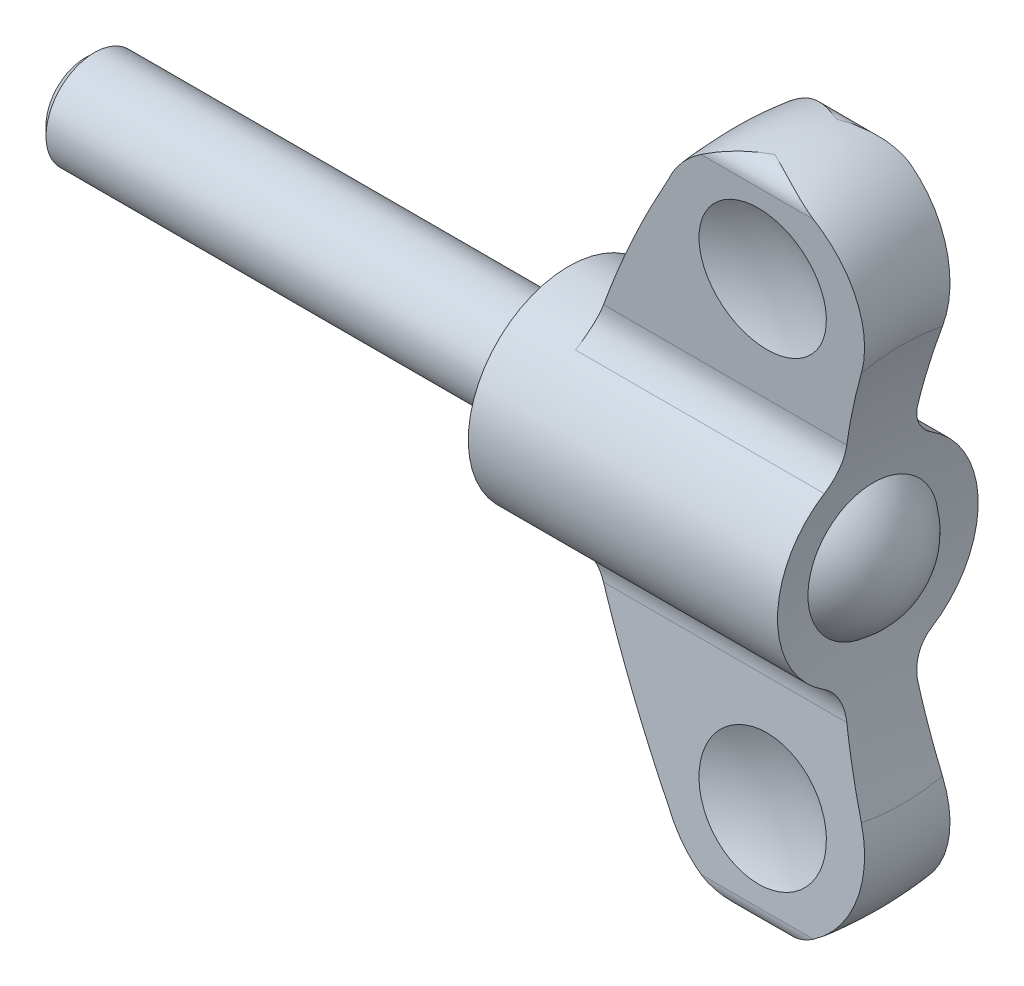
ISO-10303-21;
HEADER;
FILE_DESCRIPTION(('STEP AP214'),'2;1');
FILE_NAME('part.step','',(''),(''),'','','');
FILE_SCHEMA(('AUTOMOTIVE_DESIGN { 1 0 10303 214 1 1 1 1 }'));
ENDSEC;
DATA;
#1=APPLICATION_CONTEXT('core data for automotive mechanical design processes');
#2=APPLICATION_PROTOCOL_DEFINITION('international standard','automotive_design',2000,#1);
#3=PRODUCT_CONTEXT('',#1,'mechanical');
#4=PRODUCT('Part','Part','',(#3));
#5=PRODUCT_RELATED_PRODUCT_CATEGORY('part','',(#4));
#6=PRODUCT_DEFINITION_FORMATION('','',#4);
#7=PRODUCT_DEFINITION_CONTEXT('part definition',#1,'design');
#8=PRODUCT_DEFINITION('design','',#6,#7);
#9=PRODUCT_DEFINITION_SHAPE('','',#8);
#10=(LENGTH_UNIT() NAMED_UNIT(*) SI_UNIT(.MILLI.,.METRE.));
#11=(NAMED_UNIT(*) PLANE_ANGLE_UNIT() SI_UNIT($,.RADIAN.));
#12=(NAMED_UNIT(*) SI_UNIT($,.STERADIAN.) SOLID_ANGLE_UNIT());
#13=UNCERTAINTY_MEASURE_WITH_UNIT(LENGTH_MEASURE(1.E-05),#10,'distance_accuracy_value','');
#14=(GEOMETRIC_REPRESENTATION_CONTEXT(3) GLOBAL_UNCERTAINTY_ASSIGNED_CONTEXT((#13)) GLOBAL_UNIT_ASSIGNED_CONTEXT((#10,
#11,#12)) REPRESENTATION_CONTEXT('',''));
#15=CARTESIAN_POINT('',(0.,0.,0.));
#16=DIRECTION('',(0.,0.,1.));
#17=DIRECTION('',(1.,0.,0.));
#18=AXIS2_PLACEMENT_3D('',#15,#16,#17);
#19=CARTESIAN_POINT('',(12.0473847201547,-19.2650005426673,12.1505996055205));
#20=CARTESIAN_POINT('',(12.0473847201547,-22.6835339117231,6.7304516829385));
#21=CARTESIAN_POINT('',(12.0473847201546,-24.0714442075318,8.64382503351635E-08));
#22=CARTESIAN_POINT('',(12.0473847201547,-22.68353396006,-6.73045152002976));
#23=CARTESIAN_POINT('',(12.0473847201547,-19.2650006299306,-12.150599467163));
#24=CARTESIAN_POINT('',(7.92427844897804,-13.389468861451,8.4448518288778));
#25=CARTESIAN_POINT('',(7.92427844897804,-15.7654016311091,4.67776645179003));
#26=CARTESIAN_POINT('',(7.92427844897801,-16.7300204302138,6.00759007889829E-08));
#27=CARTESIAN_POINT('',(7.92427844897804,-15.765401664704,-4.67776633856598));
#28=CARTESIAN_POINT('',(7.92427844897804,-13.3894689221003,-8.44485173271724));
#29=CARTESIAN_POINT('',(5.,-7.02031547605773,4.42777264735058));
#30=CARTESIAN_POINT('',(5.,-8.26605552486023,2.45262874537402));
#31=CARTESIAN_POINT('',(5.,-8.77182079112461,3.14987682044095E-08));
#32=CARTESIAN_POINT('',(5.,-8.26605554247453,-2.45262868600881));
#33=CARTESIAN_POINT('',(5.,-7.02031550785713,-4.42777259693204));
#34=B_SPLINE_SURFACE_WITH_KNOTS('',2,4,((#19,#20,#21,#22,#23),(#24,#25,#26,#27,#28),(#29,#30,
#31,#32,#33)),.UNSPECIFIED.,.F.,.F.,.F.,(3,3),(5,5),(0.,1.),(0.,1.),.UNSPECIFIED.);
#35=CARTESIAN_POINT('',(5.,-7.02031547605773,4.42777264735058));
#36=CARTESIAN_POINT('',(5.,-7.07223013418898,4.34546166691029));
#37=CARTESIAN_POINT('',(5.,-7.12268879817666,4.26223276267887));
#38=CARTESIAN_POINT('',(5.,-7.22065246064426,4.09402676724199));
#39=CARTESIAN_POINT('',(5.,-7.26815672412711,4.00904924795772));
#40=CARTESIAN_POINT('',(5.,-7.36015071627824,3.83746229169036));
#41=CARTESIAN_POINT('',(5.,-7.4046400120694,3.7508526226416));
#42=CARTESIAN_POINT('',(5.,-7.4905479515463,3.57611777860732));
#43=CARTESIAN_POINT('',(5.,-7.53196642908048,3.48799252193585));
#44=CARTESIAN_POINT('',(5.,-7.61168063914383,3.31034293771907));
#45=CARTESIAN_POINT('',(5.,-7.64997643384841,3.22081863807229));
#46=CARTESIAN_POINT('',(5.,-7.72339740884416,3.04048745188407));
#47=CARTESIAN_POINT('',(5.,-7.75852283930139,2.94968066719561));
#48=CARTESIAN_POINT('',(5.,-7.82555938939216,2.76690103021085));
#49=CARTESIAN_POINT('',(5.,-7.85747090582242,2.67492832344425));
#50=CARTESIAN_POINT('',(5.,-7.91804011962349,2.48993339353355));
#51=CARTESIAN_POINT('',(5.,-7.94669831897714,2.39691133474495));
#52=CARTESIAN_POINT('',(5.,-8.00072557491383,2.20993427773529));
#53=CARTESIAN_POINT('',(5.,-8.02609519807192,2.11597944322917));
#54=CARTESIAN_POINT('',(5.,-8.07351416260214,1.9272534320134));
#55=CARTESIAN_POINT('',(5.,-8.09556409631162,1.83248240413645));
#56=CARTESIAN_POINT('',(5.,-8.13631672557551,1.64224061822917));
#57=CARTESIAN_POINT('',(5.,-8.15502000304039,1.54676998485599));
#58=CARTESIAN_POINT('',(5.,-8.1890565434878,1.35524560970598));
#59=CARTESIAN_POINT('',(5.,-8.20439034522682,1.25919196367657));
#60=CARTESIAN_POINT('',(5.,-8.23166933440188,1.06661818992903));
#61=CARTESIAN_POINT('',(5.,-8.24361498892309,0.970098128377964));
#62=CARTESIAN_POINT('',(5.,-8.26410325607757,0.776708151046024));
#63=CARTESIAN_POINT('',(5.,-8.27264624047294,0.67983827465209));
#64=CARTESIAN_POINT('',(5.,-8.28631890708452,0.485865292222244));
#65=CARTESIAN_POINT('',(5.,-8.29144884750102,0.388762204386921));
#66=CARTESIAN_POINT('',(5.,-8.29828932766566,0.194439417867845));
#67=CARTESIAN_POINT('',(5.,-8.29999999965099,0.097219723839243));
#68=CARTESIAN_POINT('',(5.,-8.30000000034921,-0.0972196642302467));
#69=CARTESIAN_POINT('',(5.,-8.29828932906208,-0.194439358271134));
#70=CARTESIAN_POINT('',(5.,-8.29144885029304,-0.388762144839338));
#71=CARTESIAN_POINT('',(5.,-8.28631891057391,-0.485865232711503));
#72=CARTESIAN_POINT('',(5.,-8.27264624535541,-0.679838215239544));
#73=CARTESIAN_POINT('',(5.,-8.26410326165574,-0.776708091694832));
#74=CARTESIAN_POINT('',(5.,-8.24361499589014,-0.970098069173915));
#75=CARTESIAN_POINT('',(5.,-8.23166934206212,-1.06661813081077));
#76=CARTESIAN_POINT('',(5.,-8.20439035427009,-1.25919190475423));
#77=CARTESIAN_POINT('',(5.,-8.18905655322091,-1.35524555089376));
#78=CARTESIAN_POINT('',(5.,-8.155020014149,-1.54676992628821));
#79=CARTESIAN_POINT('',(5.,-8.13631673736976,-1.64224055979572));
#80=CARTESIAN_POINT('',(5.,-8.09556410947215,-1.83248234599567));
#81=CARTESIAN_POINT('',(5.,-8.07351417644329,-1.92725337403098));
#82=CARTESIAN_POINT('',(5.,-8.02609521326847,-2.11597938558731));
#83=CARTESIAN_POINT('',(5.,-8.00072559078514,-2.20993422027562));
#84=CARTESIAN_POINT('',(5.,-7.94669833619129,-2.39691127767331));
#85=CARTESIAN_POINT('',(5.,-7.91804013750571,-2.48993333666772));
#86=CARTESIAN_POINT('',(5.,-7.85747092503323,-2.67492826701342));
#87=CARTESIAN_POINT('',(5.,-7.8255594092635,-2.7669009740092));
#88=CARTESIAN_POINT('',(5.,-7.75852286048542,-2.94968061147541));
#89=CARTESIAN_POINT('',(5.,-7.72339743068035,-3.04048739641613));
#90=CARTESIAN_POINT('',(5.,-7.6499764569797,-3.22081858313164));
#91=CARTESIAN_POINT('',(5.,-7.61168066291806,-3.31034288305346));
#92=CARTESIAN_POINT('',(5.,-7.53196645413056,-3.48799246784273));
#93=CARTESIAN_POINT('',(5.,-7.49054797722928,-3.57611772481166));
#94=CARTESIAN_POINT('',(5.,-7.4046400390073,-3.75085256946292));
#95=CARTESIAN_POINT('',(5.,-7.36015074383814,-3.83746223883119));
#96=CARTESIAN_POINT('',(5.,-7.26815675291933,-4.00904919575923));
#97=CARTESIAN_POINT('',(5.,-7.22065249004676,-4.09402671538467));
#98=CARTESIAN_POINT('',(5.,-7.12268882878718,-4.2622327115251));
#99=CARTESIAN_POINT('',(5.,-7.07223016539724,-4.34546161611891));
#100=CARTESIAN_POINT('',(5.,-7.02031550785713,-4.42777259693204));
#101=B_SPLINE_CURVE_WITH_KNOTS('',3,(#35,#36,#37,#38,#39,#40,#41,#42,#43,#44,#45,#46,#47,#48,
#49,#50,#51,#52,#53,#54,#55,#56,#57,#58,#59,#60,#61,#62,#63,#64,#65,#66,#67,#68,#69,#70,#71,#72,
#73,#74,#75,#76,#77,#78,#79,#80,#81,#82,#83,#84,#85,#86,#87,#88,#89,#90,#91,#92,#93,#94,#95,#96,
#97,#98,#99,#100),.UNSPECIFIED.,.F.,.F.,(4,2,2,2,2,2,2,2,2,2,2,2,2,2,2,2,2,2,2,2,2,2,2,2,2,2,2,
2,2,2,2,2,4),(0.,0.291929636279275,0.583931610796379,0.875975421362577,1.16803502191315,
1.46008880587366,1.75211952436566,2.04411414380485,2.33606364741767,2.62796278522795,
2.91980977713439,3.21160597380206,3.5033554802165,3.79506474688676,4.08674213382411,
4.37839745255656,4.67004149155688,4.9616855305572,5.25334084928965,5.545018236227,
5.83672750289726,6.12847700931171,6.42027320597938,6.71212019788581,7.00401933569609,
7.29596883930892,7.58796345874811,7.87999417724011,8.17204796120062,8.4641075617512,
8.75615137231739,9.0481533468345,9.34008298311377),.UNSPECIFIED.);
#102=CARTESIAN_POINT('',(5.,-7.02031547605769,4.42777264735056));
#103=VERTEX_POINT('',#102);
#104=CARTESIAN_POINT('',(5.00000000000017,-7.02031550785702,-4.42777259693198));
#105=VERTEX_POINT('',#104);
#106=EDGE_CURVE('E166',#103,#105,#101,.T.);
#107=CARTESIAN_POINT('',(5.,-7.02031550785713,-4.42777259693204));
#108=CARTESIAN_POINT('',(4.99999914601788,-7.03733315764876,-4.40078738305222));
#109=CARTESIAN_POINT('',(5.00025306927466,-7.05474896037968,-4.3740526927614));
#110=CARTESIAN_POINT('',(5.00127438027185,-7.09040814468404,-4.32105764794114));
#111=CARTESIAN_POINT('',(5.00204300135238,-7.10865341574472,-4.29479858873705));
#112=CARTESIAN_POINT('',(5.00410270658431,-7.14601255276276,-4.24273044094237));
#113=CARTESIAN_POINT('',(5.00539634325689,-7.16513025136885,-4.21692420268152));
#114=CARTESIAN_POINT('',(5.00851298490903,-7.20427051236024,-4.16573274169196));
#115=CARTESIAN_POINT('',(5.01033987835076,-7.22429877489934,-4.14035211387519));
#116=CARTESIAN_POINT('',(5.01453399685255,-7.26530357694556,-4.0899879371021));
#117=CARTESIAN_POINT('',(5.01690646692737,-7.28628762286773,-4.06501094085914));
#118=CARTESIAN_POINT('',(5.02214996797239,-7.32889999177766,-4.01577498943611));
#119=CARTESIAN_POINT('',(5.0250197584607,-7.35052660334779,-3.99151441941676));
#120=CARTESIAN_POINT('',(5.03118627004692,-7.39395730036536,-3.94421523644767));
#121=CARTESIAN_POINT('',(5.03447189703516,-7.41574637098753,-3.92116140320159));
#122=CARTESIAN_POINT('',(5.04146992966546,-7.45959760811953,-3.87616530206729));
#123=CARTESIAN_POINT('',(5.04517391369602,-7.48164842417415,-3.85421067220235));
#124=CARTESIAN_POINT('',(5.05300153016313,-7.5261044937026,-3.81127525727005));
#125=CARTESIAN_POINT('',(5.05711976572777,-7.54850261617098,-3.79028610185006));
#126=CARTESIAN_POINT('',(5.06577108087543,-7.59373289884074,-3.74914407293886));
#127=CARTESIAN_POINT('',(5.07030159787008,-7.61656176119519,-3.72898703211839));
#128=CARTESIAN_POINT('',(5.07977180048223,-7.66272574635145,-3.68936590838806));
#129=CARTESIAN_POINT('',(5.08471145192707,-7.68606082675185,-3.66990176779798));
#130=CARTESIAN_POINT('',(5.09495993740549,-7.7331380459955,-3.63166445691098));
#131=CARTESIAN_POINT('',(5.100268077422,-7.75687935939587,-3.61289008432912));
#132=CARTESIAN_POINT('',(5.11119882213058,-7.80450725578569,-3.5762979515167));
#133=CARTESIAN_POINT('',(5.11681637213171,-7.82838782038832,-3.55847085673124));
#134=CARTESIAN_POINT('',(5.12834953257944,-7.87628763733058,-3.52374161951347));
#135=CARTESIAN_POINT('',(5.13426073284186,-7.90030174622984,-3.5068309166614));
#136=CARTESIAN_POINT('',(5.14637050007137,-7.94847536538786,-3.4739042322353));
#137=CARTESIAN_POINT('',(5.15256534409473,-7.97263061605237,-3.45788065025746));
#138=CARTESIAN_POINT('',(5.16523076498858,-8.02108933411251,-3.42669625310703));
#139=CARTESIAN_POINT('',(5.1716982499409,-8.04538934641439,-3.41152881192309));
#140=CARTESIAN_POINT('',(5.18489763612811,-8.09413885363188,-3.38202588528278));
#141=CARTESIAN_POINT('',(5.19162700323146,-8.11858559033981,-3.36768470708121));
#142=CARTESIAN_POINT('',(5.20533880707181,-8.16762783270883,-3.33980379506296));
#143=CARTESIAN_POINT('',(5.21231919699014,-8.19222117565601,-3.3262592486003));
#144=CARTESIAN_POINT('',(5.22652179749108,-8.24155429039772,-3.29994172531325));
#145=CARTESIAN_POINT('',(5.23374237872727,-8.26629239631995,-3.2871647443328));
#146=CARTESIAN_POINT('',(5.24841400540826,-8.31591094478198,-3.26235233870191));
#147=CARTESIAN_POINT('',(5.25586377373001,-8.34079012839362,-3.25031363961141));
#148=CARTESIAN_POINT('',(5.27098295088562,-8.39068592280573,-3.22695008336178));
#149=CARTESIAN_POINT('',(5.27865137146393,-8.41570159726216,-3.21562258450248));
#150=CARTESIAN_POINT('',(5.29419316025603,-8.4658553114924,-3.19364957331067));
#151=CARTESIAN_POINT('',(5.30206572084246,-8.49099262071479,-3.18300182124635));
#152=CARTESIAN_POINT('',(5.31799244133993,-8.54132861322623,-3.16241492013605));
#153=CARTESIAN_POINT('',(5.32604540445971,-8.56652624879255,-3.15247228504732));
#154=CARTESIAN_POINT('',(5.34232479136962,-8.61697260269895,-3.13329715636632));
#155=CARTESIAN_POINT('',(5.35055010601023,-8.64222038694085,-3.12406126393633));
#156=CARTESIAN_POINT('',(5.36717027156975,-8.69277184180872,-3.10628886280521));
#157=CARTESIAN_POINT('',(5.37556424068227,-8.7180748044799,-3.09774951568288));
#158=CARTESIAN_POINT('',(5.39251807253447,-8.76874089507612,-3.08136035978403));
#159=CARTESIAN_POINT('',(5.40107725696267,-8.79410350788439,-3.07350825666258));
#160=CARTESIAN_POINT('',(5.41835781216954,-8.84489228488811,-3.05848327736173));
#161=CARTESIAN_POINT('',(5.42707868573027,-8.8703180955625,-3.05130863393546));
#162=CARTESIAN_POINT('',(5.44467893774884,-8.92123592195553,-3.03762814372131));
#163=CARTESIAN_POINT('',(5.45355797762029,-8.94672771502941,-3.03112103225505));
#164=CARTESIAN_POINT('',(5.47147088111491,-8.9977794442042,-3.0187649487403));
#165=CARTESIAN_POINT('',(5.48050454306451,-9.02333925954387,-3.01291518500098));
#166=CARTESIAN_POINT('',(5.49872301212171,-9.07452830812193,-3.0018629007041));
#167=CARTESIAN_POINT('',(5.50790773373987,-9.10015749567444,-2.99666002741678));
#168=CARTESIAN_POINT('',(5.52642465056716,-9.15148594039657,-2.98689043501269));
#169=CARTESIAN_POINT('',(5.5357568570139,-9.17718520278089,-2.98232376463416));
#170=CARTESIAN_POINT('',(5.55456504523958,-9.22865386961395,-2.9738150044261));
#171=CARTESIAN_POINT('',(5.56404111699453,-9.25442330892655,-2.96987332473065));
#172=CARTESIAN_POINT('',(5.58313342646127,-9.30603185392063,-2.96260348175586));
#173=CARTESIAN_POINT('',(5.59274981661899,-9.33187100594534,-2.95927604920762));
#174=CARTESIAN_POINT('',(5.61211879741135,-9.38361802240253,-2.95322032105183));
#175=CARTESIAN_POINT('',(5.62187158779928,-9.40952592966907,-2.95049303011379));
#176=CARTESIAN_POINT('',(5.64151069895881,-9.46140894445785,-2.94563408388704));
#177=CARTESIAN_POINT('',(5.65139725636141,-9.48738407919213,-2.94350368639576));
#178=CARTESIAN_POINT('',(5.67130839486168,-9.53943148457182,-2.93979041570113));
#179=CARTESIAN_POINT('',(5.68133335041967,-9.56550376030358,-2.9382095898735));
#180=CARTESIAN_POINT('',(5.70173003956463,-9.61823138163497,-2.93575590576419));
#181=CARTESIAN_POINT('',(5.71210447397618,-9.64488649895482,-2.93489997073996));
#182=CARTESIAN_POINT('',(5.73345196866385,-9.69939840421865,-2.93396240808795));
#183=CARTESIAN_POINT('',(5.74443050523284,-9.72725368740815,-2.93391846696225));
#184=CARTESIAN_POINT('',(5.76722513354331,-9.78474871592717,-2.93465474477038));
#185=CARTESIAN_POINT('',(5.77904862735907,-9.81438473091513,-2.93548962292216));
#186=CARTESIAN_POINT('',(5.80377672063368,-9.87602773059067,-2.938030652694));
#187=CARTESIAN_POINT('',(5.81669002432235,-9.90802857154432,-2.93980301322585));
#188=CARTESIAN_POINT('',(5.82964878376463,-9.93998155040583,-2.94193850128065));
#189=B_SPLINE_CURVE_WITH_KNOTS('',3,(#107,#108,#109,#110,#111,#112,#113,#114,#115,#116,#117,
#118,#119,#120,#121,#122,#123,#124,#125,#126,#127,#128,#129,#130,#131,#132,#133,#134,#135,#136,
#137,#138,#139,#140,#141,#142,#143,#144,#145,#146,#147,#148,#149,#150,#151,#152,#153,#154,#155,
#156,#157,#158,#159,#160,#161,#162,#163,#164,#165,#166,#167,#168,#169,#170,#171,#172,#173,#174,
#175,#176,#177,#178,#179,#180,#181,#182,#183,#184,#185,#186,#187,#188),.UNSPECIFIED.,.F.,.F.,(4,
2,2,2,2,2,2,2,2,2,2,2,2,2,2,2,2,2,2,2,2,2,2,2,2,2,2,2,2,2,2,2,2,2,2,2,2,2,2,2,4),(0.,
0.0957052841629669,0.191640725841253,0.288048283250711,0.385177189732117,0.483282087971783,
0.581145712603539,0.676801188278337,0.770792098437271,0.863687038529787,0.956039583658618,
1.04838442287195,1.14055982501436,1.23152279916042,1.32138906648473,1.41029999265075,
1.49838591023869,1.58576597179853,1.67254810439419,1.75882906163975,1.84469456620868,
1.93021953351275,2.01544636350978,2.10021726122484,2.18455084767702,2.26852154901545,
2.35220027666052,2.43565430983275,2.51894719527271,2.60213866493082,2.6852845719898,
2.76843684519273,2.85164346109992,2.93494843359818,3.01839181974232,3.10200974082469,
3.18593591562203,3.27177128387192,3.36158095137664,3.45732598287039,3.56097144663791),.UNSPECIFIED.);
#190=CARTESIAN_POINT('',(5.82953505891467,-9.94004815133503,-2.94196949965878));
#191=VERTEX_POINT('',#190);
#192=EDGE_CURVE('E182',#105,#191,#189,.T.);
#193=CARTESIAN_POINT('',(5.82964878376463,-9.93998155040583,-2.94193850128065));
#194=CARTESIAN_POINT('',(5.93431251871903,-10.1980441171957,-2.95919432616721));
#195=CARTESIAN_POINT('',(6.04020545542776,-10.4556074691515,-2.97645332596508));
#196=CARTESIAN_POINT('',(6.25787926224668,-10.978087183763,-3.01146140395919));
#197=CARTESIAN_POINT('',(6.36973965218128,-11.2429705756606,-3.02920818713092));
#198=CARTESIAN_POINT('',(6.59834558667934,-11.7772171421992,-3.06491472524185));
#199=CARTESIAN_POINT('',(6.71514438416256,-12.0465577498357,-3.08287113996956));
#200=CARTESIAN_POINT('',(6.95253699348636,-12.5868712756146,-3.11883885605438));
#201=CARTESIAN_POINT('',(7.07315745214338,-12.857832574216,-3.13684882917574));
#202=CARTESIAN_POINT('',(7.31700285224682,-13.3985835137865,-3.1727916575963));
#203=CARTESIAN_POINT('',(7.44022777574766,-13.6683731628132,-3.19072451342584));
#204=CARTESIAN_POINT('',(7.68799116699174,-14.2040260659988,-3.22638247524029));
#205=CARTESIAN_POINT('',(7.81250356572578,-14.4699013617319,-3.24410784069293));
#206=CARTESIAN_POINT('',(8.06145037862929,-14.9950243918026,-3.279188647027));
#207=CARTESIAN_POINT('',(8.18583399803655,-15.2542961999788,-3.29654421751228));
#208=CARTESIAN_POINT('',(8.43303328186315,-15.7635674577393,-3.33065120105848));
#209=CARTESIAN_POINT('',(8.55577553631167,-16.0136024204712,-3.34740447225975));
#210=CARTESIAN_POINT('',(8.80186295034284,-16.5093627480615,-3.38053403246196));
#211=CARTESIAN_POINT('',(8.92517979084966,-16.7551020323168,-3.39691239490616));
#212=CARTESIAN_POINT('',(9.17671844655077,-17.2509619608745,-3.42995608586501));
#213=CARTESIAN_POINT('',(9.30498833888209,-17.5010583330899,-3.44661968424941));
#214=CARTESIAN_POINT('',(9.56641386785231,-18.0052603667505,-3.48021206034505));
#215=CARTESIAN_POINT('',(9.69961569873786,-18.2593421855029,-3.49713920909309));
#216=CARTESIAN_POINT('',(9.97085644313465,-18.7711031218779,-3.53124985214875));
#217=CARTESIAN_POINT('',(10.1089391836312,-19.028759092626,-3.54843212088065));
#218=CARTESIAN_POINT('',(10.3898826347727,-19.5472626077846,-3.58303277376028));
#219=CARTESIAN_POINT('',(10.5327846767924,-19.8080878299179,-3.60045007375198));
#220=CARTESIAN_POINT('',(10.8232969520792,-20.3325302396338,-3.63549365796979));
#221=CARTESIAN_POINT('',(10.970945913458,-20.5961260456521,-3.65311887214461));
#222=CARTESIAN_POINT('',(11.2708709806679,-21.1257165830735,-3.68854140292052));
#223=CARTESIAN_POINT('',(11.4231831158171,-21.3916909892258,-3.70633752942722));
#224=CARTESIAN_POINT('',(11.7323415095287,-21.9256530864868,-3.7420500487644));
#225=CARTESIAN_POINT('',(11.8892210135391,-22.1936216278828,-3.75996497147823));
#226=CARTESIAN_POINT('',(12.0473847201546,-22.4608347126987,-3.77780827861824));
#227=B_SPLINE_CURVE_WITH_KNOTS('',3,(#193,#194,#195,#196,#197,#198,#199,#200,#201,#202,#203,
#204,#205,#206,#207,#208,#209,#210,#211,#212,#213,#214,#215,#216,#217,#218,#219,#220,#221,#222,
#223,#224,#225,#226),.UNSPECIFIED.,.F.,.F.,(4,2,2,2,2,2,2,2,2,2,2,2,2,2,2,2,4),(0.,
0.837036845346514,1.70126778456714,2.58362529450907,3.4750390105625,4.36644658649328,
5.24879665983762,6.11304678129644,6.95015855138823,7.77644583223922,8.62113073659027,
9.48325675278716,10.3617306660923,11.2554668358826,12.1633865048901,13.0844169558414,
14.0174905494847),.UNSPECIFIED.);
#228=CARTESIAN_POINT('',(12.0473611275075,-22.460905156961,-3.77782012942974));
#229=VERTEX_POINT('',#228);
#230=EDGE_CURVE('E194',#229,#191,#227,.F.);
#231=CARTESIAN_POINT('',(12.0473847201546,-22.4608347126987,-3.77780827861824));
#232=CARTESIAN_POINT('',(12.0473635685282,-22.513312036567,-3.46590810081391));
#233=CARTESIAN_POINT('',(12.0473450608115,-22.5592880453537,-3.15291418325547));
#234=CARTESIAN_POINT('',(12.0473133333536,-22.6381694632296,-2.52528581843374));
#235=CARTESIAN_POINT('',(12.0473001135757,-22.6710749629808,-2.21065138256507));
#236=CARTESIAN_POINT('',(12.0472789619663,-22.7237478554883,-1.58028779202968));
#237=CARTESIAN_POINT('',(12.0472710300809,-22.7435153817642,-1.26455864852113));
#238=CARTESIAN_POINT('',(12.0472604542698,-22.7698763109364,-0.632553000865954));
#239=CARTESIAN_POINT('',(12.0472578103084,-22.7764698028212,-0.316276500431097));
#240=CARTESIAN_POINT('',(12.047257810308,-22.7764698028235,0.316276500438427));
#241=CARTESIAN_POINT('',(12.0472604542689,-22.769876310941,0.632553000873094));
#242=CARTESIAN_POINT('',(12.0472710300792,-22.7435153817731,1.26455864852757));
#243=CARTESIAN_POINT('',(12.0472789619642,-22.7237478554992,1.58028779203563));
#244=CARTESIAN_POINT('',(12.0473001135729,-22.671074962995,2.21065138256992));
#245=CARTESIAN_POINT('',(12.0473133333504,-22.6381694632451,2.52528581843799));
#246=CARTESIAN_POINT('',(12.0473450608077,-22.5592880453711,3.15291418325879));
#247=CARTESIAN_POINT('',(12.0473635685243,-22.5133120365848,3.46590810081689));
#248=CARTESIAN_POINT('',(12.0473847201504,-22.4608347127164,3.7778082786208));
#249=B_SPLINE_CURVE_WITH_KNOTS('',3,(#231,#232,#233,#234,#235,#236,#237,#238,#239,#240,#241,
#242,#243,#244,#245,#246,#247,#248),.UNSPECIFIED.,.F.,.F.,(4,2,2,2,2,2,2,2,4),(0.,
0.94878347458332,1.89756036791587,2.84632761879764,3.79508846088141,4.74384930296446,
5.69261655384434,6.64139344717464,7.59017692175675),.UNSPECIFIED.);
#250=CARTESIAN_POINT('',(12.0473611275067,-22.4609051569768,3.77782012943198));
#251=VERTEX_POINT('',#250);
#252=EDGE_CURVE('E252',#251,#229,#249,.F.);
#253=CARTESIAN_POINT('',(12.0473847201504,-22.4608347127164,3.7778082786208));
#254=CARTESIAN_POINT('',(11.9361405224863,-22.2728906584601,3.7652587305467));
#255=CARTESIAN_POINT('',(11.8255317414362,-22.0845726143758,3.75267694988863));
#256=CARTESIAN_POINT('',(11.6047611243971,-21.705766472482,3.72736359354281));
#257=CARTESIAN_POINT('',(11.4946090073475,-21.5152727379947,3.71463160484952));
#258=CARTESIAN_POINT('',(11.2750357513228,-21.1325336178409,3.68905564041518));
#259=CARTESIAN_POINT('',(11.1656215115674,-20.9402842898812,3.676211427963));
#260=CARTESIAN_POINT('',(10.9477958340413,-20.5544589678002,3.65044344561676));
#261=CARTESIAN_POINT('',(10.8393883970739,-20.3608807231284,3.63751955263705));
#262=CARTESIAN_POINT('',(10.6238358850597,-19.9728289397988,3.61162179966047));
#263=CARTESIAN_POINT('',(10.5166918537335,-19.7783548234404,3.59864790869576));
#264=CARTESIAN_POINT('',(10.3039133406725,-19.3889490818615,3.57267719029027));
#265=CARTESIAN_POINT('',(10.1982769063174,-19.1940185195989,3.55968042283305));
#266=CARTESIAN_POINT('',(9.98874839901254,-18.8041439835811,3.53368945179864));
#267=CARTESIAN_POINT('',(9.88485135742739,-18.6092026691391,3.52069541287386));
#268=CARTESIAN_POINT('',(9.67902413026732,-18.2197569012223,3.49473484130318));
#269=CARTESIAN_POINT('',(9.57708595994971,-18.0252566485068,3.48176859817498));
#270=CARTESIAN_POINT('',(9.37538678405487,-17.6371492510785,3.45588911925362));
#271=CARTESIAN_POINT('',(9.2756147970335,-17.4435477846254,3.44297631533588));
#272=CARTESIAN_POINT('',(9.07844631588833,-17.0576999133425,3.41723104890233));
#273=CARTESIAN_POINT('',(8.98103588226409,-16.8654605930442,3.40439916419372));
#274=CARTESIAN_POINT('',(8.78877711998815,-16.4828043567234,3.3788460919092));
#275=CARTESIAN_POINT('',(8.69391195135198,-16.2923958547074,3.36612560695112));
#276=CARTESIAN_POINT('',(8.50691899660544,-15.9138735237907,3.34083077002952));
#277=CARTESIAN_POINT('',(8.41477154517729,-15.7257693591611,3.32825717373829));
#278=CARTESIAN_POINT('',(8.2333782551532,-15.352332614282,3.3032960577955));
#279=CARTESIAN_POINT('',(8.14411002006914,-15.1670108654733,3.29090924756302));
#280=CARTESIAN_POINT('',(7.96902128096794,-14.8004398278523,3.26643052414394));
#281=CARTESIAN_POINT('',(7.88317046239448,-14.619204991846,3.25433900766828));
#282=CARTESIAN_POINT('',(7.7156737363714,-14.2626438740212,3.23057424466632));
#283=CARTESIAN_POINT('',(7.63398689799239,-14.0873367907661,3.21890142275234));
#284=CARTESIAN_POINT('',(7.47463811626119,-13.7425541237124,3.19595545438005));
#285=CARTESIAN_POINT('',(7.39693731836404,-13.5730964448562,3.18468308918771));
#286=CARTESIAN_POINT('',(7.24536307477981,-13.2398765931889,3.16251973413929));
#287=CARTESIAN_POINT('',(7.17145308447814,-13.0761309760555,3.15162975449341));
#288=CARTESIAN_POINT('',(7.02727113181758,-12.754195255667,3.13021264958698));
#289=CARTESIAN_POINT('',(6.9569648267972,-12.5960204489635,3.11968678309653));
#290=CARTESIAN_POINT('',(6.81980873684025,-12.2850825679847,3.09897915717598));
#291=CARTESIAN_POINT('',(6.75292670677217,-12.1323336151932,3.08879892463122));
#292=CARTESIAN_POINT('',(6.62244532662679,-11.8320997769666,3.06876660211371));
#293=CARTESIAN_POINT('',(6.55881571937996,-11.6846279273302,3.05891621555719));
#294=CARTESIAN_POINT('',(6.4346891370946,-11.3948387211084,3.03952089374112));
#295=CARTESIAN_POINT('',(6.37416361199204,-11.2525334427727,3.02997820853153));
#296=CARTESIAN_POINT('',(6.25652027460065,-10.9739475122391,3.01127915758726));
#297=CARTESIAN_POINT('',(6.19937057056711,-10.8376802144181,3.00212447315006));
#298=CARTESIAN_POINT('',(6.08849168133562,-10.5714486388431,2.98424323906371));
#299=CARTESIAN_POINT('',(6.03473054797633,-10.441497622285,2.97551735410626));
#300=CARTESIAN_POINT('',(5.93045399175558,-10.1877222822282,2.95850287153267));
#301=CARTESIAN_POINT('',(5.87990875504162,-10.0639102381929,2.95021382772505));
#302=CARTESIAN_POINT('',(5.82964878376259,-9.93998155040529,2.94193850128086));
#303=B_SPLINE_CURVE_WITH_KNOTS('',3,(#253,#254,#255,#256,#257,#258,#259,#260,#261,#262,#263,
#264,#265,#266,#267,#268,#269,#270,#271,#272,#273,#274,#275,#276,#277,#278,#279,#280,#281,#282,
#283,#284,#285,#286,#287,#288,#289,#290,#291,#292,#293,#294,#295,#296,#297,#298,#299,#300,#301,
#302),.UNSPECIFIED.,.F.,.F.,(4,2,2,2,2,2,2,2,2,2,2,2,2,2,2,2,2,2,2,2,2,2,2,2,4),(0.,
0.656277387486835,1.31752191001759,1.98224689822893,2.64896913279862,3.31620820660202,
3.98248587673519,4.64632542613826,5.30625105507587,5.96078732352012,6.60845866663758,
7.24778900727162,7.87730149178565,8.49551837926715,9.09822783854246,9.67949348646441,
10.2397788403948,10.7797250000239,11.2999696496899,11.8011475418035,12.2838909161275,
12.7486971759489,13.192844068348,13.6155515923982,14.0175161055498),.UNSPECIFIED.);
#304=CARTESIAN_POINT('',(5.82953505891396,-9.94004815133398,2.94196949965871));
#305=VERTEX_POINT('',#304);
#306=EDGE_CURVE('E665',#305,#251,#303,.F.);
#307=CARTESIAN_POINT('',(5.82964878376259,-9.93998155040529,2.94193850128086));
#308=CARTESIAN_POINT('',(5.81639695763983,-9.90730538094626,2.93975717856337));
#309=CARTESIAN_POINT('',(5.80320408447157,-9.87457173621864,2.93807652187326));
#310=CARTESIAN_POINT('',(5.77694928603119,-9.80901492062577,2.93572148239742));
#311=CARTESIAN_POINT('',(5.76388736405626,-9.77619174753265,2.93504712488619));
#312=CARTESIAN_POINT('',(5.73790926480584,-9.71048569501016,2.93470974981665));
#313=CARTESIAN_POINT('',(5.7249930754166,-9.67760282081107,2.93504664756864));
#314=CARTESIAN_POINT('',(5.69932119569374,-9.61180626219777,2.93673646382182));
#315=CARTESIAN_POINT('',(5.6865654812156,-9.57889258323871,2.93808922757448));
#316=CARTESIAN_POINT('',(5.66122912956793,-9.51306223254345,2.9418151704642));
#317=CARTESIAN_POINT('',(5.64864846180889,-9.48014556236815,2.94418816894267));
#318=CARTESIAN_POINT('',(5.62367664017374,-9.41433590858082,2.94995879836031));
#319=CARTESIAN_POINT('',(5.61128545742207,-9.38144292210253,2.95335627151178));
#320=CARTESIAN_POINT('',(5.58670690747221,-9.31570610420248,2.96118008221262));
#321=CARTESIAN_POINT('',(5.57451952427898,-9.28286226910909,2.96560633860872));
#322=CARTESIAN_POINT('',(5.55036269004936,-9.21724787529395,2.97549182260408));
#323=CARTESIAN_POINT('',(5.53839325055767,-9.18447732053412,2.9809511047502));
#324=CARTESIAN_POINT('',(5.51468644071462,-9.11903236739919,2.99290773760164));
#325=CARTESIAN_POINT('',(5.50294912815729,-9.08635799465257,2.99940534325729));
#326=CARTESIAN_POINT('',(5.47971996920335,-9.02112621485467,3.01344114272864));
#327=CARTESIAN_POINT('',(5.46822824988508,-8.98856887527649,3.02097986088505));
#328=CARTESIAN_POINT('',(5.445505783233,-8.92359253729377,3.03711175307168));
#329=CARTESIAN_POINT('',(5.43427526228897,-8.89117367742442,3.04570580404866));
#330=CARTESIAN_POINT('',(5.41207335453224,-8.82646019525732,3.06392938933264));
#331=CARTESIAN_POINT('',(5.40110254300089,-8.7941659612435,3.07356099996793));
#332=CARTESIAN_POINT('',(5.37941164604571,-8.72966491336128,3.09385259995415));
#333=CARTESIAN_POINT('',(5.36869269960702,-8.69745892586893,3.10451643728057));
#334=CARTESIAN_POINT('',(5.34752878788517,-8.63315148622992,3.12694259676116));
#335=CARTESIAN_POINT('',(5.33708536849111,-8.60105126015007,3.13870990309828));
#336=CARTESIAN_POINT('',(5.31649091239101,-8.53696511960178,3.16338985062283));
#337=CARTESIAN_POINT('',(5.30634192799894,-8.50498095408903,3.17630875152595));
#338=CARTESIAN_POINT('',(5.28635576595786,-8.44113468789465,3.2033441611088));
#339=CARTESIAN_POINT('',(5.27652129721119,-8.4092750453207,3.21746848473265));
#340=CARTESIAN_POINT('',(5.25718298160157,-8.34568152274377,3.24696500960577));
#341=CARTESIAN_POINT('',(5.24768265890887,-8.31395101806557,3.2623468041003));
#342=CARTESIAN_POINT('',(5.22903126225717,-8.25061542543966,3.29440877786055));
#343=CARTESIAN_POINT('',(5.21988470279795,-8.21901486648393,3.31110053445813));
#344=CARTESIAN_POINT('',(5.20195921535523,-8.15593431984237,3.34583301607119));
#345=CARTESIAN_POINT('',(5.19318597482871,-8.12446026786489,3.36388745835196));
#346=CARTESIAN_POINT('',(5.17602507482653,-8.06162260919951,3.40139572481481));
#347=CARTESIAN_POINT('',(5.16764445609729,-8.03026659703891,3.42086549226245));
#348=CARTESIAN_POINT('',(5.15128720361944,-7.96765051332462,3.46125725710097));
#349=CARTESIAN_POINT('',(5.14331914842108,-7.93639995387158,3.48219746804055));
#350=CARTESIAN_POINT('',(5.12780671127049,-7.87398683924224,3.52556483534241));
#351=CARTESIAN_POINT('',(5.12027224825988,-7.84283550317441,3.5480116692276));
#352=CARTESIAN_POINT('',(5.105833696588,-7.78137917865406,3.59388841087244));
#353=CARTESIAN_POINT('',(5.09892649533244,-7.75107059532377,3.6173125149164));
#354=CARTESIAN_POINT('',(5.08583382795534,-7.69157191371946,3.66507060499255));
#355=CARTESIAN_POINT('',(5.07964134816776,-7.66237325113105,3.68939197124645));
#356=CARTESIAN_POINT('',(5.06792852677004,-7.60483296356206,3.73916779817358));
#357=CARTESIAN_POINT('',(5.06240800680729,-7.57649111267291,3.76462195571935));
#358=CARTESIAN_POINT('',(5.05198785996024,-7.52038808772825,3.81687019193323));
#359=CARTESIAN_POINT('',(5.04709530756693,-7.49263605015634,3.84367547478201));
#360=CARTESIAN_POINT('',(5.03794445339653,-7.43776493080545,3.89852151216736));
#361=CARTESIAN_POINT('',(5.03369222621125,-7.41065374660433,3.92657118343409));
#362=CARTESIAN_POINT('',(5.02591540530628,-7.3573952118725,3.98372728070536));
#363=CARTESIAN_POINT('',(5.02239160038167,-7.33124893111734,4.01283481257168));
#364=CARTESIAN_POINT('',(5.01608716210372,-7.27990836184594,4.07217141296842));
#365=CARTESIAN_POINT('',(5.0133097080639,-7.25471852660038,4.10240467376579));
#366=CARTESIAN_POINT('',(5.00851694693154,-7.20527936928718,4.16406888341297));
#367=CARTESIAN_POINT('',(5.00650757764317,-7.18103862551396,4.19550717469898));
#368=CARTESIAN_POINT('',(5.00326976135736,-7.13347994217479,4.25965929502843));
#369=CARTESIAN_POINT('',(5.00205027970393,-7.1101753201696,4.29238344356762));
#370=CARTESIAN_POINT('',(5.00040826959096,-7.06445925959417,4.35918628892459));
#371=CARTESIAN_POINT('',(4.99999784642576,-7.04206622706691,4.39327788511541));
#372=CARTESIAN_POINT('',(5.,-7.02031547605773,4.42777264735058));
#373=B_SPLINE_CURVE_WITH_KNOTS('',3,(#307,#308,#309,#310,#311,#312,#313,#314,#315,#316,#317,
#318,#319,#320,#321,#322,#323,#324,#325,#326,#327,#328,#329,#330,#331,#332,#333,#334,#335,#336,
#337,#338,#339,#340,#341,#342,#343,#344,#345,#346,#347,#348,#349,#350,#351,#352,#353,#354,#355,
#356,#357,#358,#359,#360,#361,#362,#363,#364,#365,#366,#367,#368,#369,#370,#371,#372),
.UNSPECIFIED.,.F.,.F.,(4,2,2,2,2,2,2,2,2,2,2,2,2,2,2,2,2,2,2,2,2,2,2,2,2,2,2,2,2,2,2,2,4),(0.,
0.105981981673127,0.21196662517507,0.317942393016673,0.423902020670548,0.529842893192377,
0.635767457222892,0.741683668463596,0.847605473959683,0.953553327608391,1.05955473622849,
1.16564483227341,1.27195132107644,1.37867059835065,1.48589753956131,1.59374773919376,
1.70235976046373,1.81189571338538,1.92254161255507,2.03450748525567,2.14802720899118,
2.26335806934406,2.3807177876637,2.49745906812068,2.61293452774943,2.72837927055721,
2.84502779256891,2.96272131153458,3.08054161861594,3.19885613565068,3.3180676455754,
3.43860955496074,3.56094174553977),.UNSPECIFIED.);
#374=EDGE_CURVE('E186',#305,#103,#373,.T.);
#375=ORIENTED_EDGE('',*,*,#106,.T.);
#376=ORIENTED_EDGE('',*,*,#192,.T.);
#377=ORIENTED_EDGE('',*,*,#230,.F.);
#378=ORIENTED_EDGE('',*,*,#252,.F.);
#379=ORIENTED_EDGE('',*,*,#306,.F.);
#380=ORIENTED_EDGE('',*,*,#374,.T.);
#381=EDGE_LOOP('',(#375,#376,#377,#378,#379,#380));
#382=FACE_BOUND('',#381,.T.);
#383=ADVANCED_FACE('F14',(#382),#34,.T.);
#384=CARTESIAN_POINT('',(19.5999999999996,0.,0.));
#385=DIRECTION('',(1.,0.,0.));
#386=DIRECTION('',(0.,0.979016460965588,-0.203781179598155));
#387=AXIS2_PLACEMENT_3D('',#384,#385,#386);
#388=TOROIDAL_SURFACE('',#387,19.1,8.4);
#389=CARTESIAN_POINT('',(27.5742128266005,16.1141790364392,3.3541480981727));
#390=CARTESIAN_POINT('',(28.1645820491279,17.9103689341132,3.47405987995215));
#391=CARTESIAN_POINT('',(28.1416130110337,19.8524469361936,3.60371100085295));
#392=CARTESIAN_POINT('',(26.893229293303,23.3244160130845,3.83549606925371));
#393=CARTESIAN_POINT('',(25.757242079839,24.784348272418,3.93295963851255));
#394=CARTESIAN_POINT('',(24.2478925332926,25.7885633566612,4.00000000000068));
#395=B_SPLINE_CURVE_WITH_KNOTS('',3,(#389,#390,#391,#392,#393,#394),.UNSPECIFIED.,.F.,.F.,(4,2,
4),(0.,0.512605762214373,1.),.UNSPECIFIED.);
#396=CARTESIAN_POINT('',(27.5742128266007,16.1141790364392,3.35414809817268));
#397=VERTEX_POINT('',#396);
#398=CARTESIAN_POINT('',(24.2478925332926,25.7885633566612,4.00000000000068));
#399=VERTEX_POINT('',#398);
#400=EDGE_CURVE('E333',#397,#399,#395,.T.);
#401=ORIENTED_EDGE('',*,*,#400,.F.);
#402=CARTESIAN_POINT('',(27.574212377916,0.,0.));
#403=DIRECTION('',(-1.,0.,0.));
#404=DIRECTION('',(0.,1.,0.));
#405=AXIS2_PLACEMENT_3D('',#402,#403,#404);
#406=CIRCLE('',#405,16.4595574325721);
#407=CARTESIAN_POINT('',(27.574212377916,16.1141776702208,-3.35414801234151));
#408=VERTEX_POINT('',#407);
#409=EDGE_CURVE('E314',#408,#397,#406,.F.);
#410=ORIENTED_EDGE('',*,*,#409,.F.);
#411=CARTESIAN_POINT('',(24.2478925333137,25.7885633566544,-4.00000000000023));
#412=CARTESIAN_POINT('',(25.8381046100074,24.7305485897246,-3.92936802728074));
#413=CARTESIAN_POINT('',(27.0176840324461,23.1635886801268,-3.8247594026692));
#414=CARTESIAN_POINT('',(28.1430697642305,19.6438808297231,-3.58978734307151));
#415=CARTESIAN_POINT('',(28.1325459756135,17.8128964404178,-3.46755271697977));
#416=CARTESIAN_POINT('',(27.5742123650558,16.1141776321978,-3.35414800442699));
#417=B_SPLINE_CURVE_WITH_KNOTS('',3,(#411,#412,#413,#414,#415,#416),.UNSPECIFIED.,.F.,.F.,(4,2,
4),(0.,0.516108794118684,1.),.UNSPECIFIED.);
#418=CARTESIAN_POINT('',(24.2478925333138,25.7885633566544,-4.));
#419=VERTEX_POINT('',#418);
#420=EDGE_CURVE('E329',#419,#408,#417,.T.);
#421=ORIENTED_EDGE('',*,*,#420,.F.);
#422=CARTESIAN_POINT('',(19.6,27.3816792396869,-2.54826254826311));
#423=CARTESIAN_POINT('',(19.6902252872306,27.3779168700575,-2.58865683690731));
#424=CARTESIAN_POINT('',(19.7804692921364,27.3726278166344,-2.62886832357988));
#425=CARTESIAN_POINT('',(19.9644609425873,27.3587398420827,-2.71035961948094));
#426=CARTESIAN_POINT('',(20.0582080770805,27.3500199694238,-2.75161999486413));
#427=CARTESIAN_POINT('',(20.2486436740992,27.3289710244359,-2.83478941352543));
#428=CARTESIAN_POINT('',(20.3453298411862,27.31653496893,-2.87667668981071));
#429=CARTESIAN_POINT('',(20.5410836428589,27.2878029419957,-2.9606244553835));
#430=CARTESIAN_POINT('',(20.6401479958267,27.2714152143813,-3.00266125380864));
#431=CARTESIAN_POINT('',(20.8400967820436,27.2345918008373,-3.08639305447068));
#432=CARTESIAN_POINT('',(20.9409774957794,27.2140809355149,-3.12806394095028));
#433=CARTESIAN_POINT('',(21.1439973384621,27.1688929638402,-3.21051399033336));
#434=CARTESIAN_POINT('',(21.2461328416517,27.1441583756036,-3.25127064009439));
#435=CARTESIAN_POINT('',(21.4511000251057,27.090482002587,-3.331317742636));
#436=CARTESIAN_POINT('',(21.5539286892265,27.0615012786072,-3.37058986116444));
#437=CARTESIAN_POINT('',(21.7597194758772,26.9993744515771,-3.44707980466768));
#438=CARTESIAN_POINT('',(21.8626797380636,26.9662084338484,-3.48428649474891));
#439=CARTESIAN_POINT('',(22.0681704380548,26.8958392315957,-3.55605639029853));
#440=CARTESIAN_POINT('',(22.1707007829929,26.8586352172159,-3.59061904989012));
#441=CARTESIAN_POINT('',(22.3747678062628,26.780405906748,-3.65652398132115));
#442=CARTESIAN_POINT('',(22.4763068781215,26.73939846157,-3.68787997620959));
#443=CARTESIAN_POINT('',(22.6778265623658,26.6538648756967,-3.74682076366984));
#444=CARTESIAN_POINT('',(22.777812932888,26.6093743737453,-3.77443744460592));
#445=CARTESIAN_POINT('',(22.9756623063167,26.5172596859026,-3.8253888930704));
#446=CARTESIAN_POINT('',(23.0735355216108,26.4696875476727,-3.84877775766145));
#447=CARTESIAN_POINT('',(23.2665896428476,26.3718728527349,-3.89081548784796));
#448=CARTESIAN_POINT('',(23.3617866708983,26.3216968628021,-3.90954480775));
#449=CARTESIAN_POINT('',(23.5489285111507,26.2191995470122,-3.94187283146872));
#450=CARTESIAN_POINT('',(23.640896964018,26.1669571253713,-3.95558249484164));
#451=CARTESIAN_POINT('',(23.7769793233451,26.0868374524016,-3.97218160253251));
#452=CARTESIAN_POINT('',(23.8215557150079,26.0601362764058,-3.97702193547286));
#453=CARTESIAN_POINT('',(23.9096839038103,26.0064334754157,-3.98532619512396));
#454=CARTESIAN_POINT('',(23.9532407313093,25.9794433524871,-3.98881075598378));
#455=CARTESIAN_POINT('',(24.0392577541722,25.9252438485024,-3.99438014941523));
#456=CARTESIAN_POINT('',(24.0817238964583,25.8980463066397,-3.99648811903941));
#457=CARTESIAN_POINT('',(24.1654870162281,25.843514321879,-3.99928437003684));
#458=CARTESIAN_POINT('',(24.2067910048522,25.8161919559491,-3.99999846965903));
#459=CARTESIAN_POINT('',(24.2478925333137,25.7885633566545,-4.));
#460=B_SPLINE_CURVE_WITH_KNOTS('',3,(#422,#423,#424,#425,#426,#427,#428,#429,#430,#431,#432,
#433,#434,#435,#436,#437,#438,#439,#440,#441,#442,#443,#444,#445,#446,#447,#448,#449,#450,#451,
#452,#453,#454,#455,#456,#457,#458,#459),.UNSPECIFIED.,.F.,.F.,(4,2,2,2,2,2,2,2,2,2,2,2,2,2,2,2,
2,2,4),(0.,0.296768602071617,0.605102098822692,0.923344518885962,1.24984194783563,
1.58294402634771,1.92100543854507,2.26238749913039,2.60545994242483,2.94860302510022,
3.29021007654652,3.62869066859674,3.96247463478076,4.29001725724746,4.60980607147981,
4.76634728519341,4.92040295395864,5.07179771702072,5.22036058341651),.UNSPECIFIED.);
#461=CARTESIAN_POINT('',(19.5999999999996,27.3816792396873,-2.54826254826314));
#462=VERTEX_POINT('',#461);
#463=EDGE_CURVE('E337',#462,#419,#460,.T.);
#464=ORIENTED_EDGE('',*,*,#463,.F.);
#465=CARTESIAN_POINT('',(14.9521074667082,25.7885633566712,-4.));
#466=CARTESIAN_POINT('',(14.9931474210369,25.8161505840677,-3.99999848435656));
#467=CARTESIAN_POINT('',(15.0343891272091,25.8434326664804,-3.99928651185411));
#468=CARTESIAN_POINT('',(15.1180222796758,25.8978834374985,-3.99649854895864));
#469=CARTESIAN_POINT('',(15.1604206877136,25.9250401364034,-3.99439691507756));
#470=CARTESIAN_POINT('',(15.2462977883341,25.9791579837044,-3.98884428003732));
#471=CARTESIAN_POINT('',(15.2897823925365,26.0061073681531,-3.98537028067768));
#472=CARTESIAN_POINT('',(15.377762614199,26.0597294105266,-3.97709120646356));
#473=CARTESIAN_POINT('',(15.4222632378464,26.0863906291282,-3.97226560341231));
#474=CARTESIAN_POINT('',(15.55811240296,26.1663914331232,-3.95571697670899));
#475=CARTESIAN_POINT('',(15.6499223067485,26.218558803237,-3.94204885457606));
#476=CARTESIAN_POINT('',(15.8367442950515,26.3209163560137,-3.90981731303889));
#477=CARTESIAN_POINT('',(15.9317800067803,26.3710277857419,-3.89114309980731));
#478=CARTESIAN_POINT('',(16.1245161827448,26.4687280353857,-3.84922571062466));
#479=CARTESIAN_POINT('',(16.22223282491,26.5162501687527,-3.82590188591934));
#480=CARTESIAN_POINT('',(16.4197812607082,26.6082828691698,-3.77508619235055));
#481=CARTESIAN_POINT('',(16.5196233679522,26.6527409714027,-3.74753974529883));
#482=CARTESIAN_POINT('',(16.7208742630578,26.7382299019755,-3.6887397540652));
#483=CARTESIAN_POINT('',(16.8222889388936,26.7792243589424,-3.65745362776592));
#484=CARTESIAN_POINT('',(17.0261344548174,26.8574485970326,-3.59168281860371));
#485=CARTESIAN_POINT('',(17.1285678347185,26.894659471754,-3.5571835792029));
#486=CARTESIAN_POINT('',(17.3338994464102,26.9650626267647,-3.48552868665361));
#487=CARTESIAN_POINT('',(17.4367977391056,26.9982543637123,-3.44837267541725));
#488=CARTESIAN_POINT('',(17.6425069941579,27.0604507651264,-3.37196606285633));
#489=CARTESIAN_POINT('',(17.7453162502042,27.0894736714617,-3.33272568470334));
#490=CARTESIAN_POINT('',(17.9502945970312,27.1432491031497,-3.25271817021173));
#491=CARTESIAN_POINT('',(18.0524608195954,27.1680386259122,-3.21196850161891));
#492=CARTESIAN_POINT('',(18.2555996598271,27.2133465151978,-3.12950323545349));
#493=CARTESIAN_POINT('',(18.3565687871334,27.2339201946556,-3.08780936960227));
#494=CARTESIAN_POINT('',(18.5567595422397,27.2708736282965,-3.0039979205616));
#495=CARTESIAN_POINT('',(18.655977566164,27.2873262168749,-2.96190378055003));
#496=CARTESIAN_POINT('',(18.8521114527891,27.3161859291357,-2.87780408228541));
#497=CARTESIAN_POINT('',(18.9490241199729,27.3286823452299,-2.83582165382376));
#498=CARTESIAN_POINT('',(19.1399930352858,27.3498430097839,-2.75242205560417));
#499=CARTESIAN_POINT('',(19.2340470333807,27.358611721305,-2.71102618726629));
#500=CARTESIAN_POINT('',(19.4187404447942,27.3725812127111,-2.62922269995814));
#501=CARTESIAN_POINT('',(19.509379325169,27.3779004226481,-2.58883407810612));
#502=CARTESIAN_POINT('',(19.6,27.3816792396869,-2.54826254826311));
#503=B_SPLINE_CURVE_WITH_KNOTS('',3,(#465,#466,#467,#468,#469,#470,#471,#472,#473,#474,#475,
#476,#477,#478,#479,#480,#481,#482,#483,#484,#485,#486,#487,#488,#489,#490,#491,#492,#493,#494,
#495,#496,#497,#498,#499,#500,#501,#502),.UNSPECIFIED.,.F.,.F.,(4,2,2,2,2,2,2,2,2,2,2,2,2,2,2,2,
2,2,4),(0.,0.148340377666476,0.299497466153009,0.453303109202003,0.609584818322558,
0.928837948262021,1.25584206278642,1.58910842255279,1.92711619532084,2.26831920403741,
2.61115107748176,2.95402924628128,3.29535809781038,3.63353151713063,3.96693498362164,
4.29394735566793,4.61294245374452,4.92229054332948,5.2203598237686),.UNSPECIFIED.);
#504=CARTESIAN_POINT('',(14.9521074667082,25.7885633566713,-4.));
#505=VERTEX_POINT('',#504);
#506=EDGE_CURVE('E397',#505,#462,#503,.T.);
#507=ORIENTED_EDGE('',*,*,#506,.F.);
#508=CARTESIAN_POINT('',(12.0473847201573,22.4611894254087,-3.77786795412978));
#509=CARTESIAN_POINT('',(12.6976353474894,23.8006511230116,-3.86728903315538));
#510=CARTESIAN_POINT('',(13.6928949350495,24.9507722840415,-3.9440699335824));
#511=CARTESIAN_POINT('',(14.9521074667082,25.7885633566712,-4.00000000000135));
#512=B_SPLINE_CURVE_WITH_KNOTS('',3,(#508,#509,#510,#511),.UNSPECIFIED.,.F.,.F.,(4,4),(0.,1.),.UNSPECIFIED.);
#513=CARTESIAN_POINT('',(12.0473847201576,22.4610711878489,-3.77784806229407));
#514=VERTEX_POINT('',#513);
#515=EDGE_CURVE('E373',#514,#505,#512,.T.);
#516=ORIENTED_EDGE('',*,*,#515,.F.);
#517=CARTESIAN_POINT('',(12.0473057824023,22.4607035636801,3.77778621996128));
#518=CARTESIAN_POINT('',(12.047287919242,22.5131860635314,3.46588866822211));
#519=CARTESIAN_POINT('',(12.047272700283,22.5591673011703,3.15289726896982));
#520=CARTESIAN_POINT('',(12.0472475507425,22.6380593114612,2.5252734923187));
#521=CARTESIAN_POINT('',(12.047237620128,22.6709701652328,2.21064112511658));
#522=CARTESIAN_POINT('',(12.0472230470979,22.7236538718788,1.58028121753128));
#523=CARTESIAN_POINT('',(12.0472184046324,22.7434268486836,1.26455368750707));
#524=CARTESIAN_POINT('',(12.0472144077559,22.7697987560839,0.632550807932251));
#525=CARTESIAN_POINT('',(12.0472150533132,22.7763977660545,0.316275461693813));
#526=CARTESIAN_POINT('',(12.0472216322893,22.7764088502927,-0.316275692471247));
#527=CARTESIAN_POINT('',(12.047227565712,22.7698209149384,-0.632551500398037));
#528=CARTESIAN_POINT('',(12.0472447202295,22.7434711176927,-1.26455622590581));
#529=CARTESIAN_POINT('',(12.0472559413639,22.7237091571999,-1.58028513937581));
#530=CARTESIAN_POINT('',(12.0472836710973,22.6710473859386,-2.21064873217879));
#531=CARTESIAN_POINT('',(12.0473001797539,22.6381474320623,-2.52528339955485));
#532=CARTESIAN_POINT('',(12.0473384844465,22.5592770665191,-3.15291268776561));
#533=CARTESIAN_POINT('',(12.047360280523,22.5133065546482,-3.46590729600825));
#534=CARTESIAN_POINT('',(12.0473847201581,22.4608347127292,-3.77780827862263));
#535=B_SPLINE_CURVE_WITH_KNOTS('',3,(#517,#518,#519,#520,#521,#522,#523,#524,#525,#526,#527,
#528,#529,#530,#531,#532,#533,#534),.UNSPECIFIED.,.F.,.F.,(4,2,2,2,2,2,2,2,4),(0.,
0.948778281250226,1.89755067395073,2.84631411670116,3.79507184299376,4.7438302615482,
5.69259578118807,6.64137163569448,7.59015476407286),.UNSPECIFIED.);
#536=CARTESIAN_POINT('',(12.0473112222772,22.4609318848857,3.7778246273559));
#537=VERTEX_POINT('',#536);
#538=EDGE_CURVE('E407',#514,#537,#535,.F.);
#539=ORIENTED_EDGE('',*,*,#538,.T.);
#540=CARTESIAN_POINT('',(14.9521074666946,25.7885633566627,4.00000000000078));
#541=CARTESIAN_POINT('',(13.7109095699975,24.9627039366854,3.94486647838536));
#542=CARTESIAN_POINT('',(12.7071127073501,23.8200594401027,3.86858471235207));
#543=CARTESIAN_POINT('',(12.0473847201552,22.4610108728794,3.7778560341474));
#544=B_SPLINE_CURVE_WITH_KNOTS('',3,(#540,#541,#542,#543),.UNSPECIFIED.,.F.,.F.,(4,4),(0.,1.),.UNSPECIFIED.);
#545=CARTESIAN_POINT('',(14.9521074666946,25.7885633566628,4.00000000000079));
#546=VERTEX_POINT('',#545);
#547=EDGE_CURVE('E409',#546,#537,#544,.T.);
#548=ORIENTED_EDGE('',*,*,#547,.F.);
#549=CARTESIAN_POINT('',(19.6,27.3816792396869,2.5482625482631));
#550=CARTESIAN_POINT('',(19.5097747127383,27.3779168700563,2.58865683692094));
#551=CARTESIAN_POINT('',(19.4195307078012,27.3726278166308,2.62886832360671));
#552=CARTESIAN_POINT('',(19.2355390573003,27.3587398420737,2.71035961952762));
#553=CARTESIAN_POINT('',(19.1417919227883,27.3500199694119,2.7516199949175));
#554=CARTESIAN_POINT('',(18.9513563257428,27.3289710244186,2.83478941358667));
#555=CARTESIAN_POINT('',(18.8546701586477,27.3165349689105,2.87667668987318));
#556=CARTESIAN_POINT('',(18.658916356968,27.287802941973,2.9606244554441));
#557=CARTESIAN_POINT('',(18.559852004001,27.2714152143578,3.00266125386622));
#558=CARTESIAN_POINT('',(18.3599032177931,27.2345918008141,3.08639305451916));
#559=CARTESIAN_POINT('',(18.2590225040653,27.214080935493,3.12806394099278));
#560=CARTESIAN_POINT('',(18.0560026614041,27.168892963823,3.21051399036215));
#561=CARTESIAN_POINT('',(17.9538671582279,27.14415837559,3.25127064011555));
#562=CARTESIAN_POINT('',(17.7488999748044,27.0904820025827,3.33131774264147));
#563=CARTESIAN_POINT('',(17.6460713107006,27.0615012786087,3.37058986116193));
#564=CARTESIAN_POINT('',(17.4402805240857,26.999374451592,3.44707980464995));
#565=CARTESIAN_POINT('',(17.3373202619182,26.9662084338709,3.484286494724));
#566=CARTESIAN_POINT('',(17.1318295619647,26.8958392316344,3.556056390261));
#567=CARTESIAN_POINT('',(17.0292992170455,26.8586352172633,3.59061904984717));
#568=CARTESIAN_POINT('',(16.8252321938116,26.7804059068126,3.65652398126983));
#569=CARTESIAN_POINT('',(16.72369312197,26.7393984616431,3.68787997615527));
#570=CARTESIAN_POINT('',(16.5221734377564,26.6538648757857,3.74682076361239));
#571=CARTESIAN_POINT('',(16.4221870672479,26.6093743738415,3.7744374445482));
#572=CARTESIAN_POINT('',(16.2243376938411,26.5172596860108,3.82538889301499));
#573=CARTESIAN_POINT('',(16.1264644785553,26.4696875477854,3.84877775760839));
#574=CARTESIAN_POINT('',(15.933410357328,26.3718728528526,3.89081548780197));
#575=CARTESIAN_POINT('',(15.8382133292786,26.32169686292,3.9095448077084));
#576=CARTESIAN_POINT('',(15.6510714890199,26.2191995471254,3.94187283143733));
#577=CARTESIAN_POINT('',(15.559103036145,26.1669571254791,3.95558249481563));
#578=CARTESIAN_POINT('',(15.4230206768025,26.086837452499,3.97218160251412));
#579=CARTESIAN_POINT('',(15.378444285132,26.0601362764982,3.97702193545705));
#580=CARTESIAN_POINT('',(15.2903160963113,26.0064334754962,3.98532619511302));
#581=CARTESIAN_POINT('',(15.2467592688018,25.9794433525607,3.98881075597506));
#582=CARTESIAN_POINT('',(15.1607422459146,25.9252438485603,3.99438014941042));
#583=CARTESIAN_POINT('',(15.1182761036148,25.8980463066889,3.99648811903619));
#584=CARTESIAN_POINT('',(15.0345129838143,25.8435143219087,3.999284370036));
#585=CARTESIAN_POINT('',(14.9932089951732,25.8161919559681,3.99999846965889));
#586=CARTESIAN_POINT('',(14.9521074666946,25.7885633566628,4.));
#587=B_SPLINE_CURVE_WITH_KNOTS('',3,(#549,#550,#551,#552,#553,#554,#555,#556,#557,#558,#559,
#560,#561,#562,#563,#564,#565,#566,#567,#568,#569,#570,#571,#572,#573,#574,#575,#576,#577,#578,
#579,#580,#581,#582,#583,#584,#585,#586),.UNSPECIFIED.,.F.,.F.,(4,2,2,2,2,2,2,2,2,2,2,2,2,2,2,2,
2,2,4),(0.,0.296768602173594,0.60510209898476,0.923344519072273,1.24984194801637,
1.5829440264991,1.92100543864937,2.26238749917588,2.60545994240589,2.94860302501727,
3.29021007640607,3.62869066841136,3.96247463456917,4.29001725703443,4.60980607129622,
4.76634728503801,4.92040295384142,5.0717977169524,5.22036058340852),.UNSPECIFIED.);
#588=CARTESIAN_POINT('',(19.5999999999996,27.3816792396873,2.54826254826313));
#589=VERTEX_POINT('',#588);
#590=EDGE_CURVE('E413',#589,#546,#587,.T.);
#591=ORIENTED_EDGE('',*,*,#590,.F.);
#592=CARTESIAN_POINT('',(24.2478925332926,25.7885633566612,4.));
#593=CARTESIAN_POINT('',(24.2068525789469,25.8161505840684,3.99999848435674));
#594=CARTESIAN_POINT('',(24.1656108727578,25.843432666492,3.9992865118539));
#595=CARTESIAN_POINT('',(24.0819777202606,25.8978834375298,3.99649854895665));
#596=CARTESIAN_POINT('',(24.0395793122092,25.9250401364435,3.99439691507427));
#597=CARTESIAN_POINT('',(23.9537022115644,25.9791579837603,3.98884428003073));
#598=CARTESIAN_POINT('',(23.9102176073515,26.0061073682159,3.98537028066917));
#599=CARTESIAN_POINT('',(23.8222373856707,26.0597294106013,3.9770912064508));
#600=CARTESIAN_POINT('',(23.7777367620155,26.086390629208,3.97226560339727));
#601=CARTESIAN_POINT('',(23.6418875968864,26.1663914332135,3.95571697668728));
#602=CARTESIAN_POINT('',(23.5500776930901,26.2185588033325,3.94204885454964));
#603=CARTESIAN_POINT('',(23.3632557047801,26.3209163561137,3.90981731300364));
#604=CARTESIAN_POINT('',(23.2682199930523,26.3710277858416,3.8911430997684));
#605=CARTESIAN_POINT('',(23.0754838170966,26.4687280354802,3.84922571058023));
#606=CARTESIAN_POINT('',(22.9777671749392,26.5162501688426,3.82590188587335));
#607=CARTESIAN_POINT('',(22.780218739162,26.6082828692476,3.77508619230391));
#608=CARTESIAN_POINT('',(22.6803766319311,26.6527409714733,3.74753974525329));
#609=CARTESIAN_POINT('',(22.4791257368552,26.7382299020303,3.68873975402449));
#610=CARTESIAN_POINT('',(22.377711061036,26.7792243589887,3.65745362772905));
#611=CARTESIAN_POINT('',(22.1738655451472,26.8574485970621,3.59168281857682));
#612=CARTESIAN_POINT('',(22.0714321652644,26.8946594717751,3.55718357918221));
#613=CARTESIAN_POINT('',(21.8661005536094,26.9650626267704,3.48552868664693));
#614=CARTESIAN_POINT('',(21.7632022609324,26.9982543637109,3.44837267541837));
#615=CARTESIAN_POINT('',(21.5574930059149,27.0604507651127,3.37196606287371));
#616=CARTESIAN_POINT('',(21.4546837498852,27.0894736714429,3.33272568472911));
#617=CARTESIAN_POINT('',(21.2497054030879,27.1432491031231,3.25271817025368));
#618=CARTESIAN_POINT('',(21.1475391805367,27.1680386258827,3.21196850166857));
#619=CARTESIAN_POINT('',(20.9444003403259,27.2133465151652,3.12950323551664));
#620=CARTESIAN_POINT('',(20.8434312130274,27.2339201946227,3.0878093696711));
#621=CARTESIAN_POINT('',(20.6432404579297,27.2708736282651,3.00399792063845));
#622=CARTESIAN_POINT('',(20.5440224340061,27.2873262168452,2.96190378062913));
#623=CARTESIAN_POINT('',(20.3478885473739,27.3161859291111,2.87780408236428));
#624=CARTESIAN_POINT('',(20.2509758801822,27.3286823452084,2.83582165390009));
#625=CARTESIAN_POINT('',(20.0600069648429,27.3498430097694,2.7524220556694));
#626=CARTESIAN_POINT('',(19.9659529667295,27.3586117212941,2.71102618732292));
#627=CARTESIAN_POINT('',(19.7812595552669,27.3725812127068,2.62922269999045));
#628=CARTESIAN_POINT('',(19.6906206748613,27.3779004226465,2.58883407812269));
#629=CARTESIAN_POINT('',(19.6,27.3816792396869,2.5482625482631));
#630=B_SPLINE_CURVE_WITH_KNOTS('',3,(#592,#593,#594,#595,#596,#597,#598,#599,#600,#601,#602,
#603,#604,#605,#606,#607,#608,#609,#610,#611,#612,#613,#614,#615,#616,#617,#618,#619,#620,#621,
#622,#623,#624,#625,#626,#627,#628,#629),.UNSPECIFIED.,.F.,.F.,(4,2,2,2,2,2,2,2,2,2,2,2,2,2,2,2,
2,2,4),(0.,0.14834037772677,0.299497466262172,0.453303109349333,0.609584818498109,
0.928837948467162,1.25584206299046,1.58910842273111,1.92711619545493,2.26831920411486,
2.61115107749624,2.95402924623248,3.29535809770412,3.63353151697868,3.96693498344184,
4.29394735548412,4.61294245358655,4.92229054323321,5.22035982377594),.UNSPECIFIED.);
#631=EDGE_CURVE('E419',#399,#589,#630,.T.);
#632=ORIENTED_EDGE('',*,*,#631,.F.);
#633=EDGE_LOOP('',(#401,#410,#421,#464,#507,#516,#539,#548,#591,#632));
#634=FACE_BOUND('',#633,.T.);
#635=ADVANCED_FACE('F328',(#634),#388,.T.);
#636=CARTESIAN_POINT('',(0.,-8.52678884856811,8.3));
#637=DIRECTION('',(-1.,0.,0.));
#638=DIRECTION('',(0.,1.,0.));
#639=AXIS2_PLACEMENT_3D('',#636,#637,#638);
#640=PLANE('',#639);
#641=CARTESIAN_POINT('',(0.,0.,0.));
#642=DIRECTION('',(-1.,0.,0.));
#643=DIRECTION('',(0.,0.,-1.));
#644=AXIS2_PLACEMENT_3D('',#641,#642,#643);
#645=CIRCLE('',#644,8.3);
#646=CARTESIAN_POINT('',(0.,0.,-8.3));
#647=VERTEX_POINT('',#646);
#648=EDGE_CURVE('E423',#647,#647,#645,.F.);
#649=ORIENTED_EDGE('',*,*,#648,.F.);
#650=EDGE_LOOP('',(#649));
#651=FACE_BOUND('',#650,.T.);
#652=CARTESIAN_POINT('',(0.,0.,0.));
#653=DIRECTION('',(1.,0.,0.));
#654=DIRECTION('',(0.,0.,1.));
#655=AXIS2_PLACEMENT_3D('',#652,#653,#654);
#656=CIRCLE('',#655,4.);
#657=CARTESIAN_POINT('',(0.,0.,4.));
#658=VERTEX_POINT('',#657);
#659=EDGE_CURVE('E426',#658,#658,#656,.F.);
#660=ORIENTED_EDGE('',*,*,#659,.F.);
#661=EDGE_LOOP('',(#660));
#662=FACE_BOUND('',#661,.T.);
#663=ADVANCED_FACE('F460',(#651,#662),#640,.T.);
#664=CARTESIAN_POINT('',(12.0473847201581,19.2650005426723,-12.1505996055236));
#665=CARTESIAN_POINT('',(12.0473847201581,22.683533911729,-6.73045168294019));
#666=CARTESIAN_POINT('',(12.0473847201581,24.071444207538,-8.64382148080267E-08));
#667=CARTESIAN_POINT('',(12.0473847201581,22.6835339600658,6.73045152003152));
#668=CARTESIAN_POINT('',(12.0473847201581,19.2650006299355,12.1505994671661));
#669=CARTESIAN_POINT('',(7.92427844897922,13.3894688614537,-8.44485182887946));
#670=CARTESIAN_POINT('',(7.92427844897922,15.7654016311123,-4.67776645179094));
#671=CARTESIAN_POINT('',(7.92427844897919,16.7300204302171,-6.00758760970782E-08));
#672=CARTESIAN_POINT('',(7.92427844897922,15.7654016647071,4.67776633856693));
#673=CARTESIAN_POINT('',(7.92427844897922,13.389468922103,8.44485173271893));
#674=CARTESIAN_POINT('',(4.99999999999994,7.02031547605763,-4.42777264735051));
#675=CARTESIAN_POINT('',(4.99999999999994,8.26605552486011,-2.45262874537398));
#676=CARTESIAN_POINT('',(4.99999999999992,8.77182079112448,-3.1498755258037E-08));
#677=CARTESIAN_POINT('',(4.99999999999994,8.26605554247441,2.45262868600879));
#678=CARTESIAN_POINT('',(4.99999999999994,7.02031550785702,4.42777259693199));
#679=B_SPLINE_SURFACE_WITH_KNOTS('',2,4,((#664,#665,#666,#667,#668),(#669,#670,#671,#672,#673),
(#674,#675,#676,#677,#678)),.UNSPECIFIED.,.F.,.F.,.F.,(3,3),(5,5),(0.,1.),(0.,1.),.UNSPECIFIED.);
#680=CARTESIAN_POINT('',(12.0473847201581,22.4608347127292,-3.77780827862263));
#681=CARTESIAN_POINT('',(11.9361403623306,22.2728903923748,-3.76525868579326));
#682=CARTESIAN_POINT('',(11.8255314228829,22.0845720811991,-3.75267685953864));
#683=CARTESIAN_POINT('',(11.6047604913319,21.7057654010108,-3.72736340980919));
#684=CARTESIAN_POINT('',(11.4946082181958,21.5152713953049,-3.7146313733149));
#685=CARTESIAN_POINT('',(11.275034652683,21.1325317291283,-3.68905531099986));
#686=CARTESIAN_POINT('',(11.1656202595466,20.9402821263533,-3.67621104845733));
#687=CARTESIAN_POINT('',(10.9477942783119,20.554456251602,-3.65044296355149));
#688=CARTESIAN_POINT('',(10.83938669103,20.3608777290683,-3.63751901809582));
#689=CARTESIAN_POINT('',(10.6238338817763,19.9728253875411,-3.61162115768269));
#690=CARTESIAN_POINT('',(10.5166897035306,19.7783509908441,-3.59864721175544));
#691=CARTESIAN_POINT('',(10.3039109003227,19.3889446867,-3.57267638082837));
#692=CARTESIAN_POINT('',(10.1982743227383,19.1940138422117,-3.55967955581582));
#693=CARTESIAN_POINT('',(9.98874553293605,18.8041387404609,-3.5336884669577));
#694=CARTESIAN_POINT('',(9.88484835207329,18.6091971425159,-3.52069436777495));
#695=CARTESIAN_POINT('',(9.67902085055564,18.2197508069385,-3.4947336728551));
#696=CARTESIAN_POINT('',(9.5770825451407,18.0252502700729,-3.48176736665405));
#697=CARTESIAN_POINT('',(9.37538310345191,17.6371423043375,-3.45588775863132));
#698=CARTESIAN_POINT('',(9.27561098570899,17.4435405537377,-3.44297488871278));
#699=CARTESIAN_POINT('',(9.07844224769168,17.0576921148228,-3.41722948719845));
#700=CARTESIAN_POINT('',(8.98103168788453,16.8654525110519,-3.40439753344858));
#701=CARTESIAN_POINT('',(8.78877267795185,16.4827957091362,-3.37884431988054));
#702=CARTESIAN_POINT('',(8.6939073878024,16.2923869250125,-3.36612376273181));
#703=CARTESIAN_POINT('',(8.50691419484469,15.9138640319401,-3.34082877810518));
#704=CARTESIAN_POINT('',(8.41476662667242,15.7257595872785,-3.32825510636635));
#705=CARTESIAN_POINT('',(8.23337310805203,15.3523222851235,-3.30329383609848));
#706=CARTESIAN_POINT('',(8.14410476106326,15.1670002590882,-3.29090694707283));
#707=CARTESIAN_POINT('',(7.96901580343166,14.8004286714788,-3.26642806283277));
#708=CARTESIAN_POINT('',(7.88316487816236,14.619193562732,-3.25433646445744));
#709=CARTESIAN_POINT('',(7.71566794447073,14.2626319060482,-3.23057153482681));
#710=CARTESIAN_POINT('',(7.63398100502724,14.087324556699,-3.21889862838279));
#711=CARTESIAN_POINT('',(7.47463202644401,13.7425413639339,-3.19595248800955));
#712=CARTESIAN_POINT('',(7.39693113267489,13.5730834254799,-3.18468003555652));
#713=CARTESIAN_POINT('',(7.24535670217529,13.2398630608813,-3.16251650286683));
#714=CARTESIAN_POINT('',(7.17144662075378,13.076117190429,-3.15162643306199));
#715=CARTESIAN_POINT('',(7.02726449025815,12.7541809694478,-3.13020914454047));
#716=CARTESIAN_POINT('',(6.95695809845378,12.5960059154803,-3.11968318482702));
#717=CARTESIAN_POINT('',(6.81980183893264,12.2850675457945,-3.09897536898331));
#718=CARTESIAN_POINT('',(6.75291972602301,12.1323183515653,-3.08879503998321));
#719=CARTESIAN_POINT('',(6.62243818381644,11.8320840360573,-3.06876252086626));
#720=CARTESIAN_POINT('',(6.5588084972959,11.684611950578,-3.05891203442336));
#721=CARTESIAN_POINT('',(6.4346817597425,11.3948222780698,-3.03951650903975));
#722=CARTESIAN_POINT('',(6.37415615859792,11.2525167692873,-3.02997372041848));
#723=CARTESIAN_POINT('',(6.25651267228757,10.9739303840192,-3.01127445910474));
#724=CARTESIAN_POINT('',(6.19936289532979,10.8376628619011,-3.00211966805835));
#725=CARTESIAN_POINT('',(6.08848386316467,10.5714308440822,-2.98423821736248));
#726=CARTESIAN_POINT('',(6.03472265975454,10.4414796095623,-2.97551222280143));
#727=CARTESIAN_POINT('',(5.93044596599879,10.1877038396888,-2.95849751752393));
#728=CARTESIAN_POINT('',(5.8799006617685,10.0638915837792,-2.95020836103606));
#729=CARTESIAN_POINT('',(5.82964062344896,9.93996268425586,-2.94193291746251));
#730=B_SPLINE_CURVE_WITH_KNOTS('',3,(#680,#681,#682,#683,#684,#685,#686,#687,#688,#689,#690,
#691,#692,#693,#694,#695,#696,#697,#698,#699,#700,#701,#702,#703,#704,#705,#706,#707,#708,#709,
#710,#711,#712,#713,#714,#715,#716,#717,#718,#719,#720,#721,#722,#723,#724,#725,#726,#727,#728,
#729),.UNSPECIFIED.,.F.,.F.,(4,2,2,2,2,2,2,2,2,2,2,2,2,2,2,2,2,2,2,2,2,2,2,2,4),(0.,
0.656278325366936,1.31752379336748,1.98224973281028,2.64897292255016,3.31621295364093,
3.98249158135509,4.64633208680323,5.30625866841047,5.96079588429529,6.60846816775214,
7.24779943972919,7.87731284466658,8.49553063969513,9.09824098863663,9.6795075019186,
10.2397936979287,10.7797406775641,11.2999861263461,11.8011647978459,12.283908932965,
12.748715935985,13.1928635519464,13.6155717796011,14.0175369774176),.UNSPECIFIED.);
#731=CARTESIAN_POINT('',(5.82953505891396,9.94004815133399,-2.94196949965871));
#732=VERTEX_POINT('',#731);
#733=EDGE_CURVE('E384',#732,#514,#730,.F.);
#734=CARTESIAN_POINT('',(5.82964062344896,9.93996268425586,-2.94193291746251));
#735=CARTESIAN_POINT('',(5.8163889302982,9.90728680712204,-2.93975166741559));
#736=CARTESIAN_POINT('',(5.80319619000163,9.87455345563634,-2.93807108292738));
#737=CARTESIAN_POINT('',(5.77694165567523,9.80899722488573,-2.93571618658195));
#738=CARTESIAN_POINT('',(5.76387986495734,9.77617434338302,-2.93504190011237));
#739=CARTESIAN_POINT('',(5.73790202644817,9.71046887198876,-2.93470466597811));
#740=CARTESIAN_POINT('',(5.7249859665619,9.67758628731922,-2.93504163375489));
#741=CARTESIAN_POINT('',(5.69931434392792,9.61179030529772,-2.93673158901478));
#742=CARTESIAN_POINT('',(5.68655875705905,9.57887691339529,-2.93808442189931));
#743=CARTESIAN_POINT('',(5.66122265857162,9.51304713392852,-2.94181050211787));
#744=CARTESIAN_POINT('',(5.64864211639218,9.48013074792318,-2.94418356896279));
#745=CARTESIAN_POINT('',(5.62367054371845,9.41432165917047,-2.94995433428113));
#746=CARTESIAN_POINT('',(5.61127948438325,9.38142895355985,-2.95335187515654));
#747=CARTESIAN_POINT('',(5.58670117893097,9.31569269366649,-2.96117582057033));
#748=CARTESIAN_POINT('',(5.5745139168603,9.28284913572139,-2.96560214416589));
#749=CARTESIAN_POINT('',(5.55035732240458,9.21723529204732,-2.97548776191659));
#750=CARTESIAN_POINT('',(5.53838800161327,9.18446501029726,-2.98094711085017));
#751=CARTESIAN_POINT('',(5.51468142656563,9.11902059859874,-2.99290387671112));
#752=CARTESIAN_POINT('',(5.50294423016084,9.08634649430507,-2.99940154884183));
#753=CARTESIAN_POINT('',(5.47971530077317,9.02111524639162,-3.01343748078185));
#754=CARTESIAN_POINT('',(5.46822369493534,8.98855817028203,-3.02097626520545));
#755=CARTESIAN_POINT('',(5.44550145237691,8.92358235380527,-3.03710828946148));
#756=CARTESIAN_POINT('',(5.43427104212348,8.89116375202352,-3.04570240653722));
#757=CARTESIAN_POINT('',(5.41206935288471,8.82645078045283,-3.06392612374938));
#758=CARTESIAN_POINT('',(5.40109864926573,8.79415679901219,-3.07355780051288));
#759=CARTESIAN_POINT('',(5.37940796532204,8.72965625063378,-3.09384953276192));
#760=CARTESIAN_POINT('',(5.36868912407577,8.69745051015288,-3.10451343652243));
#761=CARTESIAN_POINT('',(5.34752541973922,8.6331435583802,-3.12693972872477));
#762=CARTESIAN_POINT('',(5.3370821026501,8.60104357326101,-3.13870710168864));
#763=CARTESIAN_POINT('',(5.31648784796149,8.53695790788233,-3.1633871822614));
#764=CARTESIAN_POINT('',(5.30633896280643,8.50497397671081,-3.17630614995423));
#765=CARTESIAN_POINT('',(5.28635299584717,8.44112817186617,-3.20334169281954));
#766=CARTESIAN_POINT('',(5.27651862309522,8.4092687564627,-3.21746608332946));
#767=CARTESIAN_POINT('',(5.25718049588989,8.34567568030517,-3.24696274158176));
#768=CARTESIAN_POINT('',(5.24768026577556,8.31394539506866,-3.26234460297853));
#769=CARTESIAN_POINT('',(5.22902905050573,8.25061023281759,-3.29440671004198));
#770=CARTESIAN_POINT('',(5.21988258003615,8.21900988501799,-3.31109853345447));
#771=CARTESIAN_POINT('',(5.20195726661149,8.15592975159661,-3.34583114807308));
#772=CARTESIAN_POINT('',(5.19318411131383,8.1244559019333,-3.36388565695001));
#773=CARTESIAN_POINT('',(5.17602337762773,8.0616186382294,-3.40139405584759));
#774=CARTESIAN_POINT('',(5.16764284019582,8.03026281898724,-3.42086388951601));
#775=CARTESIAN_POINT('',(5.15128574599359,7.96764711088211,-3.46125578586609));
#776=CARTESIAN_POINT('',(5.14331776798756,7.93639673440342,-3.48219606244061));
#777=CARTESIAN_POINT('',(5.12780548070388,7.87398397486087,-3.52556355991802));
#778=CARTESIAN_POINT('',(5.12027109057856,7.84283281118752,-3.54801045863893));
#779=CARTESIAN_POINT('',(5.10583267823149,7.78137681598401,-3.59388732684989));
#780=CARTESIAN_POINT('',(5.09892554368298,7.75106838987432,-3.61731149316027));
#781=CARTESIAN_POINT('',(5.08583300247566,7.69157000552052,-3.66506970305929));
#782=CARTESIAN_POINT('',(5.07964058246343,7.66237148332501,-3.68939112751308));
#783=CARTESIAN_POINT('',(5.06792787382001,7.60483146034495,-3.7391670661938));
#784=CARTESIAN_POINT('',(5.06240740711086,7.57648973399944,-3.76462127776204));
#785=CARTESIAN_POINT('',(5.05198736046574,7.52038694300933,-3.81686961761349));
#786=CARTESIAN_POINT('',(5.04709485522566,7.49263501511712,-3.84367495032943));
#787=CARTESIAN_POINT('',(5.0379440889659,7.43776409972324,-3.8985210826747));
#788=CARTESIAN_POINT('',(5.03369190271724,7.41065301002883,-3.9265707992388));
#789=CARTESIAN_POINT('',(5.02591515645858,7.35739464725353,-3.98372698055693));
#790=CARTESIAN_POINT('',(5.02239138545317,7.33124844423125,-4.01283455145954));
#791=CARTESIAN_POINT('',(5.01608700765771,7.2799080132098,-4.07217122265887));
#792=CARTESIAN_POINT('',(5.01330958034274,7.25471823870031,-4.10240451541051));
#793=CARTESIAN_POINT('',(5.00851686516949,7.20527918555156,-4.1640687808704));
#794=CARTESIAN_POINT('',(5.00650751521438,7.18103848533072,-4.19550709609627));
#795=CARTESIAN_POINT('',(5.00326972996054,7.13347987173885,-4.25965925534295));
#796=CARTESIAN_POINT('',(5.00205026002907,7.110175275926,-4.29238341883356));
#797=CARTESIAN_POINT('',(5.0004082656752,7.06445925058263,-4.35918628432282));
#798=CARTESIAN_POINT('',(4.99999784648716,7.04206622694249,-4.39327788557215));
#799=CARTESIAN_POINT('',(4.99999999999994,7.02031547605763,-4.42777264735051));
#800=B_SPLINE_CURVE_WITH_KNOTS('',3,(#734,#735,#736,#737,#738,#739,#740,#741,#742,#743,#744,
#745,#746,#747,#748,#749,#750,#751,#752,#753,#754,#755,#756,#757,#758,#759,#760,#761,#762,#763,
#764,#765,#766,#767,#768,#769,#770,#771,#772,#773,#774,#775,#776,#777,#778,#779,#780,#781,#782,
#783,#784,#785,#786,#787,#788,#789,#790,#791,#792,#793,#794,#795,#796,#797,#798,#799),
.UNSPECIFIED.,.F.,.F.,(4,2,2,2,2,2,2,2,2,2,2,2,2,2,2,2,2,2,2,2,2,2,2,2,2,2,2,2,2,2,2,2,4),(0.,
0.105981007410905,0.211964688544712,0.317939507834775,0.42389820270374,0.529838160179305,
0.635761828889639,0.7416771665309,0.847598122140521,0.953545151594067,1.05954576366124,
1.16563509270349,1.27194084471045,1.37865941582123,1.48588568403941,1.59373524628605,
1.70234666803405,1.81188206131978,1.92252744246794,2.03449284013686,2.14801213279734,
2.2633426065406,2.38070198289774,2.4974429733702,2.61291819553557,2.72836274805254,
2.84501112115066,2.96270452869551,3.08052475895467,3.19883922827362,3.3180507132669,
3.43859261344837,3.56092480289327),.UNSPECIFIED.);
#801=CARTESIAN_POINT('',(5.,7.02031547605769,-4.42777264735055));
#802=VERTEX_POINT('',#801);
#803=EDGE_CURVE('E1215',#732,#802,#800,.T.);
#804=CARTESIAN_POINT('',(4.99999999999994,7.02031547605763,-4.42777264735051));
#805=CARTESIAN_POINT('',(4.99999999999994,7.07223013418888,-4.34546166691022));
#806=CARTESIAN_POINT('',(4.99999999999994,7.12268879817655,-4.2622327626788));
#807=CARTESIAN_POINT('',(4.99999999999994,7.22065246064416,-4.09402676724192));
#808=CARTESIAN_POINT('',(4.99999999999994,7.26815672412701,-4.00904924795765));
#809=CARTESIAN_POINT('',(4.99999999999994,7.36015071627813,-3.8374622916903));
#810=CARTESIAN_POINT('',(4.99999999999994,7.4046400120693,-3.75085262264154));
#811=CARTESIAN_POINT('',(4.99999999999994,7.49054795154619,-3.57611777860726));
#812=CARTESIAN_POINT('',(4.99999999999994,7.53196642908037,-3.48799252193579));
#813=CARTESIAN_POINT('',(4.99999999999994,7.61168063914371,-3.31034293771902));
#814=CARTESIAN_POINT('',(4.99999999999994,7.6499764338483,-3.22081863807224));
#815=CARTESIAN_POINT('',(4.99999999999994,7.72339740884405,-3.04048745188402));
#816=CARTESIAN_POINT('',(4.99999999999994,7.75852283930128,-2.94968066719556));
#817=CARTESIAN_POINT('',(4.99999999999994,7.82555938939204,-2.7669010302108));
#818=CARTESIAN_POINT('',(4.99999999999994,7.8574709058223,-2.6749283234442));
#819=CARTESIAN_POINT('',(4.99999999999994,7.91804011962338,-2.48993339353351));
#820=CARTESIAN_POINT('',(4.99999999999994,7.94669831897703,-2.39691133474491));
#821=CARTESIAN_POINT('',(4.99999999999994,8.00072557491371,-2.20993427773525));
#822=CARTESIAN_POINT('',(4.99999999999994,8.0260951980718,-2.11597944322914));
#823=CARTESIAN_POINT('',(4.99999999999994,8.07351416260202,-1.92725343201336));
#824=CARTESIAN_POINT('',(4.99999999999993,8.0955640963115,-1.83248240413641));
#825=CARTESIAN_POINT('',(4.99999999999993,8.13631672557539,-1.64224061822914));
#826=CARTESIAN_POINT('',(4.99999999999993,8.15502000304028,-1.54676998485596));
#827=CARTESIAN_POINT('',(4.99999999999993,8.18905654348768,-1.35524560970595));
#828=CARTESIAN_POINT('',(4.99999999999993,8.2043903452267,-1.25919196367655));
#829=CARTESIAN_POINT('',(4.99999999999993,8.23166933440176,-1.06661818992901));
#830=CARTESIAN_POINT('',(4.99999999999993,8.24361498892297,-0.970098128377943));
#831=CARTESIAN_POINT('',(4.99999999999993,8.26410325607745,-0.776708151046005));
#832=CARTESIAN_POINT('',(4.99999999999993,8.27264624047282,-0.679838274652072));
#833=CARTESIAN_POINT('',(4.99999999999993,8.2863189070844,-0.485865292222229));
#834=CARTESIAN_POINT('',(4.99999999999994,8.2914488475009,-0.388762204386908));
#835=CARTESIAN_POINT('',(4.99999999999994,8.29828932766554,-0.194439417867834));
#836=CARTESIAN_POINT('',(4.99999999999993,8.29999999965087,-0.0972197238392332));
#837=CARTESIAN_POINT('',(4.99999999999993,8.30000000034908,0.0972196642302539));
#838=CARTESIAN_POINT('',(4.99999999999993,8.29828932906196,0.19443935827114));
#839=CARTESIAN_POINT('',(4.99999999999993,8.29144885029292,0.38876214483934));
#840=CARTESIAN_POINT('',(4.99999999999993,8.28631891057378,0.485865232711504));
#841=CARTESIAN_POINT('',(4.99999999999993,8.27264624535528,0.679838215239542));
#842=CARTESIAN_POINT('',(4.99999999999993,8.26410326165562,0.776708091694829));
#843=CARTESIAN_POINT('',(4.99999999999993,8.24361499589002,0.97009806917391));
#844=CARTESIAN_POINT('',(4.99999999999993,8.231669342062,1.06661813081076));
#845=CARTESIAN_POINT('',(4.99999999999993,8.20439035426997,1.25919190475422));
#846=CARTESIAN_POINT('',(4.99999999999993,8.18905655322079,1.35524555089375));
#847=CARTESIAN_POINT('',(4.99999999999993,8.15502001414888,1.5467699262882));
#848=CARTESIAN_POINT('',(4.99999999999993,8.13631673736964,1.64224055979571));
#849=CARTESIAN_POINT('',(4.99999999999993,8.09556410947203,1.83248234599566));
#850=CARTESIAN_POINT('',(4.99999999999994,8.07351417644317,1.92725337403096));
#851=CARTESIAN_POINT('',(4.99999999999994,8.02609521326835,2.11597938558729));
#852=CARTESIAN_POINT('',(4.99999999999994,8.00072559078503,2.2099342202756));
#853=CARTESIAN_POINT('',(4.99999999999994,7.94669833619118,2.39691127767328));
#854=CARTESIAN_POINT('',(4.99999999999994,7.91804013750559,2.48993333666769));
#855=CARTESIAN_POINT('',(4.99999999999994,7.85747092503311,2.67492826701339));
#856=CARTESIAN_POINT('',(4.99999999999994,7.82555940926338,2.76690097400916));
#857=CARTESIAN_POINT('',(4.99999999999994,7.75852286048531,2.94968061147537));
#858=CARTESIAN_POINT('',(4.99999999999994,7.72339743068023,3.04048739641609));
#859=CARTESIAN_POINT('',(4.99999999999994,7.64997645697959,3.22081858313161));
#860=CARTESIAN_POINT('',(4.99999999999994,7.61168066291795,3.31034288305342));
#861=CARTESIAN_POINT('',(4.99999999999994,7.53196645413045,3.48799246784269));
#862=CARTESIAN_POINT('',(4.99999999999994,7.49054797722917,3.57611772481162));
#863=CARTESIAN_POINT('',(4.99999999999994,7.40464003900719,3.75085256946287));
#864=CARTESIAN_POINT('',(4.99999999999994,7.36015074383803,3.83746223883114));
#865=CARTESIAN_POINT('',(4.99999999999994,7.26815675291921,4.00904919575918));
#866=CARTESIAN_POINT('',(4.99999999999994,7.22065249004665,4.09402671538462));
#867=CARTESIAN_POINT('',(4.99999999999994,7.12268882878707,4.26223271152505));
#868=CARTESIAN_POINT('',(4.99999999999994,7.07223016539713,4.34546161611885));
#869=CARTESIAN_POINT('',(4.99999999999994,7.02031550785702,4.42777259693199));
#870=B_SPLINE_CURVE_WITH_KNOTS('',3,(#804,#805,#806,#807,#808,#809,#810,#811,#812,#813,#814,
#815,#816,#817,#818,#819,#820,#821,#822,#823,#824,#825,#826,#827,#828,#829,#830,#831,#832,#833,
#834,#835,#836,#837,#838,#839,#840,#841,#842,#843,#844,#845,#846,#847,#848,#849,#850,#851,#852,
#853,#854,#855,#856,#857,#858,#859,#860,#861,#862,#863,#864,#865,#866,#867,#868,#869),
.UNSPECIFIED.,.F.,.F.,(4,2,2,2,2,2,2,2,2,2,2,2,2,2,2,2,2,2,2,2,2,2,2,2,2,2,2,2,2,2,2,2,4),(0.,
0.291929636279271,0.583931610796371,0.875975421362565,1.16803502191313,1.46008880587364,
1.75211952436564,2.04411414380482,2.33606364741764,2.62796278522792,2.91980977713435,
3.21160597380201,3.50335548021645,3.79506474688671,4.08674213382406,4.3783974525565,
4.67004149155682,4.96168553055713,5.25334084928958,5.54501823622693,5.83672750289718,
6.12847700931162,6.42027320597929,6.71212019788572,7.004019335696,7.29596883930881,
7.587963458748,7.87999417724,8.17204796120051,8.46410756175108,8.75615137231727,
9.04815334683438,9.34008298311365),.UNSPECIFIED.);
#871=CARTESIAN_POINT('',(4.99999999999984,7.02031550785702,4.42777259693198));
#872=VERTEX_POINT('',#871);
#873=EDGE_CURVE('E500',#802,#872,#870,.T.);
#874=CARTESIAN_POINT('',(4.99999999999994,7.02031550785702,4.42777259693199));
#875=CARTESIAN_POINT('',(4.99999914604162,7.0373331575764,4.40078738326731));
#876=CARTESIAN_POINT('',(5.00025306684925,7.0547489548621,4.37405268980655));
#877=CARTESIAN_POINT('',(5.00127436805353,7.09040811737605,4.32105763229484));
#878=CARTESIAN_POINT('',(5.00204298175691,7.10865337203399,4.29479856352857));
#879=CARTESIAN_POINT('',(5.0041026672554,7.14601246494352,4.24273039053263));
#880=CARTESIAN_POINT('',(5.00539629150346,7.16513013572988,4.21692413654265));
#881=CARTESIAN_POINT('',(5.00851290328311,7.20427032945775,4.16573263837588));
#882=CARTESIAN_POINT('',(5.01033977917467,7.22429855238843,4.1403519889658));
#883=CARTESIAN_POINT('',(5.01453385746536,7.26530326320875,4.0899877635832));
#884=CARTESIAN_POINT('',(5.01690630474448,7.28628725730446,4.06501074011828));
#885=CARTESIAN_POINT('',(5.02214975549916,7.32889951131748,4.01577472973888));
#886=CARTESIAN_POINT('',(5.02501951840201,7.35052605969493,3.99151412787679));
#887=CARTESIAN_POINT('',(5.03118597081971,7.39395662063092,3.94421487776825));
#888=CARTESIAN_POINT('',(5.03447156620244,7.4157456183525,3.92116100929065));
#889=CARTESIAN_POINT('',(5.04146953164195,7.45959669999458,3.87616483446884));
#890=CARTESIAN_POINT('',(5.04517348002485,7.48164743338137,3.85421016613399));
#891=CARTESIAN_POINT('',(5.05300102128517,7.52610332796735,3.8112746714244));
#892=CARTESIAN_POINT('',(5.05711921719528,7.5485013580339,3.79028547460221));
#893=CARTESIAN_POINT('',(5.06577044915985,7.59373144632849,3.74914336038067));
#894=CARTESIAN_POINT('',(5.07030092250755,7.61656020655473,3.72898627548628));
#895=CARTESIAN_POINT('',(5.07977103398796,7.66272397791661,3.68936506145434));
#896=CARTESIAN_POINT('',(5.08471063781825,7.68605894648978,3.66990087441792));
#897=CARTESIAN_POINT('',(5.09495902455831,7.73313593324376,3.63166346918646));
#898=CARTESIAN_POINT('',(5.10026711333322,7.75687712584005,3.61288904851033));
#899=CARTESIAN_POINT('',(5.11119775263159,7.80450477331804,3.57629681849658));
#900=CARTESIAN_POINT('',(5.11681524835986,7.82838520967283,3.5584696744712));
#901=CARTESIAN_POINT('',(5.12834829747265,7.87628476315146,3.52374033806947));
#902=CARTESIAN_POINT('',(5.13425944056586,7.90029873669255,3.50682958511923));
#903=CARTESIAN_POINT('',(5.1463690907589,7.94847207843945,3.47390279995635));
#904=CARTESIAN_POINT('',(5.1525638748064,7.97262718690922,3.45787916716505));
#905=CARTESIAN_POINT('',(5.16522917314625,8.02108561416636,3.42669466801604));
#906=CARTESIAN_POINT('',(5.17169659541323,8.0453854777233,3.41152717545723));
#907=CARTESIAN_POINT('',(5.18489585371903,8.09413468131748,3.38202414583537));
#908=CARTESIAN_POINT('',(5.19162515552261,8.11858126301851,3.36768291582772));
#909=CARTESIAN_POINT('',(5.2053368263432,8.16762318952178,3.33980190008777));
#910=CARTESIAN_POINT('',(5.21231714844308,8.19221637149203,3.32625730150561));
#911=CARTESIAN_POINT('',(5.22651961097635,8.24154915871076,3.29993967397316));
#912=CARTESIAN_POINT('',(5.23374012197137,8.26628709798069,3.28716264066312));
#913=CARTESIAN_POINT('',(5.24841160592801,8.31590530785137,3.26235013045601));
#914=CARTESIAN_POINT('',(5.25586130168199,8.3407843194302,3.25031137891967));
#915=CARTESIAN_POINT('',(5.27098033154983,8.39067976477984,3.22694771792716));
#916=CARTESIAN_POINT('',(5.2786486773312,8.41569526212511,3.2156201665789));
#917=CARTESIAN_POINT('',(5.29419031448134,8.46584861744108,3.19364705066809));
#918=CARTESIAN_POINT('',(5.30206279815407,8.49098574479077,3.18299924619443));
#919=CARTESIAN_POINT('',(5.31798936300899,8.54132136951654,3.16241224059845));
#920=CARTESIAN_POINT('',(5.32604224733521,8.5665188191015,3.15246955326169));
#921=CARTESIAN_POINT('',(5.34232147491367,8.61696479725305,3.13329432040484));
#922=CARTESIAN_POINT('',(5.35054670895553,8.6422123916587,3.12405837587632));
#923=CARTESIAN_POINT('',(5.36716671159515,8.69276346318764,3.10628587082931));
#924=CARTESIAN_POINT('',(5.37556059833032,8.71806623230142,3.09774647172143));
#925=CARTESIAN_POINT('',(5.39251426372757,8.76873193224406,3.08135721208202));
#926=CARTESIAN_POINT('',(5.40107336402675,8.79409434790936,3.07350505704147));
#927=CARTESIAN_POINT('',(5.41835374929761,8.84488272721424,3.05847997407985));
#928=CARTESIAN_POINT('',(5.42707453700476,8.87030833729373,3.0513052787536));
#929=CARTESIAN_POINT('',(5.4446746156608,8.92122575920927,3.03762468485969));
#930=CARTESIAN_POINT('',(5.45355356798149,8.94671734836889,3.03111752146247));
#931=CARTESIAN_POINT('',(5.47146629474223,8.99776866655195,3.01876133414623));
#932=CARTESIAN_POINT('',(5.48049986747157,9.02332827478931,3.01291151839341));
#933=CARTESIAN_POINT('',(5.49871815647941,9.07451690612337,3.0018591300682));
#934=CARTESIAN_POINT('',(5.50790278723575,9.10014588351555,2.99665620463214));
#935=CARTESIAN_POINT('',(5.52641952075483,9.15147390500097,2.98688650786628));
#936=CARTESIAN_POINT('',(5.53575163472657,9.1771729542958,2.98231978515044));
#937=CARTESIAN_POINT('',(5.55455963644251,9.22864119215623,2.97381092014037));
#938=CARTESIAN_POINT('',(5.56403561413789,9.25441041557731,2.9698691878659));
#939=CARTESIAN_POINT('',(5.58312773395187,9.30601852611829,2.96259923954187));
#940=CARTESIAN_POINT('',(5.59274402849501,9.33185745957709,2.95927175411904));
#941=CARTESIAN_POINT('',(5.61211281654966,9.38360403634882,2.95321591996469));
#942=CARTESIAN_POINT('',(5.62186550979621,9.40951172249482,2.95048857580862));
#943=CARTESIAN_POINT('',(5.64150442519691,9.46139429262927,2.94562952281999));
#944=CARTESIAN_POINT('',(5.65139088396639,9.48736920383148,2.94349907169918));
#945=CARTESIAN_POINT('',(5.67130182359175,9.53941615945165,2.93978569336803));
#946=CARTESIAN_POINT('',(5.68132667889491,9.56548820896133,2.93820481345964));
#947=CARTESIAN_POINT('',(5.70172316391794,9.6182153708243,2.9357510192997));
#948=CARTESIAN_POINT('',(5.71209749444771,9.64487025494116,2.93489502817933));
#949=CARTESIAN_POINT('',(5.73344477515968,9.69938168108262,2.93395734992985));
#950=CARTESIAN_POINT('',(5.74442320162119,9.72723671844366,2.93391334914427));
#951=CARTESIAN_POINT('',(5.7672176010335,9.78473123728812,2.93464950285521));
#952=CARTESIAN_POINT('',(5.77904097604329,9.81436698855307,2.93548431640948));
#953=CARTESIAN_POINT('',(5.80376882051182,9.87600943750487,2.9380252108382));
#954=CARTESIAN_POINT('',(5.81668199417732,9.90800999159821,2.93979750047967));
#955=CARTESIAN_POINT('',(5.82964062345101,9.93996268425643,2.94193291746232));
#956=B_SPLINE_CURVE_WITH_KNOTS('',3,(#874,#875,#876,#877,#878,#879,#880,#881,#882,#883,#884,
#885,#886,#887,#888,#889,#890,#891,#892,#893,#894,#895,#896,#897,#898,#899,#900,#901,#902,#903,
#904,#905,#906,#907,#908,#909,#910,#911,#912,#913,#914,#915,#916,#917,#918,#919,#920,#921,#922,
#923,#924,#925,#926,#927,#928,#929,#930,#931,#932,#933,#934,#935,#936,#937,#938,#939,#940,#941,
#942,#943,#944,#945,#946,#947,#948,#949,#950,#951,#952,#953,#954,#955),.UNSPECIFIED.,.F.,.F.,(4,
2,2,2,2,2,2,2,2,2,2,2,2,2,2,2,2,2,2,2,2,2,2,2,2,2,2,2,2,2,2,2,2,2,2,2,2,2,2,2,4),(0.,
0.0957052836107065,0.191640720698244,0.288048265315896,0.385177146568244,0.483282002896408,
0.581145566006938,0.67680095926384,0.77079176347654,0.86368657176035,0.956038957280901,
1.04838360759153,1.14055879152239,1.23152151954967,1.32138751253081,1.41029813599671,
1.49838372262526,1.58576342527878,1.67254517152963,1.75882571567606,1.84469078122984,
1.93021528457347,2.015441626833,2.10021201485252,2.18454507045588,2.26851522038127,
2.35219337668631,2.43564681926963,2.51893909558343,2.60212993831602,2.68527520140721,
2.76842681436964,2.85163275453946,2.93493703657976,3.01837971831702,3.10199692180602,
3.18592236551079,3.27175697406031,3.36156583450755,3.45730999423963,3.56095450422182),.UNSPECIFIED.);
#957=CARTESIAN_POINT('',(5.82953505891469,9.94004815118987,2.94196949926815));
#958=VERTEX_POINT('',#957);
#959=EDGE_CURVE('E498',#872,#958,#956,.T.);
#960=CARTESIAN_POINT('',(5.82964062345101,9.93996268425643,2.94193291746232));
#961=CARTESIAN_POINT('',(5.93430329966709,10.1980229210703,2.95918816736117));
#962=CARTESIAN_POINT('',(6.0401951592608,10.4555839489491,2.97644662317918));
#963=CARTESIAN_POINT('',(6.25786673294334,10.9780589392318,3.01145364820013));
#964=CARTESIAN_POINT('',(6.36972596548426,11.2429399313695,3.02919992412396));
#965=CARTESIAN_POINT('',(6.59832951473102,11.7771816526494,3.06490548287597));
#966=CARTESIAN_POINT('',(6.71512708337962,12.0465198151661,3.08286142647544));
#967=CARTESIAN_POINT('',(6.95251717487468,12.5868284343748,3.1188282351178));
#968=CARTESIAN_POINT('',(7.07313634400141,12.85778727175,3.13683777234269));
#969=CARTESIAN_POINT('',(7.31697911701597,13.3985333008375,3.17277976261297));
#970=CARTESIAN_POINT('',(7.4402027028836,13.6683205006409,3.19071221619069));
#971=CARTESIAN_POINT('',(7.68796338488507,14.2039685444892,3.22636940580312));
#972=CARTESIAN_POINT('',(7.81247441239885,14.4698414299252,3.24409440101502));
#973=CARTESIAN_POINT('',(8.06141846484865,14.9949597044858,3.27917449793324));
#974=CARTESIAN_POINT('',(8.18580069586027,15.2542291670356,3.29652972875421));
#975=CARTESIAN_POINT('',(8.43299720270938,15.7634958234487,3.33063606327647));
#976=CARTESIAN_POINT('',(8.55573806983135,16.0135285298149,3.34738902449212));
#977=CARTESIAN_POINT('',(8.80182268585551,16.5092843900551,3.38051798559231));
#978=CARTESIAN_POINT('',(8.92513811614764,16.7550214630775,3.39689605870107));
#979=CARTESIAN_POINT('',(9.17667387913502,17.250876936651,3.42993917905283));
#980=CARTESIAN_POINT('',(9.30494228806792,17.5009710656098,3.44660249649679));
#981=CARTESIAN_POINT('',(9.56636477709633,18.0051685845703,3.48019431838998));
#982=CARTESIAN_POINT('',(9.6995650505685,18.2592481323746,3.49712119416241));
#983=CARTESIAN_POINT('',(9.97080260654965,18.7710045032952,3.53123129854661));
#984=CARTESIAN_POINT('',(10.1088837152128,19.0286581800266,3.54841330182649));
#985=CARTESIAN_POINT('',(10.3898238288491,19.5471570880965,3.58301343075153));
#986=CARTESIAN_POINT('',(10.5327241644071,19.8079799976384,3.600430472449));
#987=CARTESIAN_POINT('',(10.8232329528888,20.332417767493,3.63547354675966));
#988=CARTESIAN_POINT('',(10.9708801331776,20.5960112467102,3.65309850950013));
#989=CARTESIAN_POINT('',(11.2708015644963,21.1255971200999,3.68852054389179));
#990=CARTESIAN_POINT('',(11.4231118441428,21.3915691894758,3.70631642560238));
#991=CARTESIAN_POINT('',(11.7322664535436,21.9255266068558,3.74202846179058));
#992=CARTESIAN_POINT('',(11.8891440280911,22.1934928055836,3.75994314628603));
#993=CARTESIAN_POINT('',(12.0473057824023,22.4607035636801,3.77778621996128));
#994=B_SPLINE_CURVE_WITH_KNOTS('',3,(#960,#961,#962,#963,#964,#965,#966,#967,#968,#969,#970,
#971,#972,#973,#974,#975,#976,#977,#978,#979,#980,#981,#982,#983,#984,#985,#986,#987,#988,#989,
#990,#991,#992,#993),.UNSPECIFIED.,.F.,.F.,(4,2,2,2,2,2,2,2,2,2,2,2,2,2,2,2,4),(0.,
0.837029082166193,1.70125196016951,2.58360120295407,3.47500653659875,4.36640570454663,
5.24874743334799,6.11298936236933,6.95009318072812,7.77637259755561,8.62104944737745,
9.48316722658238,10.3616327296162,11.2553603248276,12.1632712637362,13.0842928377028,
14.0173574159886),.UNSPECIFIED.);
#995=EDGE_CURVE('E499',#537,#958,#994,.F.);
#996=ORIENTED_EDGE('',*,*,#733,.F.);
#997=ORIENTED_EDGE('',*,*,#803,.T.);
#998=ORIENTED_EDGE('',*,*,#873,.T.);
#999=ORIENTED_EDGE('',*,*,#959,.T.);
#1000=ORIENTED_EDGE('',*,*,#995,.F.);
#1001=ORIENTED_EDGE('',*,*,#538,.F.);
#1002=EDGE_LOOP('',(#996,#997,#998,#999,#1000,#1001));
#1003=FACE_BOUND('',#1002,.T.);
#1004=ADVANCED_FACE('F447',(#1003),#679,.T.);
#1005=CARTESIAN_POINT('',(19.5999999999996,0.,0.));
#1006=DIRECTION('',(1.,0.,0.));
#1007=DIRECTION('',(0.,-0.979016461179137,0.20378117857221));
#1008=AXIS2_PLACEMENT_3D('',#1005,#1006,#1007);
#1009=TOROIDAL_SURFACE('',#1008,19.1,8.4);
#1010=CARTESIAN_POINT('',(27.574212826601,-16.1141790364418,-3.35414809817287));
#1011=CARTESIAN_POINT('',(28.1645820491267,-17.9103689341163,-3.47405987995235));
#1012=CARTESIAN_POINT('',(28.1416130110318,-19.8524469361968,-3.60371100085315));
#1013=CARTESIAN_POINT('',(26.8932292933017,-23.3244160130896,-3.83549606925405));
#1014=CARTESIAN_POINT('',(25.7572420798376,-24.7843482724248,-3.932959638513));
#1015=CARTESIAN_POINT('',(24.2478925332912,-25.7885633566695,-4.00000000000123));
#1016=B_SPLINE_CURVE_WITH_KNOTS('',3,(#1010,#1011,#1012,#1013,#1014,#1015),.UNSPECIFIED.,.F.,
.F.,(4,2,4),(0.,0.512605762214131,1.),.UNSPECIFIED.);
#1017=CARTESIAN_POINT('',(27.5742128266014,-16.1141790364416,-3.35414809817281));
#1018=VERTEX_POINT('',#1017);
#1019=CARTESIAN_POINT('',(24.2478925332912,-25.7885633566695,-4.00000000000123));
#1020=VERTEX_POINT('',#1019);
#1021=EDGE_CURVE('E509',#1018,#1020,#1016,.T.);
#1022=ORIENTED_EDGE('',*,*,#1021,.F.);
#1023=CARTESIAN_POINT('',(27.5742123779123,0.,0.));
#1024=DIRECTION('',(-1.,0.,0.));
#1025=DIRECTION('',(0.,-1.,2.4980018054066E-13));
#1026=AXIS2_PLACEMENT_3D('',#1023,#1024,#1025);
#1027=CIRCLE('',#1026,16.4595574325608);
#1028=CARTESIAN_POINT('',(27.5742123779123,-16.1141776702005,3.35414801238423));
#1029=VERTEX_POINT('',#1028);
#1030=EDGE_CURVE('E681',#1029,#1018,#1027,.F.);
#1031=ORIENTED_EDGE('',*,*,#1030,.F.);
#1032=CARTESIAN_POINT('',(24.2478925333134,-25.7885633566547,4.00000000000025));
#1033=CARTESIAN_POINT('',(25.8381046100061,-24.7305485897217,3.92936802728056));
#1034=CARTESIAN_POINT('',(27.0176840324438,-23.1635886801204,3.82475940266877));
#1035=CARTESIAN_POINT('',(28.1430697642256,-19.6438808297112,3.58978734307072));
#1036=CARTESIAN_POINT('',(28.1325459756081,-17.8128964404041,3.46755271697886));
#1037=CARTESIAN_POINT('',(27.5742123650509,-16.1141776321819,3.35414800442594));
#1038=B_SPLINE_CURVE_WITH_KNOTS('',3,(#1032,#1033,#1034,#1035,#1036,#1037),.UNSPECIFIED.,.F.,
.F.,(4,2,4),(0.,0.516108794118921,1.),.UNSPECIFIED.);
#1039=CARTESIAN_POINT('',(24.2478925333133,-25.7885633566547,4.00000000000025));
#1040=VERTEX_POINT('',#1039);
#1041=EDGE_CURVE('E600',#1040,#1029,#1038,.T.);
#1042=ORIENTED_EDGE('',*,*,#1041,.F.);
#1043=CARTESIAN_POINT('',(19.6,-27.3816792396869,2.54826254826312));
#1044=CARTESIAN_POINT('',(19.6902252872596,-27.3779168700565,2.58865683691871));
#1045=CARTESIAN_POINT('',(19.7804692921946,-27.3726278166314,2.62886832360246));
#1046=CARTESIAN_POINT('',(19.9644609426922,-27.3587398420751,2.71035961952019));
#1047=CARTESIAN_POINT('',(20.0582080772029,-27.3500199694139,2.7516199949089));
#1048=CARTESIAN_POINT('',(20.2486436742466,-27.3289710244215,2.83478941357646));
#1049=CARTESIAN_POINT('',(20.3453298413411,-27.3165349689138,2.87667668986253));
#1050=CARTESIAN_POINT('',(20.5410836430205,-27.2878029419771,2.96062445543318));
#1051=CARTESIAN_POINT('',(20.6401479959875,-27.2714152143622,3.00266125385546));
#1052=CARTESIAN_POINT('',(20.8400967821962,-27.2345918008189,3.08639305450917));
#1053=CARTESIAN_POINT('',(20.9409774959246,-27.2140809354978,3.12806394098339));
#1054=CARTESIAN_POINT('',(21.1439973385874,-27.1688929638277,3.21051399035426));
#1055=CARTESIAN_POINT('',(21.2461328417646,-27.1441583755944,3.25127064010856));
#1056=CARTESIAN_POINT('',(21.4511000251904,-27.0904820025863,3.33131774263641));
#1057=CARTESIAN_POINT('',(21.5539286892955,-27.0615012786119,3.37058986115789));
#1058=CARTESIAN_POINT('',(21.759719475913,-26.9993744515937,3.44707980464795));
#1059=CARTESIAN_POINT('',(21.8626797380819,-26.9662084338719,3.48428649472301));
#1060=CARTESIAN_POINT('',(22.0681704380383,-26.8958392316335,3.55605639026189));
#1061=CARTESIAN_POINT('',(22.1707007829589,-26.8586352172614,3.59061904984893));
#1062=CARTESIAN_POINT('',(22.3747678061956,-26.7804059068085,3.65652398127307));
#1063=CARTESIAN_POINT('',(22.4763068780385,-26.7393984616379,3.68787997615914));
#1064=CARTESIAN_POINT('',(22.6778265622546,-26.6538648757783,3.74682076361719));
#1065=CARTESIAN_POINT('',(22.7778129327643,-26.609374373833,3.77443744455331));
#1066=CARTESIAN_POINT('',(22.975662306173,-26.5172596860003,3.82538889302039));
#1067=CARTESIAN_POINT('',(23.0735355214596,-26.4696875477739,3.84877775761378));
#1068=CARTESIAN_POINT('',(23.266589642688,-26.3718728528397,3.89081548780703));
#1069=CARTESIAN_POINT('',(23.3617866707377,-26.3216968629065,3.90954480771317));
#1070=CARTESIAN_POINT('',(23.5489285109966,-26.2191995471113,3.94187283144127));
#1071=CARTESIAN_POINT('',(23.6408969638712,-26.166957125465,3.95558249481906));
#1072=CARTESIAN_POINT('',(23.7769793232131,-26.0868374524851,3.97218160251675));
#1073=CARTESIAN_POINT('',(23.8215557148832,-26.0601362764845,3.9770219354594));
#1074=CARTESIAN_POINT('',(23.909683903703,-26.0064334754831,3.98532619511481));
#1075=CARTESIAN_POINT('',(23.953240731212,-25.979443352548,3.98881075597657));
#1076=CARTESIAN_POINT('',(24.0392577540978,-25.9252438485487,3.99438014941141));
#1077=CARTESIAN_POINT('',(24.0817238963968,-25.8980463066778,3.99648811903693));
#1078=CARTESIAN_POINT('',(24.1654870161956,-25.843514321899,3.99928437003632));
#1079=CARTESIAN_POINT('',(24.2067910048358,-25.8161919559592,3.99999846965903));
#1080=CARTESIAN_POINT('',(24.2478925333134,-25.7885633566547,4.));
#1081=B_SPLINE_CURVE_WITH_KNOTS('',3,(#1043,#1044,#1045,#1046,#1047,#1048,#1049,#1050,#1051,
#1052,#1053,#1054,#1055,#1056,#1057,#1058,#1059,#1060,#1061,#1062,#1063,#1064,#1065,#1066,#1067,
#1068,#1069,#1070,#1071,#1072,#1073,#1074,#1075,#1076,#1077,#1078,#1079,#1080),.UNSPECIFIED.,
.F.,.F.,(4,2,2,2,2,2,2,2,2,2,2,2,2,2,2,2,2,2,4),(0.,0.296768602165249,0.605102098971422,
0.923344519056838,1.24984194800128,1.58294402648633,1.92100543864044,2.26238749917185,
2.60545994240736,2.94860302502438,3.29021007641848,3.6286906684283,3.96247463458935,
4.29001725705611,4.60980607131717,4.76634728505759,4.92040295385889,5.07179771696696,
5.22036058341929),.UNSPECIFIED.);
#1082=CARTESIAN_POINT('',(19.5999999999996,-27.3816792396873,2.54826254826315));
#1083=VERTEX_POINT('',#1082);
#1084=EDGE_CURVE('E678',#1083,#1040,#1081,.T.);
#1085=ORIENTED_EDGE('',*,*,#1084,.F.);
#1086=CARTESIAN_POINT('',(14.952107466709,-25.7885633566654,4.));
#1087=CARTESIAN_POINT('',(14.9931474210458,-25.8161505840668,3.99999848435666));
#1088=CARTESIAN_POINT('',(15.034389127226,-25.8434326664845,3.99928651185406));
#1089=CARTESIAN_POINT('',(15.1180222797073,-25.8978834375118,3.9964985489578));
#1090=CARTESIAN_POINT('',(15.1604206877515,-25.9250401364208,3.99439691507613));
#1091=CARTESIAN_POINT('',(15.2462977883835,-25.9791579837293,3.98884428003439));
#1092=CARTESIAN_POINT('',(15.2897823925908,-26.0061073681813,3.98537028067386));
#1093=CARTESIAN_POINT('',(15.377762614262,-26.0597294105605,3.97709120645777));
#1094=CARTESIAN_POINT('',(15.4222632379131,-26.0863906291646,3.97226560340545));
#1095=CARTESIAN_POINT('',(15.5581124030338,-26.1663914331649,3.95571697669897));
#1096=CARTESIAN_POINT('',(15.649922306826,-26.2185588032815,3.94204885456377));
#1097=CARTESIAN_POINT('',(15.836744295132,-26.3209163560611,3.90981731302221));
#1098=CARTESIAN_POINT('',(15.9317800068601,-26.3710277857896,3.89114309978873));
#1099=CARTESIAN_POINT('',(16.1245161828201,-26.4687280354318,3.84922571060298));
#1100=CARTESIAN_POINT('',(16.2222328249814,-26.5162501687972,3.82590188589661));
#1101=CARTESIAN_POINT('',(16.4197812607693,-26.6082828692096,3.77508619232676));
#1102=CARTESIAN_POINT('',(16.5196233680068,-26.6527409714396,3.74753974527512));
#1103=CARTESIAN_POINT('',(16.7208742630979,-26.7382299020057,3.6887397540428));
#1104=CARTESIAN_POINT('',(16.8222889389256,-26.779224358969,3.65745362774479));
#1105=CARTESIAN_POINT('',(17.0261344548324,-26.857448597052,3.59168281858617));
#1106=CARTESIAN_POINT('',(17.1285678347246,-26.8946594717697,3.5571835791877));
#1107=CARTESIAN_POINT('',(17.3338994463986,-26.9650626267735,3.48552868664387));
#1108=CARTESIAN_POINT('',(17.4367977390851,-26.9982543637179,3.44837267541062));
#1109=CARTESIAN_POINT('',(17.6425069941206,-27.0604507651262,3.37196606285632));
#1110=CARTESIAN_POINT('',(17.7453162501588,-27.0894736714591,3.3327256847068));
#1111=CARTESIAN_POINT('',(17.9502945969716,-27.1432491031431,3.25271817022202));
#1112=CARTESIAN_POINT('',(18.0524608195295,-27.1680386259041,3.21196850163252));
#1113=CARTESIAN_POINT('',(18.2555996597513,-27.2133465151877,3.12950323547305));
#1114=CARTESIAN_POINT('',(18.3565687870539,-27.2339201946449,3.08780936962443));
#1115=CARTESIAN_POINT('',(18.5567595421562,-27.2708736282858,3.00399792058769));
#1116=CARTESIAN_POINT('',(18.6559775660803,-27.2873262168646,2.9619037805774));
#1117=CARTESIAN_POINT('',(18.852111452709,-27.316185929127,2.8778040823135));
#1118=CARTESIAN_POINT('',(18.9490241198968,-27.3286823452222,2.83582165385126));
#1119=CARTESIAN_POINT('',(19.1399930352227,-27.3498430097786,2.75242205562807));
#1120=CARTESIAN_POINT('',(19.2340470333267,-27.358611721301,2.71102618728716));
#1121=CARTESIAN_POINT('',(19.4187404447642,-27.3725812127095,2.6292226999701));
#1122=CARTESIAN_POINT('',(19.5093793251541,-27.3779004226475,2.58883407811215));
#1123=CARTESIAN_POINT('',(19.6,-27.3816792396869,2.54826254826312));
#1124=B_SPLINE_CURVE_WITH_KNOTS('',3,(#1086,#1087,#1088,#1089,#1090,#1091,#1092,#1093,#1094,
#1095,#1096,#1097,#1098,#1099,#1100,#1101,#1102,#1103,#1104,#1105,#1106,#1107,#1108,#1109,#1110,
#1111,#1112,#1113,#1114,#1115,#1116,#1117,#1118,#1119,#1120,#1121,#1122,#1123),.UNSPECIFIED.,
.F.,.F.,(4,2,2,2,2,2,2,2,2,2,2,2,2,2,2,2,2,2,4),(0.,0.148340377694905,0.299497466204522,
0.453303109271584,0.60958481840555,0.9288379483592,1.25584206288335,1.58910842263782,
1.92711619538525,2.26831920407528,2.61115107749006,2.95402924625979,3.29535809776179,
3.63353151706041,3.96693498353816,4.29394735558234,4.61294245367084,4.92229054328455,
5.2203598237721),.UNSPECIFIED.);
#1125=CARTESIAN_POINT('',(14.952107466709,-25.7885633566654,4.00000000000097));
#1126=VERTEX_POINT('',#1125);
#1127=EDGE_CURVE('E677',#1126,#1083,#1124,.T.);
#1128=ORIENTED_EDGE('',*,*,#1127,.F.);
#1129=CARTESIAN_POINT('',(12.0473847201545,-22.461010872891,3.77785603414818));
#1130=CARTESIAN_POINT('',(12.6976353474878,-23.8005359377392,3.8672813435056));
#1131=CARTESIAN_POINT('',(13.6928949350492,-24.9507174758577,3.94406627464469));
#1132=CARTESIAN_POINT('',(14.952107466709,-25.7885633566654,4.00000000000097));
#1133=B_SPLINE_CURVE_WITH_KNOTS('',3,(#1129,#1130,#1131,#1132),.UNSPECIFIED.,.F.,.F.,(4,4),(0.,
1.),.UNSPECIFIED.);
#1134=EDGE_CURVE('E674',#251,#1126,#1133,.T.);
#1135=ORIENTED_EDGE('',*,*,#1134,.F.);
#1136=ORIENTED_EDGE('',*,*,#252,.T.);
#1137=CARTESIAN_POINT('',(14.9521074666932,-25.7885633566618,-4.00000000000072));
#1138=CARTESIAN_POINT('',(13.710909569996,-24.9627039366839,-3.94486647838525));
#1139=CARTESIAN_POINT('',(12.7071127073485,-23.8200594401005,-3.86858471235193));
#1140=CARTESIAN_POINT('',(12.0473847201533,-22.4610108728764,-3.7778560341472));
#1141=B_SPLINE_CURVE_WITH_KNOTS('',3,(#1137,#1138,#1139,#1140),.UNSPECIFIED.,.F.,.F.,(4,4),(0.,
1.),.UNSPECIFIED.);
#1142=CARTESIAN_POINT('',(14.9521074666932,-25.7885633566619,-4.00000000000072));
#1143=VERTEX_POINT('',#1142);
#1144=EDGE_CURVE('E247',#1143,#229,#1141,.T.);
#1145=ORIENTED_EDGE('',*,*,#1144,.F.);
#1146=CARTESIAN_POINT('',(19.6,-27.3816792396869,-2.54826254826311));
#1147=CARTESIAN_POINT('',(19.5097747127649,-27.3779168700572,-2.58865683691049));
#1148=CARTESIAN_POINT('',(19.4195307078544,-27.3726278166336,-2.62886832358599));
#1149=CARTESIAN_POINT('',(19.2355390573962,-27.3587398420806,-2.71035961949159));
#1150=CARTESIAN_POINT('',(19.1417919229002,-27.3500199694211,-2.75161999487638));
#1151=CARTESIAN_POINT('',(18.9513563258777,-27.3289710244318,-2.83478941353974));
#1152=CARTESIAN_POINT('',(18.8546701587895,-27.3165349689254,-2.87667668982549));
#1153=CARTESIAN_POINT('',(18.658916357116,-27.2878029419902,-2.96062445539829));
#1154=CARTESIAN_POINT('',(18.5598520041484,-27.2714152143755,-3.002661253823));
#1155=CARTESIAN_POINT('',(18.359903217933,-27.2345918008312,-3.0863930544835));
#1156=CARTESIAN_POINT('',(18.2590225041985,-27.2140809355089,-3.128063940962));
#1157=CARTESIAN_POINT('',(18.0560026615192,-27.1688929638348,-3.21051399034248));
#1158=CARTESIAN_POINT('',(17.9538671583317,-27.1441583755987,-3.25127064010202));
#1159=CARTESIAN_POINT('',(17.7488999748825,-27.0904820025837,-3.3313177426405));
#1160=CARTESIAN_POINT('',(17.6460713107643,-27.0615012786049,-3.37058986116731));
#1161=CARTESIAN_POINT('',(17.4402805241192,-26.9993744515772,-3.44707980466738));
#1162=CARTESIAN_POINT('',(17.3373202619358,-26.96620843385,-3.48428649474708));
#1163=CARTESIAN_POINT('',(17.1318295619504,-26.8958392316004,-3.55605639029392));
#1164=CARTESIAN_POINT('',(17.0292992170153,-26.8586352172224,-3.59061904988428));
#1165=CARTESIAN_POINT('',(16.825232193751,-26.7804059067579,-3.65652398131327));
#1166=CARTESIAN_POINT('',(16.723693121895,-26.7393984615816,-3.68787997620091));
#1167=CARTESIAN_POINT('',(16.5221734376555,-26.6538648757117,-3.74682076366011));
#1168=CARTESIAN_POINT('',(16.4221870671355,-26.6093743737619,-3.77443744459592));
#1169=CARTESIAN_POINT('',(16.2243376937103,-26.5172596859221,-3.8253888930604));
#1170=CARTESIAN_POINT('',(16.1264644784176,-26.4696875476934,-3.8487777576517));
#1171=CARTESIAN_POINT('',(15.9334103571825,-26.3718728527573,-3.8908154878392));
#1172=CARTESIAN_POINT('',(15.8382133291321,-26.3216968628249,-3.90954480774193));
#1173=CARTESIAN_POINT('',(15.6510714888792,-26.2191995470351,-3.94187283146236));
#1174=CARTESIAN_POINT('',(15.5591030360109,-26.1669571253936,-3.95558249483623));
#1175=CARTESIAN_POINT('',(15.4230206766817,-26.0868374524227,-3.97218160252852));
#1176=CARTESIAN_POINT('',(15.3784442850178,-26.0601362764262,-3.97702193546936));
#1177=CARTESIAN_POINT('',(15.2903160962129,-26.0064334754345,-3.9853261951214));
#1178=CARTESIAN_POINT('',(15.2467592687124,-25.9794433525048,-3.98881075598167));
#1179=CARTESIAN_POINT('',(15.160742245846,-25.9252438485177,-3.99438014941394));
#1180=CARTESIAN_POINT('',(15.118276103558,-25.8980463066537,-3.99648811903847));
#1181=CARTESIAN_POINT('',(15.0345129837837,-25.8435143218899,-3.99928437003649));
#1182=CARTESIAN_POINT('',(14.9932089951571,-25.8161919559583,-3.9999984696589));
#1183=CARTESIAN_POINT('',(14.9521074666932,-25.7885633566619,-4.));
#1184=B_SPLINE_CURVE_WITH_KNOTS('',3,(#1146,#1147,#1148,#1149,#1150,#1151,#1152,#1153,#1154,
#1155,#1156,#1157,#1158,#1159,#1160,#1161,#1162,#1163,#1164,#1165,#1166,#1167,#1168,#1169,#1170,
#1171,#1172,#1173,#1174,#1175,#1176,#1177,#1178,#1179,#1180,#1181,#1182,#1183),.UNSPECIFIED.,
.F.,.F.,(4,2,2,2,2,2,2,2,2,2,2,2,2,2,2,2,2,2,4),(0.,0.296768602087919,0.605102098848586,
0.923344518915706,1.24984194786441,1.5829440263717,1.92100543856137,2.26238749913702,
2.60545994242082,2.94860302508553,3.29021007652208,3.62869066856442,3.96247463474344,
4.29001725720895,4.60980607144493,4.76634728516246,4.9204029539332,5.07179771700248,
5.22036058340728),.UNSPECIFIED.);
#1185=CARTESIAN_POINT('',(19.5999999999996,-27.3816792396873,-2.54826254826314));
#1186=VERTEX_POINT('',#1185);
#1187=EDGE_CURVE('E635',#1186,#1143,#1184,.T.);
#1188=ORIENTED_EDGE('',*,*,#1187,.F.);
#1189=CARTESIAN_POINT('',(24.2478925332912,-25.7885633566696,-4.));
#1190=CARTESIAN_POINT('',(24.2068525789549,-25.816150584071,-3.99999848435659));
#1191=CARTESIAN_POINT('',(24.1656108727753,-25.8434326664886,-3.99928651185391));
#1192=CARTESIAN_POINT('',(24.0819777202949,-25.8978834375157,-3.99649854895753));
#1193=CARTESIAN_POINT('',(24.0395793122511,-25.9250401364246,-3.99439691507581));
#1194=CARTESIAN_POINT('',(23.9537022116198,-25.9791579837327,-3.98884428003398));
#1195=CARTESIAN_POINT('',(23.9102176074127,-26.0061073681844,-3.98537028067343));
#1196=CARTESIAN_POINT('',(23.822237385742,-26.059729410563,-3.97709120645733));
#1197=CARTESIAN_POINT('',(23.7777367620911,-26.0863906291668,-3.97226560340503));
#1198=CARTESIAN_POINT('',(23.6418875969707,-26.166391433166,-3.95571697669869));
#1199=CARTESIAN_POINT('',(23.5500776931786,-26.2185588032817,-3.94204885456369));
#1200=CARTESIAN_POINT('',(23.3632557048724,-26.3209163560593,-3.9098173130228));
#1201=CARTESIAN_POINT('',(23.268219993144,-26.3710277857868,-3.89114309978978));
#1202=CARTESIAN_POINT('',(23.0754838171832,-26.4687280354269,-3.84922571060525));
#1203=CARTESIAN_POINT('',(22.9777671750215,-26.5162501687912,-3.82590188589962));
#1204=CARTESIAN_POINT('',(22.7802187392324,-26.6082828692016,-3.77508619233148));
#1205=CARTESIAN_POINT('',(22.6803766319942,-26.6527409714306,-3.74753974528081));
#1206=CARTESIAN_POINT('',(22.4791257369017,-26.7382299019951,-3.68873975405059));
#1207=CARTESIAN_POINT('',(22.3777110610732,-26.7792243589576,-3.65745362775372));
#1208=CARTESIAN_POINT('',(22.1738655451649,-26.8574485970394,-3.59168281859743));
#1209=CARTESIAN_POINT('',(22.0714321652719,-26.8946594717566,-3.55718357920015));
#1210=CARTESIAN_POINT('',(21.8661005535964,-26.9650626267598,-3.48552868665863));
#1211=CARTESIAN_POINT('',(21.7632022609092,-26.9982543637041,-3.44837267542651));
#1212=CARTESIAN_POINT('',(21.5574930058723,-27.0604507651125,-3.37196606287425));
#1213=CARTESIAN_POINT('',(21.4546837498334,-27.0894736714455,-3.33272568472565));
#1214=CARTESIAN_POINT('',(21.2497054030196,-27.1432491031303,-3.25271817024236));
#1215=CARTESIAN_POINT('',(21.1475391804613,-27.1680386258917,-3.21196850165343));
#1216=CARTESIAN_POINT('',(20.9444003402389,-27.2133465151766,-3.12950323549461));
#1217=CARTESIAN_POINT('',(20.8434312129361,-27.2339201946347,-3.08780936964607));
#1218=CARTESIAN_POINT('',(20.6432404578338,-27.2708736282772,-3.00399792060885));
#1219=CARTESIAN_POINT('',(20.5440224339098,-27.2873262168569,-2.96190378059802));
#1220=CARTESIAN_POINT('',(20.3478885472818,-27.3161859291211,-2.87780408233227));
#1221=CARTESIAN_POINT('',(20.2509758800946,-27.3286823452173,-2.83582165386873));
#1222=CARTESIAN_POINT('',(20.0600069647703,-27.3498430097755,-2.7524220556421));
#1223=CARTESIAN_POINT('',(19.9659529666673,-27.3586117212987,-2.71102618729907));
#1224=CARTESIAN_POINT('',(19.7812595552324,-27.3725812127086,-2.62922269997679));
#1225=CARTESIAN_POINT('',(19.6906206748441,-27.3779004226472,-2.5888340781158));
#1226=CARTESIAN_POINT('',(19.6,-27.3816792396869,-2.54826254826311));
#1227=B_SPLINE_CURVE_WITH_KNOTS('',3,(#1189,#1190,#1191,#1192,#1193,#1194,#1195,#1196,#1197,
#1198,#1199,#1200,#1201,#1202,#1203,#1204,#1205,#1206,#1207,#1208,#1209,#1210,#1211,#1212,#1213,
#1214,#1215,#1216,#1217,#1218,#1219,#1220,#1221,#1222,#1223,#1224,#1225,#1226),.UNSPECIFIED.,
.F.,.F.,(4,2,2,2,2,2,2,2,2,2,2,2,2,2,2,2,2,2,4),(0.,0.148340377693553,0.299497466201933,
0.453303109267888,0.609584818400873,0.928837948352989,1.2558420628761,1.58910842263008,
1.92711619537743,2.26831920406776,2.61115107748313,2.95402924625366,3.29535809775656,
3.6335315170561,3.96693498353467,4.29394735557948,4.61294245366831,4.92229054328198,
5.22035982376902),.UNSPECIFIED.);
#1228=EDGE_CURVE('E632',#1020,#1186,#1227,.T.);
#1229=ORIENTED_EDGE('',*,*,#1228,.F.);
#1230=EDGE_LOOP('',(#1022,#1031,#1042,#1085,#1128,#1135,#1136,#1145,#1188,#1229));
#1231=FACE_BOUND('',#1230,.T.);
#1232=ADVANCED_FACE('F459',(#1231),#1009,.T.);
#1233=CARTESIAN_POINT('',(63.,-9.72694312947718,6.1348657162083));
#1234=DIRECTION('',(-1.,0.,0.));
#1235=DIRECTION('',(0.,0.845821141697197,-0.53346658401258));
#1236=AXIS2_PLACEMENT_3D('',#1233,#1234,#1235);
#1237=CYLINDRICAL_SURFACE('',#1236,3.19999999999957);
#1238=DIRECTION('',(0.999999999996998,-2.44506284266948E-06,1.63210942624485E-07));
#1239=VECTOR('',#1238,1.);
#1240=CARTESIAN_POINT('',(5.82953505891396,-9.94004815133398,2.94196949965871));
#1241=LINE('',#1240,#1239);
#1242=CARTESIAN_POINT('',(25.9563858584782,-9.94009736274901,2.941972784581));
#1243=VERTEX_POINT('',#1242);
#1244=EDGE_CURVE('E626',#1243,#305,#1241,.F.);
#1245=ORIENTED_EDGE('',*,*,#1244,.F.);
#1246=CARTESIAN_POINT('',(25.9563858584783,-9.940097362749,2.941972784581));
#1247=CARTESIAN_POINT('',(25.9492666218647,-9.90404912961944,2.93956600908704));
#1248=CARTESIAN_POINT('',(25.9422127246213,-9.86794718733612,2.93776931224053));
#1249=CARTESIAN_POINT('',(25.9282698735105,-9.79581632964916,2.93540433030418));
#1250=CARTESIAN_POINT('',(25.9213803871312,-9.75978767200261,2.93483132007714));
#1251=CARTESIAN_POINT('',(25.907770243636,-9.6878354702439,2.93490317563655));
#1252=CARTESIAN_POINT('',(25.9010490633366,-9.65191202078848,2.93554361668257));
#1253=CARTESIAN_POINT('',(25.8877794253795,-9.58020167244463,2.93803139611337));
#1254=CARTESIAN_POINT('',(25.8812304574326,-9.54441472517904,2.93987461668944));
#1255=CARTESIAN_POINT('',(25.8683091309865,-9.47300813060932,2.94475699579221));
#1256=CARTESIAN_POINT('',(25.8619362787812,-9.43738831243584,2.94779234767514));
#1257=CARTESIAN_POINT('',(25.8493710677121,-9.36634612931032,2.95504795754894));
#1258=CARTESIAN_POINT('',(25.8431782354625,-9.33092349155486,2.95926472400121));
#1259=CARTESIAN_POINT('',(25.8309769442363,-9.26030528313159,2.96887210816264));
#1260=CARTESIAN_POINT('',(25.8249680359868,-9.22510935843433,2.97425955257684));
#1261=CARTESIAN_POINT('',(25.8131384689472,-9.1549737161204,2.98619722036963));
#1262=CARTESIAN_POINT('',(25.8073173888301,-9.12003358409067,2.99274459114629));
#1263=CARTESIAN_POINT('',(25.79586735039,-9.05043825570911,3.00699103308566));
#1264=CARTESIAN_POINT('',(25.7902380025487,-9.0157826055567,3.01468757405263));
#1265=CARTESIAN_POINT('',(25.7791752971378,-8.94678462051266,3.0312212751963));
#1266=CARTESIAN_POINT('',(25.7737415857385,-8.91244181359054,3.0400562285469));
#1267=CARTESIAN_POINT('',(25.7630740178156,-8.84409760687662,3.05885567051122));
#1268=CARTESIAN_POINT('',(25.7578398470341,-8.81009573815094,3.06881827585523));
#1269=CARTESIAN_POINT('',(25.7475752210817,-8.74246127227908,3.08986193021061));
#1270=CARTESIAN_POINT('',(25.7425444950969,-8.70882823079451,3.10094141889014));
#1271=CARTESIAN_POINT('',(25.7326906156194,-8.64195911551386,3.12420773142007));
#1272=CARTESIAN_POINT('',(25.7278672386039,-8.60872264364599,3.13639331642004));
#1273=CARTESIAN_POINT('',(25.7184319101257,-8.54267425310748,3.16186068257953));
#1274=CARTESIAN_POINT('',(25.7138197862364,-8.50986200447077,3.17514154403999));
#1275=CARTESIAN_POINT('',(25.7048108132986,-8.44468959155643,3.20278827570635));
#1276=CARTESIAN_POINT('',(25.7004138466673,-8.41232918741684,3.21715354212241));
#1277=CARTESIAN_POINT('',(25.6918390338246,-8.34808799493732,3.24695782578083));
#1278=CARTESIAN_POINT('',(25.6876611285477,-8.31620707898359,3.26239655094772));
#1279=CARTESIAN_POINT('',(25.6795282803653,-8.25295244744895,3.29433639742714));
#1280=CARTESIAN_POINT('',(25.6755733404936,-8.2215787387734,3.31083753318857));
#1281=CARTESIAN_POINT('',(25.6678902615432,-8.15936621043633,3.34489071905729));
#1282=CARTESIAN_POINT('',(25.6641621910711,-8.12852755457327,3.36244308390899));
#1283=CARTESIAN_POINT('',(25.6569366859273,-8.06741297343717,3.39858708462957));
#1284=CARTESIAN_POINT('',(25.6534393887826,-8.03713739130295,3.41717932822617));
#1285=CARTESIAN_POINT('',(25.6466792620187,-7.9771769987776,3.45539124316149));
#1286=CARTESIAN_POINT('',(25.6434166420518,-7.94749273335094,3.47501180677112));
#1287=CARTESIAN_POINT('',(25.6371296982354,-7.88874325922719,3.51526827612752));
#1288=CARTESIAN_POINT('',(25.6341056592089,-7.85967881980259,3.5359053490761));
#1289=CARTESIAN_POINT('',(25.6282997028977,-7.80219756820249,3.57818246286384));
#1290=CARTESIAN_POINT('',(25.625518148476,-7.77378177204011,3.59982393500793));
#1291=CARTESIAN_POINT('',(25.6202009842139,-7.71762670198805,3.64409713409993));
#1292=CARTESIAN_POINT('',(25.6176658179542,-7.68988871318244,3.66673054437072));
#1293=CARTESIAN_POINT('',(25.6128452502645,-7.6351185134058,3.71297451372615));
#1294=CARTESIAN_POINT('',(25.6105603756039,-7.60808787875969,3.73658699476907));
#1295=CARTESIAN_POINT('',(25.6062442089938,-7.55476203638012,3.78477554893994));
#1296=CARTESIAN_POINT('',(25.6042135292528,-7.52846871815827,3.8093537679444));
#1297=CARTESIAN_POINT('',(25.6004095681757,-7.47664758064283,3.85945972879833));
#1298=CARTESIAN_POINT('',(25.5986369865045,-7.45112198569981,3.88498982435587));
#1299=CARTESIAN_POINT('',(25.5953530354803,-7.40086681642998,3.9369848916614));
#1300=CARTESIAN_POINT('',(25.5938424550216,-7.37613982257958,3.96345240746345));
#1301=CARTESIAN_POINT('',(25.5910863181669,-7.32751284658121,4.0173070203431));
#1302=CARTESIAN_POINT('',(25.5898416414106,-7.30361582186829,4.04469683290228));
#1303=CARTESIAN_POINT('',(25.587621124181,-7.25668027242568,4.1003800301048));
#1304=CARTESIAN_POINT('',(25.5866462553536,-7.23364510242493,4.1286762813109));
#1305=CARTESIAN_POINT('',(25.5849691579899,-7.1884652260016,4.18615553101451));
#1306=CARTESIAN_POINT('',(25.5842679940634,-7.1663242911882,4.21534152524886));
#1307=CARTESIAN_POINT('',(25.5831421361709,-7.12296546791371,4.27458263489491));
#1308=CARTESIAN_POINT('',(25.5827186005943,-7.10175178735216,4.30464085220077));
#1309=CARTESIAN_POINT('',(25.5821517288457,-7.06028017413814,4.36560754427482));
#1310=CARTESIAN_POINT('',(25.582009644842,-7.04002690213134,4.39651920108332));
#1311=CARTESIAN_POINT('',(25.5820097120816,-7.02031547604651,4.42777264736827));
#1312=B_SPLINE_CURVE_WITH_KNOTS('',3,(#1246,#1247,#1248,#1249,#1250,#1251,#1252,#1253,#1254,
#1255,#1256,#1257,#1258,#1259,#1260,#1261,#1262,#1263,#1264,#1265,#1266,#1267,#1268,#1269,#1270,
#1271,#1272,#1273,#1274,#1275,#1276,#1277,#1278,#1279,#1280,#1281,#1282,#1283,#1284,#1285,#1286,
#1287,#1288,#1289,#1290,#1291,#1292,#1293,#1294,#1295,#1296,#1297,#1298,#1299,#1300,#1301,#1302,
#1303,#1304,#1305,#1306,#1307,#1308,#1309,#1310,#1311),.UNSPECIFIED.,.F.,.F.,(4,2,2,2,2,2,2,2,2,
2,2,2,2,2,2,2,2,2,2,2,2,2,2,2,2,2,2,2,2,2,2,2,4),(0.,0.110464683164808,0.220502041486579,
0.330138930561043,0.439402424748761,0.548319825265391,0.656918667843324,0.765226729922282,
0.87327203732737,0.981082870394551,1.0886877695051,1.19611553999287,1.30339525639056,
1.41055626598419,1.51762819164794,1.6246409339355,1.7316246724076,1.83860986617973,
1.94562725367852,2.05270785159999,2.15988295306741,2.267184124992,2.3746432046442,
2.48229229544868,2.59016376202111,2.69829022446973,2.80670455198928,2.91543985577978,
3.02452948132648,3.13400700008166,3.24390620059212,3.35426107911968,3.46510582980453),.UNSPECIFIED.);
#1313=CARTESIAN_POINT('',(25.5820097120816,-7.02031547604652,4.42777264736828));
#1314=VERTEX_POINT('',#1313);
#1315=EDGE_CURVE('E587',#1243,#1314,#1312,.T.);
#1316=ORIENTED_EDGE('',*,*,#1315,.T.);
#1317=DIRECTION('',(-1.,-5.42866545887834E-13,-8.60732601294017E-13));
#1318=VECTOR('',#1317,1.);
#1319=CARTESIAN_POINT('',(25.5820097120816,-7.02031547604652,4.42777264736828));
#1320=LINE('',#1319,#1318);
#1321=EDGE_CURVE('E581',#1314,#103,#1320,.T.);
#1322=ORIENTED_EDGE('',*,*,#1321,.T.);
#1323=ORIENTED_EDGE('',*,*,#374,.F.);
#1324=EDGE_LOOP('',(#1245,#1316,#1322,#1323));
#1325=FACE_BOUND('',#1324,.T.);
#1326=ADVANCED_FACE('F629',(#1325),#1237,.F.);
#1327=CARTESIAN_POINT('',(5.82953505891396,-25.7885633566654,4.00000000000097));
#1328=DIRECTION('',(0.,0.0666106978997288,0.997779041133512));
#1329=DIRECTION('',(1.,0.,0.));
#1330=AXIS2_PLACEMENT_3D('',#1327,#1328,#1329);
#1331=PLANE('',#1330);
#1332=ORIENTED_EDGE('',*,*,#306,.T.);
#1333=ORIENTED_EDGE('',*,*,#1134,.T.);
#1334=DIRECTION('',(1.,1.15305346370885E-12,0.));
#1335=VECTOR('',#1334,1.);
#1336=CARTESIAN_POINT('',(14.952107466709,-25.7885633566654,4.00000000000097));
#1337=LINE('',#1336,#1335);
#1338=EDGE_CURVE('E577',#1040,#1126,#1337,.F.);
#1339=ORIENTED_EDGE('',*,*,#1338,.F.);
#1340=ORIENTED_EDGE('',*,*,#1041,.T.);
#1341=CARTESIAN_POINT('',(25.9563858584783,-9.94009736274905,2.94197278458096));
#1342=CARTESIAN_POINT('',(26.0061725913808,-10.1921863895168,2.95882558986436));
#1343=CARTESIAN_POINT('',(26.0578263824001,-10.4439064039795,2.97568312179));
#1344=CARTESIAN_POINT('',(26.1664823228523,-10.9542081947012,3.00985342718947));
#1345=CARTESIAN_POINT('',(26.22359940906,-11.2127656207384,3.02716443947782));
#1346=CARTESIAN_POINT('',(26.3429317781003,-11.7340773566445,3.06199319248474));
#1347=CARTESIAN_POINT('',(26.4052253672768,-11.9968139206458,3.07950828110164));
#1348=CARTESIAN_POINT('',(26.5345110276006,-12.5238302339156,3.114597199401));
#1349=CARTESIAN_POINT('',(26.6015427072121,-12.7881003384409,3.13216995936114));
#1350=CARTESIAN_POINT('',(26.7397472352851,-13.3155596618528,3.16724771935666));
#1351=CARTESIAN_POINT('',(26.8109200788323,-13.5787488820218,3.18475271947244));
#1352=CARTESIAN_POINT('',(26.9566900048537,-14.1014637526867,3.21956694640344));
#1353=CARTESIAN_POINT('',(27.0312477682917,-14.3610003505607,3.23687644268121));
#1354=CARTESIAN_POINT('',(27.1829130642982,-14.8738780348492,3.27114684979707));
#1355=CARTESIAN_POINT('',(27.2599434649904,-15.127241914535,3.2881080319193));
#1356=CARTESIAN_POINT('',(27.4155262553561,-15.6253028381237,3.32145004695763));
#1357=CARTESIAN_POINT('',(27.4939664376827,-15.8700347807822,3.33783322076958));
#1358=CARTESIAN_POINT('',(27.5742123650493,-16.1141776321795,3.35414800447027));
#1359=B_SPLINE_CURVE_WITH_KNOTS('',3,(#1341,#1342,#1343,#1344,#1345,#1346,#1347,#1348,#1349,
#1350,#1351,#1352,#1353,#1354,#1355,#1356,#1357,#1358),.UNSPECIFIED.,.F.,.F.,(4,2,2,2,2,2,2,2,
4),(0.,0.772524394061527,1.56856261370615,2.38029353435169,3.19987369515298,4.01945288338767,
4.83118344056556,5.62722527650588,6.39974808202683),.UNSPECIFIED.);
#1360=EDGE_CURVE('E575',#1243,#1029,#1359,.T.);
#1361=ORIENTED_EDGE('',*,*,#1360,.F.);
#1362=ORIENTED_EDGE('',*,*,#1244,.T.);
#1363=EDGE_LOOP('',(#1332,#1333,#1339,#1340,#1361,#1362));
#1364=FACE_BOUND('',#1363,.T.);
#1365=CARTESIAN_POINT('',(19.5999992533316,-24.2139771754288,3.89488225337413));
#1366=CARTESIAN_POINT('',(18.902979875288,-24.2139767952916,3.89488222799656));
#1367=CARTESIAN_POINT('',(18.2202345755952,-24.0758390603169,3.88566029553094));
#1368=CARTESIAN_POINT('',(16.9568200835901,-23.5536775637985,3.8508013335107));
#1369=CARTESIAN_POINT('',(16.3761508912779,-23.1696538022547,3.82516430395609));
#1370=CARTESIAN_POINT('',(14.6392514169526,-21.4366122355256,3.70946823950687));
#1371=CARTESIAN_POINT('',(14.1019328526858,-19.6609066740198,3.59092397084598));
#1372=CARTESIAN_POINT('',(14.6147249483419,-17.0886439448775,3.41920236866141));
#1373=CARTESIAN_POINT('',(14.9945559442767,-16.3010899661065,3.36662607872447));
#1374=CARTESIAN_POINT('',(16.0751041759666,-14.9867498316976,3.27888208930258));
#1375=CARTESIAN_POINT('',(16.7758214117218,-14.4599636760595,3.24371438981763));
#1376=CARTESIAN_POINT('',(18.2324876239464,-13.8579319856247,3.2035233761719));
#1377=CARTESIAN_POINT('',(18.9029794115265,-13.7248589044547,3.19463955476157));
#1378=CARTESIAN_POINT('',(19.6,-13.7248589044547,3.19463955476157));
#1379=B_SPLINE_CURVE_WITH_KNOTS('',3,(#1365,#1366,#1367,#1368,#1369,#1370,#1371,#1372,#1373,
#1374,#1375,#1376,#1377,#1378),.UNSPECIFIED.,.F.,.F.,(4,2,2,2,2,2,4),(0.,0.124252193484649,
0.248504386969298,0.5621258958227,0.718936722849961,0.875747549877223,1.),.UNSPECIFIED.);
#1380=CARTESIAN_POINT('',(19.5999992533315,-24.2139771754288,3.89488225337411));
#1381=VERTEX_POINT('',#1380);
#1382=CARTESIAN_POINT('',(19.6,-13.7248589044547,3.19463955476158));
#1383=VERTEX_POINT('',#1382);
#1384=EDGE_CURVE('E571',#1381,#1383,#1379,.T.);
#1385=ORIENTED_EDGE('',*,*,#1384,.T.);
#1386=CARTESIAN_POINT('',(19.6,-13.7248589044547,3.19463955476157));
#1387=CARTESIAN_POINT('',(20.2970197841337,-13.7248589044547,3.19463955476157));
#1388=CARTESIAN_POINT('',(20.9797655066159,-13.8629964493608,3.20386147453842));
#1389=CARTESIAN_POINT('',(22.2431807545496,-14.3851579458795,3.23872043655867));
#1390=CARTESIAN_POINT('',(22.8238502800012,-14.7691818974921,3.26435747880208));
#1391=CARTESIAN_POINT('',(24.560750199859,-16.502224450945,3.38005360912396));
#1392=CARTESIAN_POINT('',(25.0980681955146,-18.2779311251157,3.4985979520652));
#1393=CARTESIAN_POINT('',(24.5852740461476,-20.8501944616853,3.67031959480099));
#1394=CARTESIAN_POINT('',(24.2054424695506,-21.6377482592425,3.72289587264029));
#1395=CARTESIAN_POINT('',(23.1248932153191,-22.9520878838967,3.81063982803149));
#1396=CARTESIAN_POINT('',(22.4241755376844,-23.4788737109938,3.84580750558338));
#1397=CARTESIAN_POINT('',(20.9675097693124,-24.080904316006,3.88599844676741));
#1398=CARTESIAN_POINT('',(20.2970188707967,-24.2139770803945,3.89488224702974));
#1399=CARTESIAN_POINT('',(19.5999992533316,-24.2139771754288,3.89488225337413));
#1400=B_SPLINE_CURVE_WITH_KNOTS('',3,(#1386,#1387,#1388,#1389,#1390,#1391,#1392,#1393,#1394,
#1395,#1396,#1397,#1398,#1399),.UNSPECIFIED.,.F.,.F.,(4,2,2,2,2,2,4),(0.,0.124252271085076,
0.248504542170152,0.562126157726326,0.718936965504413,0.8757477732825,1.),.UNSPECIFIED.);
#1401=EDGE_CURVE('E570',#1383,#1381,#1400,.T.);
#1402=ORIENTED_EDGE('',*,*,#1401,.T.);
#1403=EDGE_LOOP('',(#1385,#1402));
#1404=FACE_BOUND('',#1403,.T.);
#1405=ADVANCED_FACE('F530',(#1364,#1404),#1331,.T.);
#1406=CARTESIAN_POINT('',(5.82953505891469,9.94004815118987,2.94196949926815));
#1407=DIRECTION('',(0.,-0.0666106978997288,0.997779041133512));
#1408=DIRECTION('',(1.,0.,0.));
#1409=AXIS2_PLACEMENT_3D('',#1406,#1407,#1408);
#1410=PLANE('',#1409);
#1411=ORIENTED_EDGE('',*,*,#995,.T.);
#1412=DIRECTION('',(0.999999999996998,2.44507037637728E-06,1.63230372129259E-07));
#1413=VECTOR('',#1412,1.);
#1414=CARTESIAN_POINT('',(5.82953505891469,9.94004815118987,2.94196949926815));
#1415=LINE('',#1414,#1413);
#1416=CARTESIAN_POINT('',(25.9563858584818,9.94009736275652,2.9419727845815));
#1417=VERTEX_POINT('',#1416);
#1418=EDGE_CURVE('E508',#1417,#958,#1415,.F.);
#1419=ORIENTED_EDGE('',*,*,#1418,.F.);
#1420=CARTESIAN_POINT('',(27.5742128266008,16.1141790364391,3.35414809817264));
#1421=CARTESIAN_POINT('',(27.4939668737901,15.8700361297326,3.33783331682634));
#1422=CARTESIAN_POINT('',(27.4155266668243,15.6253041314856,3.32145014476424));
#1423=CARTESIAN_POINT('',(27.2599438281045,15.1272430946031,3.28810813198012));
#1424=CARTESIAN_POINT('',(27.182913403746,14.8738791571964,3.27114695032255));
#1425=CARTESIAN_POINT('',(27.0312480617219,14.3610013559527,3.23687654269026));
#1426=CARTESIAN_POINT('',(26.956690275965,14.101464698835,3.21956704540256));
#1427=CARTESIAN_POINT('',(26.8109203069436,13.5787497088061,3.18475281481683));
#1428=CARTESIAN_POINT('',(26.7397474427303,13.3155604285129,3.16724781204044));
#1429=CARTESIAN_POINT('',(26.6015428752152,12.7881009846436,3.13217004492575));
#1430=CARTESIAN_POINT('',(26.5345111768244,12.5238308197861,3.11459728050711));
#1431=CARTESIAN_POINT('',(26.4052254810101,11.9968143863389,3.07950835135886));
#1432=CARTESIAN_POINT('',(26.3429318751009,11.7340777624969,3.06199325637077));
#1433=CARTESIAN_POINT('',(26.2235994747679,11.2127659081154,3.0271644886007));
#1434=CARTESIAN_POINT('',(26.1664823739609,10.9542084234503,3.00985346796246));
#1435=CARTESIAN_POINT('',(26.057826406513,10.4439065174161,2.97568314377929));
#1436=CARTESIAN_POINT('',(26.0061726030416,10.1921864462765,2.9588256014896));
#1437=CARTESIAN_POINT('',(25.9563858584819,9.94009736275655,2.9419727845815));
#1438=B_SPLINE_CURVE_WITH_KNOTS('',3,(#1420,#1421,#1422,#1423,#1424,#1425,#1426,#1427,#1428,
#1429,#1430,#1431,#1432,#1433,#1434,#1435,#1436,#1437),.UNSPECIFIED.,.F.,.F.,(4,2,2,2,2,2,2,2,
4),(0.,0.772522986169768,1.56856500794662,2.3802957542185,3.19987513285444,4.01945548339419,
4.83118659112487,5.62722499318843,6.39974956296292),.UNSPECIFIED.);
#1439=EDGE_CURVE('E565',#397,#1417,#1438,.T.);
#1440=ORIENTED_EDGE('',*,*,#1439,.F.);
#1441=ORIENTED_EDGE('',*,*,#400,.T.);
#1442=DIRECTION('',(-1.,1.66632850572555E-13,0.));
#1443=VECTOR('',#1442,1.);
#1444=CARTESIAN_POINT('',(24.2478925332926,25.7885633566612,4.00000000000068));
#1445=LINE('',#1444,#1443);
#1446=EDGE_CURVE('E557',#399,#546,#1445,.T.);
#1447=ORIENTED_EDGE('',*,*,#1446,.T.);
#1448=ORIENTED_EDGE('',*,*,#547,.T.);
#1449=EDGE_LOOP('',(#1411,#1419,#1440,#1441,#1447,#1448));
#1450=FACE_BOUND('',#1449,.T.);
#1451=CARTESIAN_POINT('',(19.5999992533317,13.7248589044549,3.19463955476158));
#1452=CARTESIAN_POINT('',(18.9029798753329,13.724859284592,3.19463958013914));
#1453=CARTESIAN_POINT('',(18.2202345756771,13.8629970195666,3.20386151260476));
#1454=CARTESIAN_POINT('',(16.9568200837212,14.385158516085,3.238720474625));
#1455=CARTESIAN_POINT('',(16.3761508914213,14.7691822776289,3.26435750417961));
#1456=CARTESIAN_POINT('',(14.6392514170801,16.5022238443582,3.38005356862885));
#1457=CARTESIAN_POINT('',(14.1019328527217,18.2779294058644,3.49859783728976));
#1458=CARTESIAN_POINT('',(14.6147249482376,20.8501921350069,3.67031943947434));
#1459=CARTESIAN_POINT('',(14.994555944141,21.6377461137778,3.72289572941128));
#1460=CARTESIAN_POINT('',(16.0751041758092,22.9520862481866,3.81063971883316));
#1461=CARTESIAN_POINT('',(16.7758214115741,23.4788724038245,3.8458074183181));
#1462=CARTESIAN_POINT('',(18.2324876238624,24.0809040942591,3.88599843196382));
#1463=CARTESIAN_POINT('',(18.9029794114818,24.213977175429,3.89488225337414));
#1464=CARTESIAN_POINT('',(19.6,24.213977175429,3.89488225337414));
#1465=B_SPLINE_CURVE_WITH_KNOTS('',3,(#1451,#1452,#1453,#1454,#1455,#1456,#1457,#1458,#1459,
#1460,#1461,#1462,#1463,#1464),.UNSPECIFIED.,.F.,.F.,(4,2,2,2,2,2,4),(0.,0.124252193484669,
0.248504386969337,0.562125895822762,0.718936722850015,0.875747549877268,1.),.UNSPECIFIED.);
#1466=CARTESIAN_POINT('',(19.5999992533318,13.7248589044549,3.19463955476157));
#1467=VERTEX_POINT('',#1466);
#1468=CARTESIAN_POINT('',(19.6,24.213977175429,3.89488225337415));
#1469=VERTEX_POINT('',#1468);
#1470=EDGE_CURVE('E564',#1467,#1469,#1465,.T.);
#1471=ORIENTED_EDGE('',*,*,#1470,.T.);
#1472=CARTESIAN_POINT('',(19.6,24.213977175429,3.89488225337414));
#1473=CARTESIAN_POINT('',(20.2970197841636,24.213977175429,3.89488225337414));
#1474=CARTESIAN_POINT('',(20.9797655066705,24.0758396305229,3.88566033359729));
#1475=CARTESIAN_POINT('',(22.2431807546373,23.5536781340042,3.85080137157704));
#1476=CARTESIAN_POINT('',(22.8238502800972,23.1696541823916,3.82516432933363));
#1477=CARTESIAN_POINT('',(24.5607501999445,21.4366116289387,3.70946819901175));
#1478=CARTESIAN_POINT('',(25.0980681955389,19.660904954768,3.59092385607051));
#1479=CARTESIAN_POINT('',(24.5852740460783,17.0886416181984,3.41920221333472));
#1480=CARTESIAN_POINT('',(24.2054424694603,16.3010878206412,3.36662593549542));
#1481=CARTESIAN_POINT('',(23.1248932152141,14.986748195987,3.27888198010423));
#1482=CARTESIAN_POINT('',(22.424175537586,14.4599623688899,3.24371430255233));
#1483=CARTESIAN_POINT('',(20.9675097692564,13.8579317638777,3.20352336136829));
#1484=CARTESIAN_POINT('',(20.297018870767,13.7248589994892,3.19463956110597));
#1485=CARTESIAN_POINT('',(19.5999992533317,13.7248589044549,3.19463955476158));
#1486=B_SPLINE_CURVE_WITH_KNOTS('',3,(#1472,#1473,#1474,#1475,#1476,#1477,#1478,#1479,#1480,
#1481,#1482,#1483,#1484,#1485),.UNSPECIFIED.,.F.,.F.,(4,2,2,2,2,2,4),(0.,0.124252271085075,
0.24850454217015,0.562126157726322,0.718936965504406,0.87574777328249,1.),.UNSPECIFIED.);
#1487=EDGE_CURVE('E567',#1469,#1467,#1486,.T.);
#1488=ORIENTED_EDGE('',*,*,#1487,.T.);
#1489=EDGE_LOOP('',(#1471,#1488));
#1490=FACE_BOUND('',#1489,.T.);
#1491=ADVANCED_FACE('F506',(#1450,#1490),#1410,.T.);
#1492=CARTESIAN_POINT('',(63.,9.72694312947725,6.13486571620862));
#1493=DIRECTION('',(-1.,0.,0.));
#1494=DIRECTION('',(0.,0.066610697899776,-0.997779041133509));
#1495=AXIS2_PLACEMENT_3D('',#1492,#1493,#1494);
#1496=CYLINDRICAL_SURFACE('',#1495,3.19999999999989);
#1497=DIRECTION('',(1.,1.54833479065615E-13,-2.45411927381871E-13));
#1498=VECTOR('',#1497,1.);
#1499=CARTESIAN_POINT('',(4.99999999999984,7.02031550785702,4.42777259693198));
#1500=LINE('',#1499,#1498);
#1501=CARTESIAN_POINT('',(25.5820097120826,7.0203155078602,4.42777259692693));
#1502=VERTEX_POINT('',#1501);
#1503=EDGE_CURVE('E1139',#1502,#872,#1500,.F.);
#1504=ORIENTED_EDGE('',*,*,#1503,.F.);
#1505=CARTESIAN_POINT('',(25.5820097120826,7.0203155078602,4.42777259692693));
#1506=CARTESIAN_POINT('',(25.5820096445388,7.03998769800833,4.3965813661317));
#1507=CARTESIAN_POINT('',(25.582151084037,7.0601995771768,4.36573056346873));
#1508=CARTESIAN_POINT('',(25.5827154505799,7.10158587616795,4.30488026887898));
#1509=CARTESIAN_POINT('',(25.5831371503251,7.12275572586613,4.27487765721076));
#1510=CARTESIAN_POINT('',(25.5842582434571,7.16602488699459,4.21574228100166));
#1511=CARTESIAN_POINT('',(25.5849565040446,7.18812008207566,4.18660648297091));
#1512=CARTESIAN_POINT('',(25.586626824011,7.2332070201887,4.12922202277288));
#1513=CARTESIAN_POINT('',(25.5875978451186,7.25619508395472,4.1009704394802));
#1514=CARTESIAN_POINT('',(25.5898098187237,7.30303551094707,4.04537088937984));
#1515=CARTESIAN_POINT('',(25.5910498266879,7.32688461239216,4.01802013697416));
#1516=CARTESIAN_POINT('',(25.5937959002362,7.37541538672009,3.96423791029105));
#1517=CARTESIAN_POINT('',(25.5953011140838,7.40009419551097,3.93780380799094));
#1518=CARTESIAN_POINT('',(25.5985737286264,7.45025319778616,3.88586982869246));
#1519=CARTESIAN_POINT('',(25.6003403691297,7.47573090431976,3.86036750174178));
#1520=CARTESIAN_POINT('',(25.604131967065,7.52745702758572,3.81031137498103));
#1521=CARTESIAN_POINT('',(25.6061562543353,7.553703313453,3.78575532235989));
#1522=CARTESIAN_POINT('',(25.6104592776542,7.60693641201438,3.73760547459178));
#1523=CARTESIAN_POINT('',(25.6127374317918,7.63392142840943,3.71400964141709));
#1524=CARTESIAN_POINT('',(25.6175443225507,7.68860226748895,3.66779345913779));
#1525=CARTESIAN_POINT('',(25.6200725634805,7.71629660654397,3.64517130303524));
#1526=CARTESIAN_POINT('',(25.6253757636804,7.77236680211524,3.60091526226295));
#1527=CARTESIAN_POINT('',(25.6281503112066,7.80074146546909,3.57927981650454));
#1528=CARTESIAN_POINT('',(25.6339422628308,7.85814341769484,3.53700960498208));
#1529=CARTESIAN_POINT('',(25.6369593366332,7.88716978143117,3.5163735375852));
#1530=CARTESIAN_POINT('',(25.6432324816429,7.94584660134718,3.47611416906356));
#1531=CARTESIAN_POINT('',(25.6464883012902,7.97549637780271,3.4564898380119));
#1532=CARTESIAN_POINT('',(25.6532350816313,8.035391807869,3.41826575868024));
#1533=CARTESIAN_POINT('',(25.6567258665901,8.06563700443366,3.39966526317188));
#1534=CARTESIAN_POINT('',(25.6639387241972,8.12669533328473,3.36350045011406));
#1535=CARTESIAN_POINT('',(25.6676606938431,8.15750820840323,3.34593567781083));
#1536=CARTESIAN_POINT('',(25.6753320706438,8.21967418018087,3.31185372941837));
#1537=CARTESIAN_POINT('',(25.6792814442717,8.25102719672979,3.29533639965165));
#1538=CARTESIAN_POINT('',(25.6874037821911,8.31424591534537,3.26336061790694));
#1539=CARTESIAN_POINT('',(25.6915767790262,8.34611169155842,3.24790232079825));
#1540=CARTESIAN_POINT('',(25.7001425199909,8.41032852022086,3.21805578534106));
#1541=CARTESIAN_POINT('',(25.7045353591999,8.44267977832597,3.20366801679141));
#1542=CARTESIAN_POINT('',(25.7135369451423,8.50784023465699,3.17597365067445));
#1543=CARTESIAN_POINT('',(25.718145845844,8.54064974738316,3.16266784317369));
#1544=CARTESIAN_POINT('',(25.7275757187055,8.60669939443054,3.13714847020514));
#1545=CARTESIAN_POINT('',(25.7323968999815,8.63993992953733,3.12493601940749));
#1546=CARTESIAN_POINT('',(25.7422475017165,8.70682426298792,3.10161441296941));
#1547=CARTESIAN_POINT('',(25.7472771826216,8.74046852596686,3.09050669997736));
#1548=CARTESIAN_POINT('',(25.7575409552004,8.80813285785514,3.06940562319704));
#1549=CARTESIAN_POINT('',(25.7627753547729,8.84215343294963,3.05941403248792));
#1550=CARTESIAN_POINT('',(25.7734447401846,8.91054277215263,3.04055626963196));
#1551=CARTESIAN_POINT('',(25.7788800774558,8.94491206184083,3.03169220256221));
#1552=CARTESIAN_POINT('',(25.7899475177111,9.01397099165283,3.01510058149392));
#1553=CARTESIAN_POINT('',(25.7955800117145,9.04866115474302,3.00737546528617));
#1554=CARTESIAN_POINT('',(25.8070379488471,9.11833370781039,2.99307287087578));
#1555=CARTESIAN_POINT('',(25.812863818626,9.1533165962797,2.98649816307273));
#1556=CARTESIAN_POINT('',(25.8247046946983,9.2235461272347,2.97450754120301));
#1557=CARTESIAN_POINT('',(25.8307201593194,9.25879322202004,2.9690947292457));
#1558=CARTESIAN_POINT('',(25.8429364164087,9.32952227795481,2.95943908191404));
#1559=CARTESIAN_POINT('',(25.8491376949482,9.36500462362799,2.9551996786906));
#1560=CARTESIAN_POINT('',(25.8617217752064,9.43617481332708,2.94790204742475));
#1561=CARTESIAN_POINT('',(25.8681050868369,9.47186295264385,2.94484757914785));
#1562=CARTESIAN_POINT('',(25.8810494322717,9.54341481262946,2.93993102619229));
#1563=CARTESIAN_POINT('',(25.8876109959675,9.57927871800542,2.93807302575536));
#1564=CARTESIAN_POINT('',(25.9009080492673,9.65115158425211,2.93556057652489));
#1565=CARTESIAN_POINT('',(25.9076440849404,9.68716059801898,2.93491053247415));
#1566=CARTESIAN_POINT('',(25.9212862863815,9.75929245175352,2.93482521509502));
#1567=CARTESIAN_POINT('',(25.9281930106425,9.79541519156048,2.93539466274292));
#1568=CARTESIAN_POINT('',(25.9421728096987,9.86774259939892,2.93775913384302));
#1569=CARTESIAN_POINT('',(25.949246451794,9.90394699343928,2.93955918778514));
#1570=CARTESIAN_POINT('',(25.9563858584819,9.94009736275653,2.94197278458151));
#1571=B_SPLINE_CURVE_WITH_KNOTS('',3,(#1505,#1506,#1507,#1508,#1509,#1510,#1511,#1512,#1513,
#1514,#1515,#1516,#1517,#1518,#1519,#1520,#1521,#1522,#1523,#1524,#1525,#1526,#1527,#1528,#1529,
#1530,#1531,#1532,#1533,#1534,#1535,#1536,#1537,#1538,#1539,#1540,#1541,#1542,#1543,#1544,#1545,
#1546,#1547,#1548,#1549,#1550,#1551,#1552,#1553,#1554,#1555,#1556,#1557,#1558,#1559,#1560,#1561,
#1562,#1563,#1564,#1565,#1566,#1567,#1568,#1569,#1570),.UNSPECIFIED.,.F.,.F.,(4,2,2,2,2,2,2,2,2,
2,2,2,2,2,2,2,2,2,2,2,2,2,2,2,2,2,2,2,2,2,2,2,4),(0.,0.110624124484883,0.220766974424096,
0.330463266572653,0.43974752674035,0.548654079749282,0.657217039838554,0.765470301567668,
0.873447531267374,0.981182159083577,1.08870737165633,1.19605610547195,1.30326104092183,
1.41035459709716,1.51736892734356,1.62433591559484,1.73128717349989,1.83825403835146,
1.94526757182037,2.05235855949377,2.15955751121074,2.26689466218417,2.37439997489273,
2.48210314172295,2.590033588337,2.69822047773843,2.80669271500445,2.91547895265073,
3.02460759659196,3.13410681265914,3.24400453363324,3.35432846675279,3.4651061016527),.UNSPECIFIED.);
#1572=EDGE_CURVE('E1121',#1502,#1417,#1571,.T.);
#1573=ORIENTED_EDGE('',*,*,#1572,.T.);
#1574=ORIENTED_EDGE('',*,*,#1418,.T.);
#1575=ORIENTED_EDGE('',*,*,#959,.F.);
#1576=EDGE_LOOP('',(#1504,#1573,#1574,#1575));
#1577=FACE_BOUND('',#1576,.T.);
#1578=ADVANCED_FACE('F529',(#1577),#1496,.F.);
#1579=CARTESIAN_POINT('',(63.,-25.7885633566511,2.40000000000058));
#1580=DIRECTION('',(-1.,0.,0.));
#1581=DIRECTION('',(0.,-0.995697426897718,0.0926640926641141));
#1582=AXIS2_PLACEMENT_3D('',#1579,#1580,#1581);
#1583=CYLINDRICAL_SURFACE('',#1582,1.59999999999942);
#1584=ORIENTED_EDGE('',*,*,#1084,.T.);
#1585=ORIENTED_EDGE('',*,*,#1338,.T.);
#1586=ORIENTED_EDGE('',*,*,#1127,.T.);
#1587=EDGE_LOOP('',(#1584,#1585,#1586));
#1588=FACE_BOUND('',#1587,.T.);
#1589=ADVANCED_FACE('F1162',(#1588),#1583,.T.);
#1590=CARTESIAN_POINT('',(63.,25.7885633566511,2.40000000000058));
#1591=DIRECTION('',(-1.,0.,0.));
#1592=DIRECTION('',(0.,0.,1.));
#1593=AXIS2_PLACEMENT_3D('',#1590,#1591,#1592);
#1594=CYLINDRICAL_SURFACE('',#1593,1.59999999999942);
#1595=ORIENTED_EDGE('',*,*,#590,.T.);
#1596=ORIENTED_EDGE('',*,*,#1446,.F.);
#1597=ORIENTED_EDGE('',*,*,#631,.T.);
#1598=EDGE_LOOP('',(#1595,#1596,#1597));
#1599=FACE_BOUND('',#1598,.T.);
#1600=ADVANCED_FACE('F1170',(#1599),#1594,.T.);
#1601=CARTESIAN_POINT('',(63.,9.72694312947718,-6.1348657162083));
#1602=DIRECTION('',(-1.,0.,0.));
#1603=DIRECTION('',(0.,-0.845821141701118,0.533466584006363));
#1604=AXIS2_PLACEMENT_3D('',#1601,#1602,#1603);
#1605=CYLINDRICAL_SURFACE('',#1604,3.19999999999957);
#1606=DIRECTION('',(0.999999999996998,2.44506284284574E-06,-1.63210942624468E-07));
#1607=VECTOR('',#1606,1.);
#1608=CARTESIAN_POINT('',(5.82953505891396,9.94004815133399,-2.94196949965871));
#1609=LINE('',#1608,#1607);
#1610=CARTESIAN_POINT('',(25.9563858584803,9.94009736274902,-2.941972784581));
#1611=VERTEX_POINT('',#1610);
#1612=EDGE_CURVE('E1138',#1611,#732,#1609,.F.);
#1613=ORIENTED_EDGE('',*,*,#1612,.F.);
#1614=CARTESIAN_POINT('',(25.9563858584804,9.94009736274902,-2.941972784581));
#1615=CARTESIAN_POINT('',(25.9492666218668,9.9040491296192,-2.93956600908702));
#1616=CARTESIAN_POINT('',(25.9422127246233,9.86794718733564,-2.9377693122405));
#1617=CARTESIAN_POINT('',(25.9282698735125,9.79581632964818,-2.93540433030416));
#1618=CARTESIAN_POINT('',(25.9213803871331,9.75978767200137,-2.93483132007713));
#1619=CARTESIAN_POINT('',(25.9077702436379,9.68783547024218,-2.93490317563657));
#1620=CARTESIAN_POINT('',(25.9010490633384,9.6519120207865,-2.93554361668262));
#1621=CARTESIAN_POINT('',(25.8877794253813,9.58020167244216,-2.93803139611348));
#1622=CARTESIAN_POINT('',(25.8812304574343,9.54441472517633,-2.93987461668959));
#1623=CARTESIAN_POINT('',(25.8683091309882,9.47300813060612,-2.94475699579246));
#1624=CARTESIAN_POINT('',(25.8619362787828,9.43738831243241,-2.94779234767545));
#1625=CARTESIAN_POINT('',(25.8493710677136,9.36634612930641,-2.95504795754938));
#1626=CARTESIAN_POINT('',(25.843178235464,9.3309234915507,-2.95926472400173));
#1627=CARTESIAN_POINT('',(25.8309769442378,9.26030528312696,-2.96887210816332));
#1628=CARTESIAN_POINT('',(25.8249680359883,9.22510935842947,-2.97425955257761));
#1629=CARTESIAN_POINT('',(25.8131384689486,9.15497371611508,-2.98619722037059));
#1630=CARTESIAN_POINT('',(25.8073173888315,9.12003358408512,-2.99274459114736));
#1631=CARTESIAN_POINT('',(25.7958673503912,9.05043825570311,-3.00699103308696));
#1632=CARTESIAN_POINT('',(25.79023800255,9.01578260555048,-3.01468757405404));
#1633=CARTESIAN_POINT('',(25.779175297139,8.946784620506,-3.03122127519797));
#1634=CARTESIAN_POINT('',(25.7737415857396,8.91244181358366,-3.0400562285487));
#1635=CARTESIAN_POINT('',(25.7630740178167,8.84409760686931,-3.05885567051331));
#1636=CARTESIAN_POINT('',(25.7578398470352,8.81009573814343,-3.06881827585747));
#1637=CARTESIAN_POINT('',(25.7475752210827,8.74246127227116,-3.08986193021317));
#1638=CARTESIAN_POINT('',(25.7425444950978,8.70882823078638,-3.10094141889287));
#1639=CARTESIAN_POINT('',(25.7326906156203,8.64195911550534,-3.12420773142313));
#1640=CARTESIAN_POINT('',(25.7278672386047,8.60872264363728,-3.13639331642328));
#1641=CARTESIAN_POINT('',(25.7184319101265,8.54267425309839,-3.16186068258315));
#1642=CARTESIAN_POINT('',(25.7138197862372,8.5098620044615,-3.17514154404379));
#1643=CARTESIAN_POINT('',(25.7048108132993,8.44468959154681,-3.20278827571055));
#1644=CARTESIAN_POINT('',(25.700413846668,8.41232918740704,-3.21715354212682));
#1645=CARTESIAN_POINT('',(25.6918390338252,8.34808799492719,-3.24695782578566));
#1646=CARTESIAN_POINT('',(25.6876611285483,8.31620707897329,-3.26239655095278));
#1647=CARTESIAN_POINT('',(25.6795282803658,8.25295244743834,-3.29433639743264));
#1648=CARTESIAN_POINT('',(25.675573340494,8.22157873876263,-3.3108375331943));
#1649=CARTESIAN_POINT('',(25.6678902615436,8.15936621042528,-3.3448907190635));
#1650=CARTESIAN_POINT('',(25.6641621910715,8.12852755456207,-3.36244308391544));
#1651=CARTESIAN_POINT('',(25.6569366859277,8.06741297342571,-3.39858708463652));
#1652=CARTESIAN_POINT('',(25.6534393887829,8.03713739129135,-3.41717932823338));
#1653=CARTESIAN_POINT('',(25.6466792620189,7.97717699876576,-3.45539124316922));
#1654=CARTESIAN_POINT('',(25.643416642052,7.94749273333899,-3.47501180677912));
#1655=CARTESIAN_POINT('',(25.6371296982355,7.88874325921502,-3.51526827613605));
#1656=CARTESIAN_POINT('',(25.634105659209,7.85967881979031,-3.53590534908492));
#1657=CARTESIAN_POINT('',(25.6282997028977,7.80219756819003,-3.57818246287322));
#1658=CARTESIAN_POINT('',(25.625518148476,7.77378177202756,-3.59982393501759));
#1659=CARTESIAN_POINT('',(25.6202009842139,7.71762670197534,-3.64409713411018));
#1660=CARTESIAN_POINT('',(25.6176658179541,7.68988871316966,-3.66673054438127));
#1661=CARTESIAN_POINT('',(25.6128452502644,7.63511851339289,-3.7129745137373));
#1662=CARTESIAN_POINT('',(25.6105603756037,7.60808787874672,-3.73658699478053));
#1663=CARTESIAN_POINT('',(25.6062442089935,7.55476203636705,-3.78477554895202));
#1664=CARTESIAN_POINT('',(25.6042135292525,7.52846871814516,-3.8093537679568));
#1665=CARTESIAN_POINT('',(25.6004095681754,7.47664758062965,-3.85945972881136));
#1666=CARTESIAN_POINT('',(25.5986369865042,7.45112198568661,-3.88498982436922));
#1667=CARTESIAN_POINT('',(25.5953530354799,7.40086681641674,-3.93698489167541));
#1668=CARTESIAN_POINT('',(25.5938424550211,7.37613982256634,-3.96345240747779));
#1669=CARTESIAN_POINT('',(25.5910863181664,7.32751284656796,-4.01730702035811));
#1670=CARTESIAN_POINT('',(25.58984164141,7.30361582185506,-4.04469683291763));
#1671=CARTESIAN_POINT('',(25.5876211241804,7.25668027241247,-4.10038003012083));
#1672=CARTESIAN_POINT('',(25.586646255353,7.23364510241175,-4.12867628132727));
#1673=CARTESIAN_POINT('',(25.5849691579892,7.1884652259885,-4.18615553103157));
#1674=CARTESIAN_POINT('',(25.5842679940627,7.16632429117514,-4.21534152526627));
#1675=CARTESIAN_POINT('',(25.5831421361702,7.12296546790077,-4.27458263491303));
#1676=CARTESIAN_POINT('',(25.5827186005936,7.10175178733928,-4.30464085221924));
#1677=CARTESIAN_POINT('',(25.5821517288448,7.06028017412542,-4.365607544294));
#1678=CARTESIAN_POINT('',(25.5820096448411,7.0400269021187,-4.39651920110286));
#1679=CARTESIAN_POINT('',(25.5820097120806,7.02031547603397,-4.42777264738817));
#1680=B_SPLINE_CURVE_WITH_KNOTS('',3,(#1614,#1615,#1616,#1617,#1618,#1619,#1620,#1621,#1622,
#1623,#1624,#1625,#1626,#1627,#1628,#1629,#1630,#1631,#1632,#1633,#1634,#1635,#1636,#1637,#1638,
#1639,#1640,#1641,#1642,#1643,#1644,#1645,#1646,#1647,#1648,#1649,#1650,#1651,#1652,#1653,#1654,
#1655,#1656,#1657,#1658,#1659,#1660,#1661,#1662,#1663,#1664,#1665,#1666,#1667,#1668,#1669,#1670,
#1671,#1672,#1673,#1674,#1675,#1676,#1677,#1678,#1679),.UNSPECIFIED.,.F.,.F.,(4,2,2,2,2,2,2,2,2,
2,2,2,2,2,2,2,2,2,2,2,2,2,2,2,2,2,2,2,2,2,2,2,4),(0.,0.110464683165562,0.220502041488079,
0.330138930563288,0.439402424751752,0.548319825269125,0.656918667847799,0.765226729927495,
0.873272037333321,0.981082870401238,1.08868776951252,1.19611554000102,1.30339525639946,
1.41055626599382,1.51762819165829,1.62464093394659,1.73162467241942,1.83860986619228,
1.94562725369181,2.052707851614,2.15988295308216,2.26718412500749,2.37464320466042,
2.48229229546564,2.59016376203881,2.69829022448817,2.80670455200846,2.9154398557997,
3.02452948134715,3.13400700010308,3.24390620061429,3.3542610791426,3.46510582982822),.UNSPECIFIED.);
#1681=CARTESIAN_POINT('',(25.5820097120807,7.02031547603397,-4.42777264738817));
#1682=VERTEX_POINT('',#1681);
#1683=EDGE_CURVE('E317',#1611,#1682,#1680,.T.);
#1684=ORIENTED_EDGE('',*,*,#1683,.T.);
#1685=DIRECTION('',(-1.,1.15270677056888E-12,1.82762193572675E-12));
#1686=VECTOR('',#1685,1.);
#1687=CARTESIAN_POINT('',(25.5820097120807,7.02031547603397,-4.42777264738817));
#1688=LINE('',#1687,#1686);
#1689=EDGE_CURVE('E175',#1682,#802,#1688,.T.);
#1690=ORIENTED_EDGE('',*,*,#1689,.T.);
#1691=ORIENTED_EDGE('',*,*,#803,.F.);
#1692=EDGE_LOOP('',(#1613,#1684,#1690,#1691));
#1693=FACE_BOUND('',#1692,.T.);
#1694=ADVANCED_FACE('F215',(#1693),#1605,.F.);
#1695=CARTESIAN_POINT('',(63.,-9.72694312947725,-6.13486571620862));
#1696=DIRECTION('',(-1.,0.,0.));
#1697=DIRECTION('',(0.,-0.0666106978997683,0.99777904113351));
#1698=AXIS2_PLACEMENT_3D('',#1695,#1696,#1697);
#1699=CYLINDRICAL_SURFACE('',#1698,3.19999999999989);
#1700=DIRECTION('',(1.,-1.54531407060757E-13,2.45153008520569E-13));
#1701=VECTOR('',#1700,1.);
#1702=CARTESIAN_POINT('',(5.00000000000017,-7.02031550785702,-4.42777259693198));
#1703=LINE('',#1702,#1701);
#1704=CARTESIAN_POINT('',(25.5820097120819,-7.0203155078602,-4.42777259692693));
#1705=VERTEX_POINT('',#1704);
#1706=EDGE_CURVE('E162',#1705,#105,#1703,.F.);
#1707=ORIENTED_EDGE('',*,*,#1706,.F.);
#1708=CARTESIAN_POINT('',(25.5820097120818,-7.0203155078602,-4.42777259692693));
#1709=CARTESIAN_POINT('',(25.582009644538,-7.03998769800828,-4.39658136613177));
#1710=CARTESIAN_POINT('',(25.5821510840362,-7.06019957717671,-4.36573056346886));
#1711=CARTESIAN_POINT('',(25.582715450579,-7.10158587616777,-4.30488026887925));
#1712=CARTESIAN_POINT('',(25.5831371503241,-7.1227557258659,-4.27487765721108));
#1713=CARTESIAN_POINT('',(25.5842582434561,-7.16602488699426,-4.21574228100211));
#1714=CARTESIAN_POINT('',(25.5849565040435,-7.18812008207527,-4.18660648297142));
#1715=CARTESIAN_POINT('',(25.5866268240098,-7.2332070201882,-4.1292220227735));
#1716=CARTESIAN_POINT('',(25.5875978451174,-7.25619508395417,-4.10097043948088));
#1717=CARTESIAN_POINT('',(25.5898098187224,-7.3030355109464,-4.04537088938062));
#1718=CARTESIAN_POINT('',(25.5910498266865,-7.32688461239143,-4.01802013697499));
#1719=CARTESIAN_POINT('',(25.5937959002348,-7.37541538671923,-3.96423791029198));
#1720=CARTESIAN_POINT('',(25.5953011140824,-7.40009419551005,-3.93780380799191));
#1721=CARTESIAN_POINT('',(25.5985737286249,-7.45025319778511,-3.88586982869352));
#1722=CARTESIAN_POINT('',(25.6003403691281,-7.47573090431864,-3.86036750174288));
#1723=CARTESIAN_POINT('',(25.6041319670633,-7.52745702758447,-3.81031137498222));
#1724=CARTESIAN_POINT('',(25.6061562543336,-7.55370331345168,-3.78575532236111));
#1725=CARTESIAN_POINT('',(25.6104592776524,-7.60693641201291,-3.73760547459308));
#1726=CARTESIAN_POINT('',(25.61273743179,-7.63392142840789,-3.71400964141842));
#1727=CARTESIAN_POINT('',(25.6175443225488,-7.68860226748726,-3.66779345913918));
#1728=CARTESIAN_POINT('',(25.6200725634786,-7.71629660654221,-3.64517130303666));
#1729=CARTESIAN_POINT('',(25.6253757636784,-7.77236680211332,-3.60091526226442));
#1730=CARTESIAN_POINT('',(25.6281503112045,-7.8007414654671,-3.57927981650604));
#1731=CARTESIAN_POINT('',(25.6339422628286,-7.85814341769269,-3.53700960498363));
#1732=CARTESIAN_POINT('',(25.636959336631,-7.88716978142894,-3.51637353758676));
#1733=CARTESIAN_POINT('',(25.6432324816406,-7.94584660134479,-3.47611416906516));
#1734=CARTESIAN_POINT('',(25.6464883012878,-7.97549637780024,-3.45648983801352));
#1735=CARTESIAN_POINT('',(25.6532350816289,-8.03539180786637,-3.41826575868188));
#1736=CARTESIAN_POINT('',(25.6567258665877,-8.06563700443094,-3.39966526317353));
#1737=CARTESIAN_POINT('',(25.6639387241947,-8.12669533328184,-3.36350045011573));
#1738=CARTESIAN_POINT('',(25.6676606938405,-8.15750820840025,-3.3459356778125));
#1739=CARTESIAN_POINT('',(25.6753320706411,-8.21967418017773,-3.31185372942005));
#1740=CARTESIAN_POINT('',(25.6792814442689,-8.25102719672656,-3.29533639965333));
#1741=CARTESIAN_POINT('',(25.6874037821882,-8.31424591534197,-3.26336061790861));
#1742=CARTESIAN_POINT('',(25.6915767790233,-8.34611169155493,-3.24790232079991));
#1743=CARTESIAN_POINT('',(25.700142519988,-8.4103285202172,-3.21805578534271));
#1744=CARTESIAN_POINT('',(25.7045353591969,-8.44267977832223,-3.20366801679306));
#1745=CARTESIAN_POINT('',(25.7135369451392,-8.50784023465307,-3.17597365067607));
#1746=CARTESIAN_POINT('',(25.7181458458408,-8.54064974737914,-3.16266784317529));
#1747=CARTESIAN_POINT('',(25.7275757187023,-8.60669939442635,-3.1371484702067));
#1748=CARTESIAN_POINT('',(25.7323968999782,-8.63993992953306,-3.12493601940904));
#1749=CARTESIAN_POINT('',(25.7422475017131,-8.70682426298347,-3.10161441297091));
#1750=CARTESIAN_POINT('',(25.7472771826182,-8.74046852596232,-3.09050669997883));
#1751=CARTESIAN_POINT('',(25.7575409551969,-8.80813285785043,-3.06940562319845));
#1752=CARTESIAN_POINT('',(25.7627753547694,-8.84215343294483,-3.0594140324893));
#1753=CARTESIAN_POINT('',(25.773444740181,-8.91054277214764,-3.04055626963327));
#1754=CARTESIAN_POINT('',(25.7788800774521,-8.94491206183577,-3.03169220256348));
#1755=CARTESIAN_POINT('',(25.7899475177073,-9.0139709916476,-3.01510058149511));
#1756=CARTESIAN_POINT('',(25.7955800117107,-9.04866115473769,-3.00737546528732));
#1757=CARTESIAN_POINT('',(25.8070379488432,-9.11833370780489,-2.99307287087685));
#1758=CARTESIAN_POINT('',(25.812863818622,-9.15331659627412,-2.98649816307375));
#1759=CARTESIAN_POINT('',(25.8247046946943,-9.22354612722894,-2.97450754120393));
#1760=CARTESIAN_POINT('',(25.8307201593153,-9.2587932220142,-2.96909472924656));
#1761=CARTESIAN_POINT('',(25.8429364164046,-9.3295222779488,-2.95943908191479));
#1762=CARTESIAN_POINT('',(25.849137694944,-9.3650046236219,-2.9551996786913));
#1763=CARTESIAN_POINT('',(25.8617217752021,-9.43617481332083,-2.94790204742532));
#1764=CARTESIAN_POINT('',(25.8681050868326,-9.47186295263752,-2.94484757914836));
#1765=CARTESIAN_POINT('',(25.8810494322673,-9.54341481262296,-2.93993102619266));
#1766=CARTESIAN_POINT('',(25.887610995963,-9.57927871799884,-2.93807302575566));
#1767=CARTESIAN_POINT('',(25.9009080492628,-9.65115158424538,-2.93556057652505));
#1768=CARTESIAN_POINT('',(25.9076440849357,-9.68716059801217,-2.93491053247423));
#1769=CARTESIAN_POINT('',(25.9212862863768,-9.75929245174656,-2.93482521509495));
#1770=CARTESIAN_POINT('',(25.9281930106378,-9.79541519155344,-2.93539466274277));
#1771=CARTESIAN_POINT('',(25.9421728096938,-9.86774259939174,-2.9377591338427));
#1772=CARTESIAN_POINT('',(25.9492464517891,-9.90394699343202,-2.93955918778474));
#1773=CARTESIAN_POINT('',(25.9563858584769,-9.9400973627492,-2.94197278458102));
#1774=B_SPLINE_CURVE_WITH_KNOTS('',3,(#1708,#1709,#1710,#1711,#1712,#1713,#1714,#1715,#1716,
#1717,#1718,#1719,#1720,#1721,#1722,#1723,#1724,#1725,#1726,#1727,#1728,#1729,#1730,#1731,#1732,
#1733,#1734,#1735,#1736,#1737,#1738,#1739,#1740,#1741,#1742,#1743,#1744,#1745,#1746,#1747,#1748,
#1749,#1750,#1751,#1752,#1753,#1754,#1755,#1756,#1757,#1758,#1759,#1760,#1761,#1762,#1763,#1764,
#1765,#1766,#1767,#1768,#1769,#1770,#1771,#1772,#1773),.UNSPECIFIED.,.F.,.F.,(4,2,2,2,2,2,2,2,2,
2,2,2,2,2,2,2,2,2,2,2,2,2,2,2,2,2,2,2,2,2,2,2,4),(0.,0.110624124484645,0.22076697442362,
0.330463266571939,0.439747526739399,0.548654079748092,0.657217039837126,0.765470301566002,
0.873447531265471,0.981182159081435,1.08870737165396,1.19605610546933,1.30326104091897,
1.41035459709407,1.51736892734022,1.62433591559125,1.73128717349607,1.8382540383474,
1.94526757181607,2.05235855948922,2.15955751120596,2.26689466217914,2.37439997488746,
2.48210314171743,2.59003358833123,2.69822047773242,2.80669271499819,2.91547895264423,
3.02460759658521,3.13410681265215,3.244004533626,3.3543284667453,3.46510610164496),.UNSPECIFIED.);
#1775=CARTESIAN_POINT('',(25.9563858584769,-9.9400973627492,-2.94197278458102));
#1776=VERTEX_POINT('',#1775);
#1777=EDGE_CURVE('E174',#1705,#1776,#1774,.T.);
#1778=ORIENTED_EDGE('',*,*,#1777,.T.);
#1779=DIRECTION('',(-0.999999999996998,2.44506279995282E-06,1.63210939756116E-07));
#1780=VECTOR('',#1779,1.);
#1781=CARTESIAN_POINT('',(25.9563858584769,-9.9400973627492,-2.94197278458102));
#1782=LINE('',#1781,#1780);
#1783=EDGE_CURVE('E193',#1776,#191,#1782,.T.);
#1784=ORIENTED_EDGE('',*,*,#1783,.T.);
#1785=ORIENTED_EDGE('',*,*,#192,.F.);
#1786=EDGE_LOOP('',(#1707,#1778,#1784,#1785));
#1787=FACE_BOUND('',#1786,.T.);
#1788=ADVANCED_FACE('F191',(#1787),#1699,.F.);
#1789=CARTESIAN_POINT('',(63.,25.7885633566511,-2.40000000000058));
#1790=DIRECTION('',(-1.,0.,0.));
#1791=DIRECTION('',(0.,0.995697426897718,-0.0926640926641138));
#1792=AXIS2_PLACEMENT_3D('',#1789,#1790,#1791);
#1793=CYLINDRICAL_SURFACE('',#1792,1.59999999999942);
#1794=ORIENTED_EDGE('',*,*,#463,.T.);
#1795=DIRECTION('',(-1.,1.80544400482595E-12,0.));
#1796=VECTOR('',#1795,1.);
#1797=CARTESIAN_POINT('',(24.2478925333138,25.7885633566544,-4.));
#1798=LINE('',#1797,#1796);
#1799=EDGE_CURVE('E231',#419,#505,#1798,.T.);
#1800=ORIENTED_EDGE('',*,*,#1799,.T.);
#1801=ORIENTED_EDGE('',*,*,#506,.T.);
#1802=EDGE_LOOP('',(#1794,#1800,#1801));
#1803=FACE_BOUND('',#1802,.T.);
#1804=ADVANCED_FACE('F214',(#1803),#1793,.T.);
#1805=CARTESIAN_POINT('',(5.82953505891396,25.7885633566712,-4.00000000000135));
#1806=DIRECTION('',(0.,-0.0666106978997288,-0.997779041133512));
#1807=DIRECTION('',(1.,0.,0.));
#1808=AXIS2_PLACEMENT_3D('',#1805,#1806,#1807);
#1809=PLANE('',#1808);
#1810=ORIENTED_EDGE('',*,*,#733,.T.);
#1811=ORIENTED_EDGE('',*,*,#515,.T.);
#1812=ORIENTED_EDGE('',*,*,#1799,.F.);
#1813=ORIENTED_EDGE('',*,*,#420,.T.);
#1814=CARTESIAN_POINT('',(25.9563858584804,9.94009736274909,-2.94197278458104));
#1815=CARTESIAN_POINT('',(26.006172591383,10.1921863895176,-2.95882558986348));
#1816=CARTESIAN_POINT('',(26.0578263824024,10.443906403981,-2.97568312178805));
#1817=CARTESIAN_POINT('',(26.166482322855,10.9542081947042,-3.00985342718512));
#1818=CARTESIAN_POINT('',(26.2235994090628,11.2127656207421,-3.02716443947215));
#1819=CARTESIAN_POINT('',(26.3429317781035,11.7340773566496,-3.06199319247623));
#1820=CARTESIAN_POINT('',(26.4052253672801,11.9968139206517,-3.07950828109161));
#1821=CARTESIAN_POINT('',(26.5345110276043,12.523830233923,-3.11459719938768));
#1822=CARTESIAN_POINT('',(26.6015427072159,12.788100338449,-3.13216995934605));
#1823=CARTESIAN_POINT('',(26.7397472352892,13.3155596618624,-3.16724771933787));
#1824=CARTESIAN_POINT('',(26.8109200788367,13.5787488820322,-3.18475271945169));
#1825=CARTESIAN_POINT('',(26.9566900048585,14.1014637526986,-3.21956694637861));
#1826=CARTESIAN_POINT('',(27.0312477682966,14.3610003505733,-3.23687644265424));
#1827=CARTESIAN_POINT('',(27.1829130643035,14.8738780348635,-3.27114684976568));
#1828=CARTESIAN_POINT('',(27.259943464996,15.1272419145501,-3.28810803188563));
#1829=CARTESIAN_POINT('',(27.4155262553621,15.6253028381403,-3.32145004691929));
#1830=CARTESIAN_POINT('',(27.493966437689,15.8700347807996,-3.33783322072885));
#1831=CARTESIAN_POINT('',(27.5742123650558,16.1141776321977,-3.35414800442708));
#1832=B_SPLINE_CURVE_WITH_KNOTS('',3,(#1814,#1815,#1816,#1817,#1818,#1819,#1820,#1821,#1822,
#1823,#1824,#1825,#1826,#1827,#1828,#1829,#1830,#1831),.UNSPECIFIED.,.F.,.F.,(4,2,2,2,2,2,2,2,
4),(0.,0.772524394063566,1.56856261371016,2.38029353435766,3.19987369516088,4.01945288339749,
4.83118344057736,5.62722527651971,6.39974808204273),.UNSPECIFIED.);
#1833=EDGE_CURVE('E233',#1611,#408,#1832,.T.);
#1834=ORIENTED_EDGE('',*,*,#1833,.F.);
#1835=ORIENTED_EDGE('',*,*,#1612,.T.);
#1836=EDGE_LOOP('',(#1810,#1811,#1812,#1813,#1834,#1835));
#1837=FACE_BOUND('',#1836,.T.);
#1838=CARTESIAN_POINT('',(19.5999992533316,24.2139771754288,-3.89488225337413));
#1839=CARTESIAN_POINT('',(18.902979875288,24.2139767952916,-3.89488222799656));
#1840=CARTESIAN_POINT('',(18.2202345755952,24.075839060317,-3.88566029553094));
#1841=CARTESIAN_POINT('',(16.9568200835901,23.5536775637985,-3.8508013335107));
#1842=CARTESIAN_POINT('',(16.3761508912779,23.1696538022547,-3.82516430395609));
#1843=CARTESIAN_POINT('',(14.6392514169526,21.4366122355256,-3.70946823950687));
#1844=CARTESIAN_POINT('',(14.1019328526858,19.6609066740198,-3.59092397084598));
#1845=CARTESIAN_POINT('',(14.6147249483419,17.0886439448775,-3.41920236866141));
#1846=CARTESIAN_POINT('',(14.9945559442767,16.3010899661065,-3.36662607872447));
#1847=CARTESIAN_POINT('',(16.0751041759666,14.9867498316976,-3.27888208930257));
#1848=CARTESIAN_POINT('',(16.7758214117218,14.4599636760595,-3.24371438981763));
#1849=CARTESIAN_POINT('',(18.2324876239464,13.8579319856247,-3.2035233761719));
#1850=CARTESIAN_POINT('',(18.9029794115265,13.7248589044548,-3.19463955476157));
#1851=CARTESIAN_POINT('',(19.6,13.7248589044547,-3.19463955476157));
#1852=B_SPLINE_CURVE_WITH_KNOTS('',3,(#1838,#1839,#1840,#1841,#1842,#1843,#1844,#1845,#1846,
#1847,#1848,#1849,#1850,#1851),.UNSPECIFIED.,.F.,.F.,(4,2,2,2,2,2,4),(0.,0.124252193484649,
0.248504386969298,0.5621258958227,0.718936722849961,0.875747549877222,1.),.UNSPECIFIED.);
#1853=CARTESIAN_POINT('',(19.5999992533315,24.2139771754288,-3.89488225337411));
#1854=VERTEX_POINT('',#1853);
#1855=CARTESIAN_POINT('',(19.6,13.7248589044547,-3.19463955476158));
#1856=VERTEX_POINT('',#1855);
#1857=EDGE_CURVE('E305',#1854,#1856,#1852,.T.);
#1858=ORIENTED_EDGE('',*,*,#1857,.T.);
#1859=CARTESIAN_POINT('',(19.6,13.7248589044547,-3.19463955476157));
#1860=CARTESIAN_POINT('',(20.2970197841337,13.7248589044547,-3.19463955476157));
#1861=CARTESIAN_POINT('',(20.9797655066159,13.8629964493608,-3.20386147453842));
#1862=CARTESIAN_POINT('',(22.2431807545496,14.3851579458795,-3.23872043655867));
#1863=CARTESIAN_POINT('',(22.8238502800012,14.7691818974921,-3.26435747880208));
#1864=CARTESIAN_POINT('',(24.560750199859,16.5022244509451,-3.38005360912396));
#1865=CARTESIAN_POINT('',(25.0980681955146,18.2779311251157,-3.4985979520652));
#1866=CARTESIAN_POINT('',(24.5852740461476,20.8501944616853,-3.67031959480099));
#1867=CARTESIAN_POINT('',(24.2054424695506,21.6377482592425,-3.72289587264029));
#1868=CARTESIAN_POINT('',(23.1248932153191,22.9520878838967,-3.81063982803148));
#1869=CARTESIAN_POINT('',(22.4241755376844,23.4788737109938,-3.84580750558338));
#1870=CARTESIAN_POINT('',(20.9675097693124,24.080904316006,-3.88599844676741));
#1871=CARTESIAN_POINT('',(20.2970188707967,24.2139770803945,-3.89488224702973));
#1872=CARTESIAN_POINT('',(19.5999992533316,24.2139771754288,-3.89488225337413));
#1873=B_SPLINE_CURVE_WITH_KNOTS('',3,(#1859,#1860,#1861,#1862,#1863,#1864,#1865,#1866,#1867,
#1868,#1869,#1870,#1871,#1872),.UNSPECIFIED.,.F.,.F.,(4,2,2,2,2,2,4),(0.,0.124252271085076,
0.248504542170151,0.562126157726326,0.718936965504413,0.8757477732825,1.),.UNSPECIFIED.);
#1874=EDGE_CURVE('E303',#1856,#1854,#1873,.T.);
#1875=ORIENTED_EDGE('',*,*,#1874,.T.);
#1876=EDGE_LOOP('',(#1858,#1875));
#1877=FACE_BOUND('',#1876,.T.);
#1878=ADVANCED_FACE('F271',(#1837,#1877),#1809,.T.);
#1879=CARTESIAN_POINT('',(5.82953505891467,-9.94004815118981,-2.94196949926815));
#1880=DIRECTION('',(0.,0.0666106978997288,-0.997779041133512));
#1881=DIRECTION('',(1.,0.,0.));
#1882=AXIS2_PLACEMENT_3D('',#1879,#1880,#1881);
#1883=PLANE('',#1882);
#1884=ORIENTED_EDGE('',*,*,#230,.T.);
#1885=ORIENTED_EDGE('',*,*,#1783,.F.);
#1886=CARTESIAN_POINT('',(27.5742128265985,-16.1141790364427,-3.35414809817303));
#1887=CARTESIAN_POINT('',(27.4939668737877,-15.8700361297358,-3.33783331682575));
#1888=CARTESIAN_POINT('',(27.4155266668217,-15.6253041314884,-3.3214501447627));
#1889=CARTESIAN_POINT('',(27.2599438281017,-15.1272430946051,-3.28810813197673));
#1890=CARTESIAN_POINT('',(27.182913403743,-14.8738791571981,-3.27114695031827));
#1891=CARTESIAN_POINT('',(27.0312480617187,-14.3610013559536,-3.23687654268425));
#1892=CARTESIAN_POINT('',(26.9566902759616,-14.1014646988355,-3.21956704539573));
#1893=CARTESIAN_POINT('',(26.8109203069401,-13.5787497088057,-3.18475281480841));
#1894=CARTESIAN_POINT('',(26.7397474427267,-13.315560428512,-3.16724781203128));
#1895=CARTESIAN_POINT('',(26.6015428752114,-12.7881009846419,-3.13217004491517));
#1896=CARTESIAN_POINT('',(26.5345111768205,-12.523830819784,-3.11459728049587));
#1897=CARTESIAN_POINT('',(26.4052254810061,-11.9968143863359,-3.07950835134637));
#1898=CARTESIAN_POINT('',(26.3429318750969,-11.7340777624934,-3.06199325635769));
#1899=CARTESIAN_POINT('',(26.2235994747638,-11.212765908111,-3.02716448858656));
#1900=CARTESIAN_POINT('',(26.1664823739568,-10.9542084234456,-3.00985346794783));
#1901=CARTESIAN_POINT('',(26.0578264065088,-10.4439065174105,-2.97568314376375));
#1902=CARTESIAN_POINT('',(26.0061726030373,-10.1921864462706,-2.95882560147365));
#1903=CARTESIAN_POINT('',(25.9563858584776,-9.94009736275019,-2.94197278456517));
#1904=B_SPLINE_CURVE_WITH_KNOTS('',3,(#1886,#1887,#1888,#1889,#1890,#1891,#1892,#1893,#1894,
#1895,#1896,#1897,#1898,#1899,#1900,#1901,#1902,#1903),.UNSPECIFIED.,.F.,.F.,(4,2,2,2,2,2,2,2,
4),(0.,0.77252298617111,1.56856500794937,2.38029575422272,3.19987513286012,4.01945548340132,
4.83118659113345,5.62722499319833,6.3997495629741),.UNSPECIFIED.);
#1905=EDGE_CURVE('E241',#1018,#1776,#1904,.T.);
#1906=ORIENTED_EDGE('',*,*,#1905,.F.);
#1907=ORIENTED_EDGE('',*,*,#1021,.T.);
#1908=DIRECTION('',(-1.,8.20169948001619E-13,0.));
#1909=VECTOR('',#1908,1.);
#1910=CARTESIAN_POINT('',(24.2478925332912,-25.7885633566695,-4.00000000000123));
#1911=LINE('',#1910,#1909);
#1912=EDGE_CURVE('E295',#1020,#1143,#1911,.T.);
#1913=ORIENTED_EDGE('',*,*,#1912,.T.);
#1914=ORIENTED_EDGE('',*,*,#1144,.T.);
#1915=EDGE_LOOP('',(#1884,#1885,#1906,#1907,#1913,#1914));
#1916=FACE_BOUND('',#1915,.T.);
#1917=CARTESIAN_POINT('',(19.5999992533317,-13.7248589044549,-3.19463955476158));
#1918=CARTESIAN_POINT('',(18.902979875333,-13.724859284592,-3.19463958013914));
#1919=CARTESIAN_POINT('',(18.2202345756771,-13.8629970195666,-3.20386151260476));
#1920=CARTESIAN_POINT('',(16.9568200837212,-14.385158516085,-3.238720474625));
#1921=CARTESIAN_POINT('',(16.3761508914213,-14.7691822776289,-3.26435750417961));
#1922=CARTESIAN_POINT('',(14.6392514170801,-16.5022238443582,-3.38005356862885));
#1923=CARTESIAN_POINT('',(14.1019328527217,-18.2779294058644,-3.49859783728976));
#1924=CARTESIAN_POINT('',(14.6147249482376,-20.8501921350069,-3.67031943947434));
#1925=CARTESIAN_POINT('',(14.994555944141,-21.6377461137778,-3.72289572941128));
#1926=CARTESIAN_POINT('',(16.0751041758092,-22.9520862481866,-3.81063971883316));
#1927=CARTESIAN_POINT('',(16.7758214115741,-23.4788724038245,-3.8458074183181));
#1928=CARTESIAN_POINT('',(18.2324876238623,-24.0809040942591,-3.88599843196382));
#1929=CARTESIAN_POINT('',(18.9029794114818,-24.213977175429,-3.89488225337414));
#1930=CARTESIAN_POINT('',(19.6,-24.213977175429,-3.89488225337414));
#1931=B_SPLINE_CURVE_WITH_KNOTS('',3,(#1917,#1918,#1919,#1920,#1921,#1922,#1923,#1924,#1925,
#1926,#1927,#1928,#1929,#1930),.UNSPECIFIED.,.F.,.F.,(4,2,2,2,2,2,4),(0.,0.124252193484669,
0.248504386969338,0.562125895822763,0.718936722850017,0.875747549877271,1.),.UNSPECIFIED.);
#1932=CARTESIAN_POINT('',(19.5999992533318,-13.7248589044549,-3.19463955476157));
#1933=VERTEX_POINT('',#1932);
#1934=CARTESIAN_POINT('',(19.6,-24.213977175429,-3.89488225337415));
#1935=VERTEX_POINT('',#1934);
#1936=EDGE_CURVE('E32',#1933,#1935,#1931,.T.);
#1937=ORIENTED_EDGE('',*,*,#1936,.T.);
#1938=CARTESIAN_POINT('',(19.6,-24.213977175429,-3.89488225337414));
#1939=CARTESIAN_POINT('',(20.2970197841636,-24.213977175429,-3.89488225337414));
#1940=CARTESIAN_POINT('',(20.9797655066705,-24.0758396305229,-3.88566033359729));
#1941=CARTESIAN_POINT('',(22.2431807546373,-23.5536781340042,-3.85080137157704));
#1942=CARTESIAN_POINT('',(22.8238502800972,-23.1696541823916,-3.82516432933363));
#1943=CARTESIAN_POINT('',(24.5607501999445,-21.4366116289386,-3.70946819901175));
#1944=CARTESIAN_POINT('',(25.098068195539,-19.660904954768,-3.59092385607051));
#1945=CARTESIAN_POINT('',(24.5852740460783,-17.0886416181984,-3.41920221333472));
#1946=CARTESIAN_POINT('',(24.2054424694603,-16.3010878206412,-3.36662593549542));
#1947=CARTESIAN_POINT('',(23.1248932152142,-14.986748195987,-3.27888198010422));
#1948=CARTESIAN_POINT('',(22.424175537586,-14.4599623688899,-3.24371430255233));
#1949=CARTESIAN_POINT('',(20.9675097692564,-13.8579317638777,-3.20352336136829));
#1950=CARTESIAN_POINT('',(20.297018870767,-13.7248589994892,-3.19463956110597));
#1951=CARTESIAN_POINT('',(19.5999992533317,-13.7248589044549,-3.19463955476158));
#1952=B_SPLINE_CURVE_WITH_KNOTS('',3,(#1938,#1939,#1940,#1941,#1942,#1943,#1944,#1945,#1946,
#1947,#1948,#1949,#1950,#1951),.UNSPECIFIED.,.F.,.F.,(4,2,2,2,2,2,4),(0.,0.124252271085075,
0.24850454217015,0.562126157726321,0.718936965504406,0.875747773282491,1.),.UNSPECIFIED.);
#1953=EDGE_CURVE('E28',#1935,#1933,#1952,.T.);
#1954=ORIENTED_EDGE('',*,*,#1953,.T.);
#1955=EDGE_LOOP('',(#1937,#1954));
#1956=FACE_BOUND('',#1955,.T.);
#1957=ADVANCED_FACE('F239',(#1916,#1956),#1883,.T.);
#1958=CARTESIAN_POINT('',(63.,-25.7885633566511,-2.40000000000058));
#1959=DIRECTION('',(-1.,0.,0.));
#1960=DIRECTION('',(0.,0.,-1.));
#1961=AXIS2_PLACEMENT_3D('',#1958,#1959,#1960);
#1962=CYLINDRICAL_SURFACE('',#1961,1.59999999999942);
#1963=ORIENTED_EDGE('',*,*,#1187,.T.);
#1964=ORIENTED_EDGE('',*,*,#1912,.F.);
#1965=ORIENTED_EDGE('',*,*,#1228,.T.);
#1966=EDGE_LOOP('',(#1963,#1964,#1965));
#1967=FACE_BOUND('',#1966,.T.);
#1968=ADVANCED_FACE('F270',(#1967),#1962,.T.);
#1969=CARTESIAN_POINT('',(-40.,-3.233,3.233));
#1970=DIRECTION('',(-1.,0.,0.));
#1971=DIRECTION('',(0.,1.,0.));
#1972=AXIS2_PLACEMENT_3D('',#1969,#1970,#1971);
#1973=PLANE('',#1972);
#1974=CARTESIAN_POINT('',(-40.,0.,0.));
#1975=DIRECTION('',(-1.,0.,0.));
#1976=DIRECTION('',(0.,0.,-1.));
#1977=AXIS2_PLACEMENT_3D('',#1974,#1975,#1976);
#1978=CIRCLE('',#1977,3.233);
#1979=CARTESIAN_POINT('',(-40.,0.,-3.233));
#1980=VERTEX_POINT('',#1979);
#1981=EDGE_CURVE('E760',#1980,#1980,#1978,.F.);
#1982=ORIENTED_EDGE('',*,*,#1981,.F.);
#1983=EDGE_LOOP('',(#1982));
#1984=FACE_BOUND('',#1983,.T.);
#1985=ADVANCED_FACE('F782',(#1984),#1973,.T.);
#1986=CARTESIAN_POINT('',(28.,0.,0.));
#1987=DIRECTION('',(1.,0.,0.));
#1988=DIRECTION('',(0.,2.50745014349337E-12,1.));
#1989=AXIS2_PLACEMENT_3D('',#1986,#1987,#1988);
#1990=CYLINDRICAL_SURFACE('',#1989,8.3);
#1991=ORIENTED_EDGE('',*,*,#648,.T.);
#1992=EDGE_LOOP('',(#1991));
#1993=FACE_BOUND('',#1992,.T.);
#1994=ORIENTED_EDGE('',*,*,#1706,.T.);
#1995=ORIENTED_EDGE('',*,*,#106,.F.);
#1996=ORIENTED_EDGE('',*,*,#1321,.F.);
#1997=CARTESIAN_POINT('',(25.5820097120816,0.,0.));
#1998=DIRECTION('',(-1.,0.,0.));
#1999=DIRECTION('',(0.,-0.845821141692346,0.533466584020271));
#2000=AXIS2_PLACEMENT_3D('',#1997,#1998,#1999);
#2001=CIRCLE('',#2000,8.3);
#2002=EDGE_CURVE('E767',#1502,#1314,#2001,.F.);
#2003=ORIENTED_EDGE('',*,*,#2002,.F.);
#2004=ORIENTED_EDGE('',*,*,#1503,.T.);
#2005=ORIENTED_EDGE('',*,*,#873,.F.);
#2006=ORIENTED_EDGE('',*,*,#1689,.F.);
#2007=CARTESIAN_POINT('',(25.5820097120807,0.,0.));
#2008=DIRECTION('',(-1.,0.,0.));
#2009=DIRECTION('',(0.,0.845821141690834,-0.533466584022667));
#2010=AXIS2_PLACEMENT_3D('',#2007,#2008,#2009);
#2011=CIRCLE('',#2010,8.3);
#2012=EDGE_CURVE('E170',#1705,#1682,#2011,.F.);
#2013=ORIENTED_EDGE('',*,*,#2012,.F.);
#2014=EDGE_LOOP('',(#1994,#1995,#1996,#2003,#2004,#2005,#2006,#2013));
#2015=FACE_BOUND('',#2014,.T.);
#2016=ADVANCED_FACE('F164',(#1993,#2015),#1990,.T.);
#2017=CARTESIAN_POINT('',(77.282548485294,-5.37417332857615E-12,0.));
#2018=DIRECTION('',(1.,0.,0.));
#2019=DIRECTION('',(0.,-1.,4.59015170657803E-10));
#2020=AXIS2_PLACEMENT_3D('',#2017,#2018,#2019);
#2021=SPHERICAL_SURFACE('',#2020,52.362541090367);
#2022=CARTESIAN_POINT('',(25.1991950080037,-5.37417332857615E-12,0.));
#2023=DIRECTION('',(-1.,0.,0.));
#2024=DIRECTION('',(0.,9.95020222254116E-13,-1.));
#2025=AXIS2_PLACEMENT_3D('',#2022,#2023,#2024);
#2026=CIRCLE('',#2025,5.40000000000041);
#2027=CARTESIAN_POINT('',(25.1991950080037,0.,-5.40000000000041));
#2028=VERTEX_POINT('',#2027);
#2029=EDGE_CURVE('E22',#2028,#2028,#2026,.F.);
#2030=ORIENTED_EDGE('',*,*,#2029,.F.);
#2031=EDGE_LOOP('',(#2030));
#2032=FACE_BOUND('',#2031,.T.);
#2033=ORIENTED_EDGE('',*,*,#1905,.T.);
#2034=ORIENTED_EDGE('',*,*,#1777,.F.);
#2035=ORIENTED_EDGE('',*,*,#2012,.T.);
#2036=ORIENTED_EDGE('',*,*,#1683,.F.);
#2037=ORIENTED_EDGE('',*,*,#1833,.T.);
#2038=ORIENTED_EDGE('',*,*,#409,.T.);
#2039=ORIENTED_EDGE('',*,*,#1439,.T.);
#2040=ORIENTED_EDGE('',*,*,#1572,.F.);
#2041=ORIENTED_EDGE('',*,*,#2002,.T.);
#2042=ORIENTED_EDGE('',*,*,#1315,.F.);
#2043=ORIENTED_EDGE('',*,*,#1360,.T.);
#2044=ORIENTED_EDGE('',*,*,#1030,.T.);
#2045=EDGE_LOOP('',(#2033,#2034,#2035,#2036,#2037,#2038,#2039,#2040,#2041,#2042,#2043,#2044));
#2046=FACE_BOUND('',#2045,.T.);
#2047=ADVANCED_FACE('F313',(#2032,#2046),#2021,.F.);
#2048=CARTESIAN_POINT('',(19.6,18.1725642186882,15.4810424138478));
#2049=DIRECTION('',(0.,0.0527307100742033,-0.998608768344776));
#2050=DIRECTION('',(0.,-0.998608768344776,-0.0527307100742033));
#2051=AXIS2_PLACEMENT_3D('',#2048,#2049,#2050);
#2052=SPHERICAL_SURFACE('',#2051,13.066666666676);
#2053=ORIENTED_EDGE('',*,*,#1470,.F.);
#2054=ORIENTED_EDGE('',*,*,#1487,.F.);
#2055=EDGE_LOOP('',(#2053,#2054));
#2056=FACE_BOUND('',#2055,.T.);
#2057=ADVANCED_FACE('F827',(#2056),#2052,.F.);
#2058=CARTESIAN_POINT('',(19.6,18.1725642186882,-15.4810424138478));
#2059=DIRECTION('',(0.,-0.0527307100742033,-0.998608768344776));
#2060=DIRECTION('',(0.,-0.998608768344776,0.0527307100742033));
#2061=AXIS2_PLACEMENT_3D('',#2058,#2059,#2060);
#2062=SPHERICAL_SURFACE('',#2061,13.066666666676);
#2063=ORIENTED_EDGE('',*,*,#1857,.F.);
#2064=ORIENTED_EDGE('',*,*,#1874,.F.);
#2065=EDGE_LOOP('',(#2063,#2064));
#2066=FACE_BOUND('',#2065,.T.);
#2067=ADVANCED_FACE('F832',(#2066),#2062,.F.);
#2068=CARTESIAN_POINT('',(19.6,-18.1725642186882,15.4810424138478));
#2069=DIRECTION('',(0.,0.0527307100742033,0.998608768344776));
#2070=DIRECTION('',(0.,0.998608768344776,-0.0527307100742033));
#2071=AXIS2_PLACEMENT_3D('',#2068,#2069,#2070);
#2072=SPHERICAL_SURFACE('',#2071,13.066666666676);
#2073=ORIENTED_EDGE('',*,*,#1384,.F.);
#2074=ORIENTED_EDGE('',*,*,#1401,.F.);
#2075=EDGE_LOOP('',(#2073,#2074));
#2076=FACE_BOUND('',#2075,.T.);
#2077=ADVANCED_FACE('F1015',(#2076),#2072,.F.);
#2078=CARTESIAN_POINT('',(19.6,-18.1725642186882,-15.4810424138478));
#2079=DIRECTION('',(0.,-0.0527307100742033,0.998608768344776));
#2080=DIRECTION('',(0.,0.998608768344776,0.0527307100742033));
#2081=AXIS2_PLACEMENT_3D('',#2078,#2079,#2080);
#2082=SPHERICAL_SURFACE('',#2081,13.066666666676);
#2083=ORIENTED_EDGE('',*,*,#1936,.F.);
#2084=ORIENTED_EDGE('',*,*,#1953,.F.);
#2085=EDGE_LOOP('',(#2083,#2084));
#2086=FACE_BOUND('',#2085,.T.);
#2087=ADVANCED_FACE('F1002',(#2086),#2082,.F.);
#2088=CARTESIAN_POINT('',(5.,0.,0.));
#2089=DIRECTION('',(1.,0.,0.));
#2090=DIRECTION('',(0.,0.,1.));
#2091=AXIS2_PLACEMENT_3D('',#2088,#2089,#2090);
#2092=CYLINDRICAL_SURFACE('',#2091,4.);
#2093=ORIENTED_EDGE('',*,*,#659,.T.);
#2094=EDGE_LOOP('',(#2093));
#2095=FACE_BOUND('',#2094,.T.);
#2096=CARTESIAN_POINT('',(-39.233,0.,0.));
#2097=DIRECTION('',(1.,0.,0.));
#2098=DIRECTION('',(0.,0.,1.));
#2099=AXIS2_PLACEMENT_3D('',#2096,#2097,#2098);
#2100=CIRCLE('',#2099,4.);
#2101=CARTESIAN_POINT('',(-39.233,0.,4.));
#2102=VERTEX_POINT('',#2101);
#2103=EDGE_CURVE('E9',#2102,#2102,#2100,.T.);
#2104=ORIENTED_EDGE('',*,*,#2103,.T.);
#2105=EDGE_LOOP('',(#2104));
#2106=FACE_BOUND('',#2105,.T.);
#2107=ADVANCED_FACE('F998',(#2095,#2106),#2092,.T.);
#2108=CARTESIAN_POINT('',(-39.233,0.,0.));
#2109=DIRECTION('',(1.,0.,0.));
#2110=DIRECTION('',(0.,0.,1.));
#2111=AXIS2_PLACEMENT_3D('',#2108,#2109,#2110);
#2112=CONICAL_SURFACE('',#2111,4.,0.785398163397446);
#2113=ORIENTED_EDGE('',*,*,#1981,.T.);
#2114=EDGE_LOOP('',(#2113));
#2115=FACE_BOUND('',#2114,.T.);
#2116=ORIENTED_EDGE('',*,*,#2103,.F.);
#2117=EDGE_LOOP('',(#2116));
#2118=FACE_BOUND('',#2117,.T.);
#2119=ADVANCED_FACE('F1001',(#2115,#2118),#2112,.T.);
#2120=CARTESIAN_POINT('',(21.3939512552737,-6.42715047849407E-13,0.));
#2121=DIRECTION('',(1.,0.,0.));
#2122=DIRECTION('',(0.,-1.,4.59015170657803E-10));
#2123=AXIS2_PLACEMENT_3D('',#2120,#2121,#2122);
#2124=SPHERICAL_SURFACE('',#2123,6.6060487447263);
#2125=ORIENTED_EDGE('',*,*,#2029,.T.);
#2126=EDGE_LOOP('',(#2125));
#2127=FACE_BOUND('',#2126,.T.);
#2128=ADVANCED_FACE('F16',(#2127),#2124,.T.);
#2129=CLOSED_SHELL('',(#383,#635,#663,#1004,#1232,#1326,#1405,#1491,#1578,#1589,#1600,#1694,
#1788,#1804,#1878,#1957,#1968,#1985,#2016,#2047,#2057,#2067,#2077,#2087,#2107,#2119,#2128));
#2130=MANIFOLD_SOLID_BREP('B1',#2129);
#2131=ADVANCED_BREP_SHAPE_REPRESENTATION('',(#18,#2130),#14);
#2132=SHAPE_DEFINITION_REPRESENTATION(#9,#2131);
ENDSEC;
END-ISO-10303-21;
